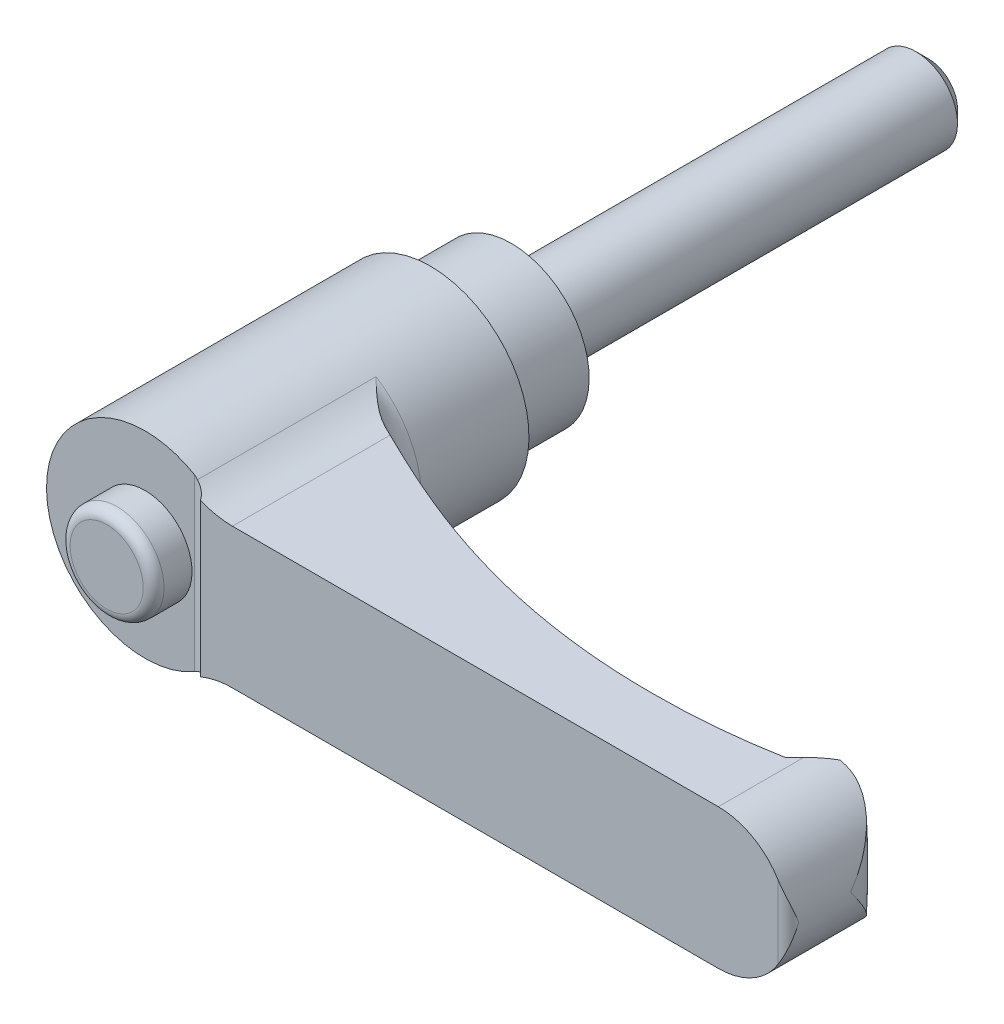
ISO-10303-21;
HEADER;
FILE_DESCRIPTION(('STEP AP214'),'2;1');
FILE_NAME('part.step','',(''),(''),'','','');
FILE_SCHEMA(('AUTOMOTIVE_DESIGN { 1 0 10303 214 1 1 1 1 }'));
ENDSEC;
DATA;
#1=APPLICATION_CONTEXT('core data for automotive mechanical design processes');
#2=APPLICATION_PROTOCOL_DEFINITION('international standard','automotive_design',2000,#1);
#3=PRODUCT_CONTEXT('',#1,'mechanical');
#4=PRODUCT('Part','Part','',(#3));
#5=PRODUCT_RELATED_PRODUCT_CATEGORY('part','',(#4));
#6=PRODUCT_DEFINITION_FORMATION('','',#4);
#7=PRODUCT_DEFINITION_CONTEXT('part definition',#1,'design');
#8=PRODUCT_DEFINITION('design','',#6,#7);
#9=PRODUCT_DEFINITION_SHAPE('','',#8);
#10=(LENGTH_UNIT() NAMED_UNIT(*) SI_UNIT(.MILLI.,.METRE.));
#11=(NAMED_UNIT(*) PLANE_ANGLE_UNIT() SI_UNIT($,.RADIAN.));
#12=(NAMED_UNIT(*) SI_UNIT($,.STERADIAN.) SOLID_ANGLE_UNIT());
#13=UNCERTAINTY_MEASURE_WITH_UNIT(LENGTH_MEASURE(1.E-05),#10,'distance_accuracy_value','');
#14=(GEOMETRIC_REPRESENTATION_CONTEXT(3) GLOBAL_UNCERTAINTY_ASSIGNED_CONTEXT((#13)) GLOBAL_UNIT_ASSIGNED_CONTEXT((#10,
#11,#12)) REPRESENTATION_CONTEXT('',''));
#15=CARTESIAN_POINT('',(0.,0.,0.));
#16=DIRECTION('',(0.,0.,1.));
#17=DIRECTION('',(1.,0.,0.));
#18=AXIS2_PLACEMENT_3D('',#15,#16,#17);
#19=CARTESIAN_POINT('',(6.,0.,0.));
#20=DIRECTION('',(0.,0.,1.));
#21=DIRECTION('',(0.,-1.,0.));
#22=AXIS2_PLACEMENT_3D('',#19,#20,#21);
#23=PLANE('',#22);
#24=CARTESIAN_POINT('',(0.,0.,0.));
#25=DIRECTION('',(0.,0.,-1.));
#26=DIRECTION('',(0.,1.,0.));
#27=AXIS2_PLACEMENT_3D('',#24,#25,#26);
#28=CIRCLE('',#27,4.);
#29=CARTESIAN_POINT('',(0.,4.,0.));
#30=VERTEX_POINT('',#29);
#31=EDGE_CURVE('E423',#30,#30,#28,.T.);
#32=ORIENTED_EDGE('',*,*,#31,.F.);
#33=EDGE_LOOP('',(#32));
#34=FACE_BOUND('',#33,.T.);
#35=CARTESIAN_POINT('',(0.,0.,0.));
#36=DIRECTION('',(0.,0.,-1.));
#37=DIRECTION('',(0.,1.,0.));
#38=AXIS2_PLACEMENT_3D('',#35,#36,#37);
#39=CIRCLE('',#38,6.);
#40=CARTESIAN_POINT('',(0.,6.,0.));
#41=VERTEX_POINT('',#40);
#42=EDGE_CURVE('E347',#41,#41,#39,.T.);
#43=ORIENTED_EDGE('',*,*,#42,.T.);
#44=EDGE_LOOP('',(#43));
#45=FACE_BOUND('',#44,.T.);
#46=ADVANCED_FACE('F14',(#34,#45),#23,.F.);
#47=CARTESIAN_POINT('',(0.,0.,35.5));
#48=DIRECTION('',(0.,0.,-1.));
#49=DIRECTION('',(0.,1.,0.));
#50=AXIS2_PLACEMENT_3D('',#47,#48,#49);
#51=PLANE('',#50);
#52=CARTESIAN_POINT('',(0.,0.,35.5));
#53=DIRECTION('',(0.,0.,-1.));
#54=DIRECTION('',(0.,1.,0.));
#55=AXIS2_PLACEMENT_3D('',#52,#53,#54);
#56=CIRCLE('',#55,9.5);
#57=CARTESIAN_POINT('',(4.75,-8.22724133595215,35.5));
#58=VERTEX_POINT('',#57);
#59=CARTESIAN_POINT('',(4.75,8.22724133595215,35.5));
#60=VERTEX_POINT('',#59);
#61=EDGE_CURVE('E332',#58,#60,#56,.T.);
#62=ORIENTED_EDGE('',*,*,#61,.F.);
#63=DIRECTION('',(0.,1.,0.));
#64=VECTOR('',#63,1.);
#65=CARTESIAN_POINT('',(4.75,-13.5,35.5));
#66=LINE('',#65,#64);
#67=EDGE_CURVE('E383',#58,#60,#66,.T.);
#68=ORIENTED_EDGE('',*,*,#67,.T.);
#69=EDGE_LOOP('',(#62,#68));
#70=FACE_BOUND('',#69,.T.);
#71=CARTESIAN_POINT('',(0.,0.,35.5));
#72=DIRECTION('',(0.,0.,-1.));
#73=DIRECTION('',(0.,1.,0.));
#74=AXIS2_PLACEMENT_3D('',#71,#72,#73);
#75=CIRCLE('',#74,4.52380952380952);
#76=CARTESIAN_POINT('',(0.,4.52380952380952,35.5));
#77=VERTEX_POINT('',#76);
#78=EDGE_CURVE('E183',#77,#77,#75,.F.);
#79=ORIENTED_EDGE('',*,*,#78,.F.);
#80=EDGE_LOOP('',(#79));
#81=FACE_BOUND('',#80,.T.);
#82=ADVANCED_FACE('F158',(#70,#81),#51,.F.);
#83=CARTESIAN_POINT('',(56.25,0.,0.));
#84=DIRECTION('',(0.,0.,1.));
#85=DIRECTION('',(0.,-1.,0.));
#86=AXIS2_PLACEMENT_3D('',#83,#84,#85);
#87=CYLINDRICAL_SURFACE('',#86,6.75);
#88=CARTESIAN_POINT('',(63.,0.,30.5));
#89=CARTESIAN_POINT('',(63.0000000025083,-0.0046874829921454,30.4965903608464));
#90=CARTESIAN_POINT('',(62.9999951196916,-0.0093750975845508,30.4931806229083));
#91=CARTESIAN_POINT('',(62.9990237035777,-0.475524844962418,30.1541065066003));
#92=CARTESIAN_POINT('',(62.9507141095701,-0.938185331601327,29.8175642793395));
#93=CARTESIAN_POINT('',(62.8060463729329,-1.62346497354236,29.3225480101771));
#94=CARTESIAN_POINT('',(62.7456147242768,-1.85084323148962,29.1588881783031));
#95=CARTESIAN_POINT('',(62.6000044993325,-2.30127271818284,28.8365968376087));
#96=CARTESIAN_POINT('',(62.5148384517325,-2.52432607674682,28.6779628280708));
#97=CARTESIAN_POINT('',(62.344804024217,-2.90644000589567,28.4087021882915));
#98=CARTESIAN_POINT('',(62.2657268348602,-3.06692788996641,28.2964051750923));
#99=CARTESIAN_POINT('',(62.0934111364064,-3.38371909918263,28.0768184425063));
#100=CARTESIAN_POINT('',(62.0001726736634,-3.5400224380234,27.9695287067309));
#101=CARTESIAN_POINT('',(61.7993668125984,-3.84715615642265,27.7614384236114));
#102=CARTESIAN_POINT('',(61.6918275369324,-3.99799655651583,27.6606257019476));
#103=CARTESIAN_POINT('',(61.4620426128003,-4.29326696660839,27.4668757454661));
#104=CARTESIAN_POINT('',(61.3398014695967,-4.43769892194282,27.3739361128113));
#105=CARTESIAN_POINT('',(61.0188552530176,-4.78536684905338,27.1560724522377));
#106=CARTESIAN_POINT('',(60.8112818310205,-4.9842025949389,27.0367418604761));
#107=CARTESIAN_POINT('',(60.4758984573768,-5.26551240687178,26.8795376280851));
#108=CARTESIAN_POINT('',(60.3601030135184,-5.35645651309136,26.8307690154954));
#109=CARTESIAN_POINT('',(60.1206554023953,-5.53195453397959,26.7416778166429));
#110=CARTESIAN_POINT('',(59.997005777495,-5.61651049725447,26.7013525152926));
#111=CARTESIAN_POINT('',(59.7699445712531,-5.76076929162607,26.6381973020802));
#112=CARTESIAN_POINT('',(59.667954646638,-5.82188686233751,26.6134697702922));
#113=CARTESIAN_POINT('',(59.4598154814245,-5.93917869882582,26.5707512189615));
#114=CARTESIAN_POINT('',(59.3536672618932,-5.99535416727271,26.5527585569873));
#115=CARTESIAN_POINT('',(59.1377410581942,-6.10229132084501,26.5242546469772));
#116=CARTESIAN_POINT('',(59.0279645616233,-6.15305518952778,26.5137403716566));
#117=CARTESIAN_POINT('',(58.8054681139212,-6.24873887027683,26.5009304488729));
#118=CARTESIAN_POINT('',(58.6927495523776,-6.29366138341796,26.4986309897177));
#119=CARTESIAN_POINT('',(58.4641163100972,-6.37770798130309,26.502966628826));
#120=CARTESIAN_POINT('',(58.3481815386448,-6.41677354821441,26.5096859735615));
#121=CARTESIAN_POINT('',(58.1152313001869,-6.48831686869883,26.5328398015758));
#122=CARTESIAN_POINT('',(57.9982157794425,-6.52079429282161,26.5492747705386));
#123=CARTESIAN_POINT('',(57.7644328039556,-6.57901960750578,26.5923251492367));
#124=CARTESIAN_POINT('',(57.6476652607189,-6.60477054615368,26.618935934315));
#125=CARTESIAN_POINT('',(57.41573023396,-6.64962508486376,26.6826067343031));
#126=CARTESIAN_POINT('',(57.3005622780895,-6.66873068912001,26.7196635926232));
#127=CARTESIAN_POINT('',(57.104290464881,-6.69624244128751,26.7926929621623));
#128=CARTESIAN_POINT('',(57.0224673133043,-6.70614558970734,26.8262017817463));
#129=CARTESIAN_POINT('',(56.8609556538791,-6.72278366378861,26.8986767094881));
#130=CARTESIAN_POINT('',(56.781266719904,-6.72951922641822,26.9376417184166));
#131=CARTESIAN_POINT('',(56.624433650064,-6.74006528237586,27.0209540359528));
#132=CARTESIAN_POINT('',(56.5472927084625,-6.74387222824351,27.0653077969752));
#133=CARTESIAN_POINT('',(56.3961054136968,-6.74884425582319,27.1591719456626));
#134=CARTESIAN_POINT('',(56.3220596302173,-6.75000885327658,27.2086832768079));
#135=CARTESIAN_POINT('',(56.2498,-6.74999999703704,27.2606710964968));
#136=B_SPLINE_CURVE_WITH_KNOTS('',3,(#88,#89,#90,#91,#92,#93,#94,#95,#96,#97,#98,#99,#100,#101,
#102,#103,#104,#105,#106,#107,#108,#109,#110,#111,#112,#113,#114,#115,#116,#117,#118,#119,#120,
#121,#122,#123,#124,#125,#126,#127,#128,#129,#130,#131,#132,#133,#134,#135),.UNSPECIFIED.,.F.,
.F.,(4,2,2,2,2,2,2,2,2,2,2,2,2,2,2,2,2,2,2,2,2,2,2,4),(0.,0.0173896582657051,1.7292315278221,
2.5882674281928,3.44686895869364,4.08007105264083,4.71327107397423,5.34524382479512,
5.97702340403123,6.9068284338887,7.37170994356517,7.83644173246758,8.20045511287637,
8.56437966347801,8.92815681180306,9.29176514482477,9.65879376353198,10.0258407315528,
10.3927210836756,10.7594906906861,11.0261722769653,11.2928002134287,11.5597506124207,
11.8267499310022),.UNSPECIFIED.);
#137=CARTESIAN_POINT('',(58.6622222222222,-6.30425919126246,26.5));
#138=VERTEX_POINT('',#137);
#139=CARTESIAN_POINT('',(63.,0.,30.5));
#140=VERTEX_POINT('',#139);
#141=EDGE_CURVE('E126',#138,#140,#136,.F.);
#142=ORIENTED_EDGE('',*,*,#141,.T.);
#143=CARTESIAN_POINT('',(63.,0.,30.5));
#144=CARTESIAN_POINT('',(63.0000000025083,0.00468748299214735,30.4965903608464));
#145=CARTESIAN_POINT('',(62.9999951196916,0.00937509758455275,30.4931806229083));
#146=CARTESIAN_POINT('',(62.9990237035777,0.47552484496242,30.1541065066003));
#147=CARTESIAN_POINT('',(62.9507141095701,0.938185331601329,29.8175642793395));
#148=CARTESIAN_POINT('',(62.8060463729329,1.62346497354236,29.3225480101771));
#149=CARTESIAN_POINT('',(62.7456147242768,1.85084323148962,29.1588881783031));
#150=CARTESIAN_POINT('',(62.6000044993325,2.30127271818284,28.8365968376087));
#151=CARTESIAN_POINT('',(62.5148384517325,2.52432607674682,28.6779628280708));
#152=CARTESIAN_POINT('',(62.344804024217,2.90644000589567,28.4087021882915));
#153=CARTESIAN_POINT('',(62.2657268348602,3.06692788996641,28.2964051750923));
#154=CARTESIAN_POINT('',(62.0934111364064,3.38371909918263,28.0768184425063));
#155=CARTESIAN_POINT('',(62.0001726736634,3.5400224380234,27.9695287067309));
#156=CARTESIAN_POINT('',(61.7993668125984,3.84715615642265,27.7614384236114));
#157=CARTESIAN_POINT('',(61.6918275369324,3.99799655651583,27.6606257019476));
#158=CARTESIAN_POINT('',(61.4620426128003,4.29326696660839,27.4668757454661));
#159=CARTESIAN_POINT('',(61.3398014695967,4.43769892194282,27.3739361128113));
#160=CARTESIAN_POINT('',(61.0188552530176,4.78536684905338,27.1560724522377));
#161=CARTESIAN_POINT('',(60.8112818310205,4.9842025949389,27.0367418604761));
#162=CARTESIAN_POINT('',(60.4758984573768,5.26551240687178,26.8795376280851));
#163=CARTESIAN_POINT('',(60.3601030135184,5.35645651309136,26.8307690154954));
#164=CARTESIAN_POINT('',(60.1206554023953,5.53195453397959,26.7416778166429));
#165=CARTESIAN_POINT('',(59.997005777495,5.61651049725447,26.7013525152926));
#166=CARTESIAN_POINT('',(59.7699445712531,5.76076929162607,26.6381973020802));
#167=CARTESIAN_POINT('',(59.667954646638,5.82188686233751,26.6134697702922));
#168=CARTESIAN_POINT('',(59.4598154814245,5.93917869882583,26.5707512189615));
#169=CARTESIAN_POINT('',(59.3536672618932,5.99535416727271,26.5527585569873));
#170=CARTESIAN_POINT('',(59.1377410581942,6.10229132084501,26.5242546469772));
#171=CARTESIAN_POINT('',(59.0279645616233,6.15305518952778,26.5137403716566));
#172=CARTESIAN_POINT('',(58.8054681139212,6.24873887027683,26.5009304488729));
#173=CARTESIAN_POINT('',(58.6927495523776,6.29366138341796,26.4986309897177));
#174=CARTESIAN_POINT('',(58.4641163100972,6.37770798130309,26.502966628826));
#175=CARTESIAN_POINT('',(58.3481815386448,6.41677354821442,26.5096859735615));
#176=CARTESIAN_POINT('',(58.1152313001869,6.48831686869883,26.5328398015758));
#177=CARTESIAN_POINT('',(57.9982157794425,6.52079429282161,26.5492747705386));
#178=CARTESIAN_POINT('',(57.7644328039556,6.57901960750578,26.5923251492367));
#179=CARTESIAN_POINT('',(57.6476652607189,6.60477054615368,26.618935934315));
#180=CARTESIAN_POINT('',(57.41573023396,6.64962508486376,26.6826067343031));
#181=CARTESIAN_POINT('',(57.3005622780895,6.66873068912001,26.7196635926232));
#182=CARTESIAN_POINT('',(57.1042904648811,6.69624244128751,26.7926929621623));
#183=CARTESIAN_POINT('',(57.0224673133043,6.70614558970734,26.8262017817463));
#184=CARTESIAN_POINT('',(56.8609556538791,6.72278366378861,26.8986767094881));
#185=CARTESIAN_POINT('',(56.781266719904,6.72951922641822,26.9376417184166));
#186=CARTESIAN_POINT('',(56.624433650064,6.74006528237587,27.0209540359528));
#187=CARTESIAN_POINT('',(56.5472927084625,6.74387222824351,27.0653077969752));
#188=CARTESIAN_POINT('',(56.3961054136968,6.74884425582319,27.1591719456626));
#189=CARTESIAN_POINT('',(56.3220596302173,6.75000885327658,27.2086832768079));
#190=CARTESIAN_POINT('',(56.2498,6.74999999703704,27.2606710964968));
#191=B_SPLINE_CURVE_WITH_KNOTS('',3,(#143,#144,#145,#146,#147,#148,#149,#150,#151,#152,#153,
#154,#155,#156,#157,#158,#159,#160,#161,#162,#163,#164,#165,#166,#167,#168,#169,#170,#171,#172,
#173,#174,#175,#176,#177,#178,#179,#180,#181,#182,#183,#184,#185,#186,#187,#188,#189,#190),
.UNSPECIFIED.,.F.,.F.,(4,2,2,2,2,2,2,2,2,2,2,2,2,2,2,2,2,2,2,2,2,2,2,4),(0.,0.0173896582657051,
1.7292315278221,2.5882674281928,3.44686895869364,4.08007105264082,4.71327107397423,
5.34524382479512,5.97702340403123,6.9068284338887,7.37170994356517,7.83644173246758,
8.20045511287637,8.56437966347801,8.92815681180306,9.29176514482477,9.65879376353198,
10.0258407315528,10.3927210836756,10.7594906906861,11.0261722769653,11.2928002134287,
11.5597506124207,11.8267499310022),.UNSPECIFIED.);
#192=CARTESIAN_POINT('',(58.6622222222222,6.30425919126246,26.5));
#193=VERTEX_POINT('',#192);
#194=EDGE_CURVE('E123',#140,#193,#191,.T.);
#195=ORIENTED_EDGE('',*,*,#194,.T.);
#196=CARTESIAN_POINT('',(56.25,0.,26.5));
#197=DIRECTION('',(0.,0.,-1.));
#198=DIRECTION('',(0.,1.,0.));
#199=AXIS2_PLACEMENT_3D('',#196,#197,#198);
#200=CIRCLE('',#199,6.75);
#201=CARTESIAN_POINT('',(58.,6.51920240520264,26.5));
#202=VERTEX_POINT('',#201);
#203=EDGE_CURVE('E308',#193,#202,#200,.F.);
#204=ORIENTED_EDGE('',*,*,#203,.T.);
#205=CARTESIAN_POINT('',(56.25,0.,28.25));
#206=DIRECTION('',(-0.707106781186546,0.,-0.70710678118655));
#207=DIRECTION('',(-0.70710678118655,0.,0.707106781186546));
#208=AXIS2_PLACEMENT_3D('',#205,#206,#207);
#209=ELLIPSE('',#208,9.54594154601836,6.75);
#210=CARTESIAN_POINT('',(56.25,6.75,28.25));
#211=VERTEX_POINT('',#210);
#212=EDGE_CURVE('E374',#202,#211,#209,.F.);
#213=ORIENTED_EDGE('',*,*,#212,.T.);
#214=DIRECTION('',(0.,0.,1.));
#215=VECTOR('',#214,1.);
#216=CARTESIAN_POINT('',(56.25,6.75,0.));
#217=LINE('',#216,#215);
#218=CARTESIAN_POINT('',(56.25,6.75,36.5));
#219=VERTEX_POINT('',#218);
#220=EDGE_CURVE('E330',#211,#219,#217,.T.);
#221=ORIENTED_EDGE('',*,*,#220,.T.);
#222=CARTESIAN_POINT('',(56.25,0.,36.5));
#223=DIRECTION('',(0.,0.,1.));
#224=DIRECTION('',(0.,-1.,0.));
#225=AXIS2_PLACEMENT_3D('',#222,#223,#224);
#226=CIRCLE('',#225,6.75);
#227=CARTESIAN_POINT('',(62.,3.53553390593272,36.5));
#228=VERTEX_POINT('',#227);
#229=EDGE_CURVE('E322',#228,#219,#226,.T.);
#230=ORIENTED_EDGE('',*,*,#229,.F.);
#231=CARTESIAN_POINT('',(62.,3.53553390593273,36.5));
#232=CARTESIAN_POINT('',(62.0299932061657,3.48675666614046,36.4999933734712));
#233=CARTESIAN_POINT('',(62.0593538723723,3.43761273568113,36.4986515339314));
#234=CARTESIAN_POINT('',(62.1167538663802,3.33870692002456,36.4935798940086));
#235=CARTESIAN_POINT('',(62.1447937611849,3.28894531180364,36.489851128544));
#236=CARTESIAN_POINT('',(62.2267562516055,3.13908056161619,36.4755285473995));
#237=CARTESIAN_POINT('',(62.2786643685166,3.03816514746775,36.4617957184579));
#238=CARTESIAN_POINT('',(62.3766467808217,2.83536966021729,36.4277987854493));
#239=CARTESIAN_POINT('',(62.4227515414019,2.73349792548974,36.4075709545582));
#240=CARTESIAN_POINT('',(62.509502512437,2.52854152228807,36.3618646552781));
#241=CARTESIAN_POINT('',(62.550144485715,2.42545597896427,36.3363821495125));
#242=CARTESIAN_POINT('',(62.6493297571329,2.15471359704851,36.2642737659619));
#243=CARTESIAN_POINT('',(62.7035065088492,1.98634279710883,36.2142841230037));
#244=CARTESIAN_POINT('',(62.7980553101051,1.64812969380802,36.1068184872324));
#245=CARTESIAN_POINT('',(62.8384218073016,1.4782868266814,36.0493394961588));
#246=CARTESIAN_POINT('',(62.9057483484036,1.1374266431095,35.9293690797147));
#247=CARTESIAN_POINT('',(62.9326868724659,0.966407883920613,35.8668697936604));
#248=CARTESIAN_POINT('',(62.9733111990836,0.623942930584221,35.7390768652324));
#249=CARTESIAN_POINT('',(62.9870036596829,0.452496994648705,35.6737846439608));
#250=CARTESIAN_POINT('',(62.997837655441,0.192449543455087,35.5740662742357));
#251=CARTESIAN_POINT('',(62.999781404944,0.103891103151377,35.539987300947));
#252=CARTESIAN_POINT('',(62.9999941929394,0.0102233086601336,35.5039349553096));
#253=CARTESIAN_POINT('',(62.9999999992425,0.00511164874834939,35.5019674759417));
#254=CARTESIAN_POINT('',(63.,0.,35.5));
#255=B_SPLINE_CURVE_WITH_KNOTS('',3,(#231,#232,#233,#234,#235,#236,#237,#238,#239,#240,#241,
#242,#243,#244,#245,#246,#247,#248,#249,#250,#251,#252,#253,#254),.UNSPECIFIED.,.F.,.F.,(4,2,2,
2,2,2,2,2,2,2,2,4),(0.,0.171732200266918,0.343389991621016,0.685890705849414,1.02651095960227,
1.36739390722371,1.91796289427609,2.46875297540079,3.02042294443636,3.57181547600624,
3.85648313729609,3.87291482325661),.UNSPECIFIED.);
#256=CARTESIAN_POINT('',(63.,0.,35.5));
#257=VERTEX_POINT('',#256);
#258=EDGE_CURVE('E169',#257,#228,#255,.F.);
#259=ORIENTED_EDGE('',*,*,#258,.F.);
#260=CARTESIAN_POINT('',(62.,-3.53553390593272,36.5));
#261=CARTESIAN_POINT('',(62.0299932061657,-3.48675666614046,36.4999933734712));
#262=CARTESIAN_POINT('',(62.0593538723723,-3.43761273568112,36.4986515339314));
#263=CARTESIAN_POINT('',(62.1167538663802,-3.33870692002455,36.4935798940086));
#264=CARTESIAN_POINT('',(62.1447937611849,-3.28894531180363,36.489851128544));
#265=CARTESIAN_POINT('',(62.2267562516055,-3.13908056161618,36.4755285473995));
#266=CARTESIAN_POINT('',(62.2786643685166,-3.03816514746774,36.4617957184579));
#267=CARTESIAN_POINT('',(62.3766467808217,-2.83536966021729,36.4277987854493));
#268=CARTESIAN_POINT('',(62.4227515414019,-2.73349792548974,36.4075709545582));
#269=CARTESIAN_POINT('',(62.509502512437,-2.52854152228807,36.3618646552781));
#270=CARTESIAN_POINT('',(62.550144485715,-2.42545597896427,36.3363821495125));
#271=CARTESIAN_POINT('',(62.6493297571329,-2.15471359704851,36.2642737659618));
#272=CARTESIAN_POINT('',(62.7035065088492,-1.98634279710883,36.2142841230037));
#273=CARTESIAN_POINT('',(62.7980553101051,-1.64812969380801,36.1068184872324));
#274=CARTESIAN_POINT('',(62.8384218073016,-1.4782868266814,36.0493394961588));
#275=CARTESIAN_POINT('',(62.9057483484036,-1.1374266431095,35.9293690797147));
#276=CARTESIAN_POINT('',(62.9326868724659,-0.966407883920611,35.8668697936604));
#277=CARTESIAN_POINT('',(62.9733111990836,-0.623942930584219,35.7390768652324));
#278=CARTESIAN_POINT('',(62.9870036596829,-0.452496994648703,35.6737846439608));
#279=CARTESIAN_POINT('',(62.997837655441,-0.192449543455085,35.5740662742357));
#280=CARTESIAN_POINT('',(62.999781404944,-0.103891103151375,35.539987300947));
#281=CARTESIAN_POINT('',(62.9999941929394,-0.0102233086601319,35.5039349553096));
#282=CARTESIAN_POINT('',(62.9999999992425,-0.00511164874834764,35.5019674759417));
#283=CARTESIAN_POINT('',(63.,0.,35.5));
#284=B_SPLINE_CURVE_WITH_KNOTS('',3,(#260,#261,#262,#263,#264,#265,#266,#267,#268,#269,#270,
#271,#272,#273,#274,#275,#276,#277,#278,#279,#280,#281,#282,#283),.UNSPECIFIED.,.F.,.F.,(4,2,2,
2,2,2,2,2,2,2,2,4),(0.,0.171732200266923,0.34338999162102,0.685890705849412,1.02651095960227,
1.36739390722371,1.91796289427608,2.46875297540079,3.02042294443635,3.57181547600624,
3.85648313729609,3.8729148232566),.UNSPECIFIED.);
#285=CARTESIAN_POINT('',(62.,-3.53553390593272,36.5));
#286=VERTEX_POINT('',#285);
#287=EDGE_CURVE('E177',#286,#257,#284,.T.);
#288=ORIENTED_EDGE('',*,*,#287,.F.);
#289=CARTESIAN_POINT('',(56.25,-6.75,36.5));
#290=VERTEX_POINT('',#289);
#291=EDGE_CURVE('E310',#290,#286,#226,.T.);
#292=ORIENTED_EDGE('',*,*,#291,.F.);
#293=DIRECTION('',(0.,0.,1.));
#294=VECTOR('',#293,1.);
#295=CARTESIAN_POINT('',(56.25,-6.75,0.));
#296=LINE('',#295,#294);
#297=CARTESIAN_POINT('',(56.25,-6.75,28.25));
#298=VERTEX_POINT('',#297);
#299=EDGE_CURVE('E355',#298,#290,#296,.T.);
#300=ORIENTED_EDGE('',*,*,#299,.F.);
#301=CARTESIAN_POINT('',(58.,-6.51920240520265,26.5));
#302=VERTEX_POINT('',#301);
#303=EDGE_CURVE('E375',#298,#302,#209,.F.);
#304=ORIENTED_EDGE('',*,*,#303,.T.);
#305=EDGE_CURVE('E134',#302,#138,#200,.F.);
#306=ORIENTED_EDGE('',*,*,#305,.T.);
#307=EDGE_LOOP('',(#142,#195,#204,#213,#221,#230,#259,#288,#292,#300,#304,#306));
#308=FACE_BOUND('',#307,.T.);
#309=ADVANCED_FACE('F132',(#308),#87,.T.);
#310=CARTESIAN_POINT('',(59.,-13.5,26.5));
#311=DIRECTION('',(0.,0.,-1.));
#312=DIRECTION('',(0.,1.,0.));
#313=AXIS2_PLACEMENT_3D('',#310,#311,#312);
#314=PLANE('',#313);
#315=ORIENTED_EDGE('',*,*,#203,.F.);
#316=CARTESIAN_POINT('',(0.,0.,26.5));
#317=DIRECTION('',(0.,0.,-1.));
#318=DIRECTION('',(0.,1.,0.));
#319=AXIS2_PLACEMENT_3D('',#316,#317,#318);
#320=CIRCLE('',#319,59.);
#321=EDGE_CURVE('E37',#193,#138,#320,.T.);
#322=ORIENTED_EDGE('',*,*,#321,.T.);
#323=ORIENTED_EDGE('',*,*,#305,.F.);
#324=DIRECTION('',(0.,1.,0.));
#325=VECTOR('',#324,1.);
#326=CARTESIAN_POINT('',(58.,-13.5,26.5));
#327=LINE('',#326,#325);
#328=EDGE_CURVE('E327',#302,#202,#327,.T.);
#329=ORIENTED_EDGE('',*,*,#328,.T.);
#330=EDGE_LOOP('',(#315,#322,#323,#329));
#331=FACE_BOUND('',#330,.T.);
#332=ADVANCED_FACE('F157',(#331),#314,.T.);
#333=CARTESIAN_POINT('',(0.,0.,36.5));
#334=DIRECTION('',(0.,0.,1.));
#335=DIRECTION('',(0.,-1.,0.));
#336=AXIS2_PLACEMENT_3D('',#333,#334,#335);
#337=PLANE('',#336);
#338=CARTESIAN_POINT('',(9.41740410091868,14.75,36.5));
#339=DIRECTION('',(0.,0.,1.));
#340=DIRECTION('',(1.,0.,0.));
#341=AXIS2_PLACEMENT_3D('',#338,#339,#340);
#342=CIRCLE('',#341,8.);
#343=CARTESIAN_POINT('',(6.33333333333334,7.36836688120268,36.5));
#344=VERTEX_POINT('',#343);
#345=CARTESIAN_POINT('',(9.41740410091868,6.75,36.5));
#346=VERTEX_POINT('',#345);
#347=EDGE_CURVE('E369',#344,#346,#342,.T.);
#348=ORIENTED_EDGE('',*,*,#347,.F.);
#349=DIRECTION('',(0.,1.,0.));
#350=VECTOR('',#349,1.);
#351=CARTESIAN_POINT('',(6.33333333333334,-13.5,36.5));
#352=LINE('',#351,#350);
#353=CARTESIAN_POINT('',(6.33333333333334,-7.36836688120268,36.5));
#354=VERTEX_POINT('',#353);
#355=EDGE_CURVE('E326',#354,#344,#352,.T.);
#356=ORIENTED_EDGE('',*,*,#355,.F.);
#357=CARTESIAN_POINT('',(9.41740410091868,-14.75,36.5));
#358=DIRECTION('',(0.,0.,1.));
#359=DIRECTION('',(1.,0.,0.));
#360=AXIS2_PLACEMENT_3D('',#357,#358,#359);
#361=CIRCLE('',#360,8.);
#362=CARTESIAN_POINT('',(9.41740410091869,-6.75,36.5));
#363=VERTEX_POINT('',#362);
#364=EDGE_CURVE('E361',#363,#354,#361,.T.);
#365=ORIENTED_EDGE('',*,*,#364,.F.);
#366=DIRECTION('',(-1.,0.,0.));
#367=VECTOR('',#366,1.);
#368=CARTESIAN_POINT('',(56.25,-6.75,36.5));
#369=LINE('',#368,#367);
#370=EDGE_CURVE('E364',#290,#363,#369,.T.);
#371=ORIENTED_EDGE('',*,*,#370,.F.);
#372=ORIENTED_EDGE('',*,*,#291,.T.);
#373=DIRECTION('',(0.,1.,0.));
#374=VECTOR('',#373,1.);
#375=CARTESIAN_POINT('',(62.,-13.5,36.5));
#376=LINE('',#375,#374);
#377=EDGE_CURVE('E315',#286,#228,#376,.T.);
#378=ORIENTED_EDGE('',*,*,#377,.T.);
#379=ORIENTED_EDGE('',*,*,#229,.T.);
#380=DIRECTION('',(1.,0.,0.));
#381=VECTOR('',#380,1.);
#382=CARTESIAN_POINT('',(9.41740410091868,6.75,36.5));
#383=LINE('',#382,#381);
#384=EDGE_CURVE('E367',#346,#219,#383,.T.);
#385=ORIENTED_EDGE('',*,*,#384,.F.);
#386=EDGE_LOOP('',(#348,#356,#365,#371,#372,#378,#379,#385));
#387=FACE_BOUND('',#386,.T.);
#388=ADVANCED_FACE('F240',(#387),#337,.T.);
#389=CARTESIAN_POINT('',(0.,0.,0.));
#390=DIRECTION('',(0.,0.,-1.));
#391=DIRECTION('',(0.,1.,0.));
#392=AXIS2_PLACEMENT_3D('',#389,#390,#391);
#393=CYLINDRICAL_SURFACE('',#392,9.5);
#394=CARTESIAN_POINT('',(0.,0.,18.3481601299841));
#395=DIRECTION('',(0.,0.,-1.));
#396=DIRECTION('',(0.,1.,0.));
#397=AXIS2_PLACEMENT_3D('',#394,#395,#396);
#398=CIRCLE('',#397,9.5);
#399=CARTESIAN_POINT('',(5.11230508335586,8.00714285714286,18.3481601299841));
#400=VERTEX_POINT('',#399);
#401=CARTESIAN_POINT('',(5.11230508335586,-8.00714285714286,18.3481601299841));
#402=VERTEX_POINT('',#401);
#403=EDGE_CURVE('E413',#400,#402,#398,.T.);
#404=ORIENTED_EDGE('',*,*,#403,.T.);
#405=DIRECTION('',(0.,0.,1.));
#406=VECTOR('',#405,1.);
#407=CARTESIAN_POINT('',(5.11230508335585,-8.00714285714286,0.));
#408=LINE('',#407,#406);
#409=CARTESIAN_POINT('',(5.11230508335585,-8.00714285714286,35.5614827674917));
#410=VERTEX_POINT('',#409);
#411=EDGE_CURVE('E359',#402,#410,#408,.T.);
#412=ORIENTED_EDGE('',*,*,#411,.T.);
#413=CARTESIAN_POINT('',(4.75,-8.22724133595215,35.5));
#414=CARTESIAN_POINT('',(4.82354897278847,-8.18479174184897,35.5056127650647));
#415=CARTESIAN_POINT('',(4.89626028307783,-8.1414834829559,35.5152432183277));
#416=CARTESIAN_POINT('',(5.03945202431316,-8.05362753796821,35.5421901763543));
#417=CARTESIAN_POINT('',(5.10993308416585,-8.00908020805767,35.5595044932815));
#418=CARTESIAN_POINT('',(5.24861636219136,-7.91889687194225,35.6016146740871));
#419=CARTESIAN_POINT('',(5.31680005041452,-7.87325555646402,35.6264601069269));
#420=CARTESIAN_POINT('',(5.44990684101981,-7.7817124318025,35.6832973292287));
#421=CARTESIAN_POINT('',(5.51483003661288,-7.7358106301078,35.7152889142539));
#422=CARTESIAN_POINT('',(5.69141984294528,-7.6077148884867,35.8145402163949));
#423=CARTESIAN_POINT('',(5.79903338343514,-7.52579740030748,35.8895684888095));
#424=CARTESIAN_POINT('',(5.99917718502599,-7.36722875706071,36.0610902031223));
#425=CARTESIAN_POINT('',(6.09178179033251,-7.29055280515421,36.157471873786));
#426=CARTESIAN_POINT('',(6.20382113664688,-7.19472379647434,36.3011658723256));
#427=CARTESIAN_POINT('',(6.23139044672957,-7.17084441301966,36.33916914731));
#428=CARTESIAN_POINT('',(6.28417716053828,-7.12462925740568,36.4176957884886));
#429=CARTESIAN_POINT('',(6.30939340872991,-7.1022942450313,36.4582203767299));
#430=CARTESIAN_POINT('',(6.33333333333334,-7.08088192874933,36.5));
#431=B_SPLINE_CURVE_WITH_KNOTS('',3,(#413,#414,#415,#416,#417,#418,#419,#420,#421,#422,#423,
#424,#425,#426,#427,#428,#429,#430),.UNSPECIFIED.,.F.,.F.,(4,2,2,2,2,2,2,2,4),(0.,
0.25516766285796,0.510262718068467,0.767074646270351,1.02387922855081,1.48566336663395,
1.94508518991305,2.10299549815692,2.26098294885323),.UNSPECIFIED.);
#432=EDGE_CURVE('E214',#58,#410,#431,.T.);
#433=ORIENTED_EDGE('',*,*,#432,.F.);
#434=ORIENTED_EDGE('',*,*,#61,.T.);
#435=CARTESIAN_POINT('',(6.33333333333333,7.08088192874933,36.5));
#436=CARTESIAN_POINT('',(6.30193651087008,7.10896982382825,36.4452145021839));
#437=CARTESIAN_POINT('',(6.26833956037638,7.13863883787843,36.3925689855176));
#438=CARTESIAN_POINT('',(6.19723055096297,7.20045324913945,36.2916619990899));
#439=CARTESIAN_POINT('',(6.15972345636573,7.23259549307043,36.243395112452));
#440=CARTESIAN_POINT('',(6.08131079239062,7.2986494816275,36.1513438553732));
#441=CARTESIAN_POINT('',(6.04041526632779,7.33255589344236,36.1075470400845));
#442=CARTESIAN_POINT('',(5.95546899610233,7.40171574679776,36.0242830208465));
#443=CARTESIAN_POINT('',(5.91141716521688,7.4369696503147,35.9848173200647));
#444=CARTESIAN_POINT('',(5.7754647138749,7.54368484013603,35.8733623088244));
#445=CARTESIAN_POINT('',(5.67929205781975,7.61650473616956,35.8077657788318));
#446=CARTESIAN_POINT('',(5.47750803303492,7.76289095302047,35.6942705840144));
#447=CARTESIAN_POINT('',(5.37189158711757,7.83645765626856,35.6463815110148));
#448=CARTESIAN_POINT('',(5.1806466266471,7.96370194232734,35.5790108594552));
#449=CARTESIAN_POINT('',(5.09668204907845,8.01772299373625,35.5554125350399));
#450=CARTESIAN_POINT('',(4.92555498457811,8.12398585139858,35.5192948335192));
#451=CARTESIAN_POINT('',(4.83839896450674,8.17623088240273,35.5067542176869));
#452=CARTESIAN_POINT('',(4.75,8.22724133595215,35.5));
#453=B_SPLINE_CURVE_WITH_KNOTS('',3,(#435,#436,#437,#438,#439,#440,#441,#442,#443,#444,#445,
#446,#447,#448,#449,#450,#451,#452),.UNSPECIFIED.,.F.,.F.,(4,2,2,2,2,2,2,2,4),(0.,
0.207163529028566,0.414067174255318,0.620378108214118,0.826760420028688,1.23705708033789,
1.64757566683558,1.9547198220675,2.26127274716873),.UNSPECIFIED.);
#454=CARTESIAN_POINT('',(5.11230508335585,8.00714285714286,35.5614827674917));
#455=VERTEX_POINT('',#454);
#456=EDGE_CURVE('E228',#455,#60,#453,.T.);
#457=ORIENTED_EDGE('',*,*,#456,.F.);
#458=DIRECTION('',(0.,0.,1.));
#459=VECTOR('',#458,1.);
#460=CARTESIAN_POINT('',(5.11230508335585,8.00714285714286,0.));
#461=LINE('',#460,#459);
#462=EDGE_CURVE('E350',#400,#455,#461,.T.);
#463=ORIENTED_EDGE('',*,*,#462,.F.);
#464=EDGE_LOOP('',(#404,#412,#433,#434,#457,#463));
#465=FACE_BOUND('',#464,.T.);
#466=CARTESIAN_POINT('',(0.,0.,8.));
#467=DIRECTION('',(0.,0.,-1.));
#468=DIRECTION('',(0.,1.,0.));
#469=AXIS2_PLACEMENT_3D('',#466,#467,#468);
#470=CIRCLE('',#469,9.5);
#471=CARTESIAN_POINT('',(0.,9.5,8.));
#472=VERTEX_POINT('',#471);
#473=EDGE_CURVE('E333',#472,#472,#470,.T.);
#474=ORIENTED_EDGE('',*,*,#473,.F.);
#475=EDGE_LOOP('',(#474));
#476=FACE_BOUND('',#475,.T.);
#477=ADVANCED_FACE('F238',(#465,#476),#393,.T.);
#478=CARTESIAN_POINT('',(9.41740410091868,14.75,0.));
#479=DIRECTION('',(0.,0.,1.));
#480=DIRECTION('',(0.,-1.,0.));
#481=AXIS2_PLACEMENT_3D('',#478,#479,#480);
#482=CYLINDRICAL_SURFACE('',#481,8.);
#483=DIRECTION('',(0.,0.,1.));
#484=VECTOR('',#483,1.);
#485=CARTESIAN_POINT('',(9.41740410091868,6.75,0.));
#486=LINE('',#485,#484);
#487=CARTESIAN_POINT('',(9.41740410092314,6.75,21.3021638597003));
#488=VERTEX_POINT('',#487);
#489=EDGE_CURVE('E352',#488,#346,#486,.T.);
#490=ORIENTED_EDGE('',*,*,#489,.F.);
#491=CARTESIAN_POINT('',(9.41760410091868,6.7500000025,21.3022609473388));
#492=CARTESIAN_POINT('',(9.34663199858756,6.74999859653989,21.2678090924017));
#493=CARTESIAN_POINT('',(9.27552780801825,6.75094090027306,21.2336266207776));
#494=CARTESIAN_POINT('',(9.13312349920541,6.75473540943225,21.1659081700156));
#495=CARTESIAN_POINT('',(9.06182355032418,6.75758629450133,21.1323717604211));
#496=CARTESIAN_POINT('',(8.91899698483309,6.7652204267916,21.066004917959));
#497=CARTESIAN_POINT('',(8.84747036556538,6.77000369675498,21.0331744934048));
#498=CARTESIAN_POINT('',(8.704162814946,6.78153362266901,20.9682923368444));
#499=CARTESIAN_POINT('',(8.63238174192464,6.78828163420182,20.9362411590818));
#500=CARTESIAN_POINT('',(8.56050869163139,6.79602424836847,20.9046385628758));
#501=B_SPLINE_CURVE_WITH_KNOTS('',3,(#491,#492,#493,#494,#495,#496,#497,#498,#499,#500),
.UNSPECIFIED.,.F.,.F.,(4,2,2,2,4),(0.,0.236671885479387,0.473180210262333,0.709691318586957,
0.946365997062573),.UNSPECIFIED.);
#502=CARTESIAN_POINT('',(8.56096354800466,6.79597525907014,20.9048385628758));
#503=VERTEX_POINT('',#502);
#504=EDGE_CURVE('E246',#488,#503,#501,.T.);
#505=ORIENTED_EDGE('',*,*,#504,.T.);
#506=CARTESIAN_POINT('',(8.56141843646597,6.79592629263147,20.9050385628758));
#507=CARTESIAN_POINT('',(8.47420918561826,6.80531273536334,20.8666951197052));
#508=CARTESIAN_POINT('',(8.38798367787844,6.81604134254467,20.8265142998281));
#509=CARTESIAN_POINT('',(8.21753113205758,6.84002445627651,20.7428900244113));
#510=CARTESIAN_POINT('',(8.13330325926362,6.85327788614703,20.6994479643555));
#511=CARTESIAN_POINT('',(7.88393651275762,6.89653514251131,20.5650030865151));
#512=CARTESIAN_POINT('',(7.72171249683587,6.9300806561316,20.4697011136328));
#513=CARTESIAN_POINT('',(7.40583761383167,7.00533652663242,20.2709379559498));
#514=CARTESIAN_POINT('',(7.25214096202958,7.0469964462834,20.1675294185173));
#515=CARTESIAN_POINT('',(6.95163567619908,7.13786246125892,19.9540740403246));
#516=CARTESIAN_POINT('',(6.80483124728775,7.18707308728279,19.8440232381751));
#517=CARTESIAN_POINT('',(6.52235248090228,7.29074005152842,19.6227797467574));
#518=CARTESIAN_POINT('',(6.38647079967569,7.34497015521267,19.5117441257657));
#519=CARTESIAN_POINT('',(6.12012077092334,7.45966750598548,19.286442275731));
#520=CARTESIAN_POINT('',(5.98965290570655,7.5201353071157,19.1721757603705));
#521=CARTESIAN_POINT('',(5.73356790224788,7.64719834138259,18.9415280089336));
#522=CARTESIAN_POINT('',(5.60795285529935,7.71379617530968,18.825145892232));
#523=CARTESIAN_POINT('',(5.36116691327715,7.853115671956,18.5913699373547));
#524=CARTESIAN_POINT('',(5.23999538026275,7.92583645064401,18.4739762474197));
#525=CARTESIAN_POINT('',(5.11800178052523,8.00350824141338,18.3537764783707));
#526=CARTESIAN_POINT('',(5.11515285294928,8.00532465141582,18.3509683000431));
#527=CARTESIAN_POINT('',(5.11230508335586,8.00714285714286,18.3481601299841));
#528=B_SPLINE_CURVE_WITH_KNOTS('',3,(#506,#507,#508,#509,#510,#511,#512,#513,#514,#515,#516,
#517,#518,#519,#520,#521,#522,#523,#524,#525,#526,#527),.UNSPECIFIED.,.F.,.F.,(4,2,2,2,2,2,2,2,
2,2,4),(0.,0.287104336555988,0.574086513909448,1.14672714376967,1.7159158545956,
2.28544744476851,2.83621563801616,3.38703279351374,3.93808473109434,4.48905724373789,
4.50223731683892),.UNSPECIFIED.);
#529=EDGE_CURVE('E393',#503,#400,#528,.T.);
#530=ORIENTED_EDGE('',*,*,#529,.T.);
#531=ORIENTED_EDGE('',*,*,#462,.T.);
#532=CARTESIAN_POINT('',(6.33333333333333,7.36836688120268,36.5));
#533=CARTESIAN_POINT('',(6.30572631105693,7.37990157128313,36.4517939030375));
#534=CARTESIAN_POINT('',(6.27620115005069,7.39241872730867,36.4049318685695));
#535=CARTESIAN_POINT('',(6.21369042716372,7.41942165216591,36.3142041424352));
#536=CARTESIAN_POINT('',(6.18070621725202,7.433906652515,36.2703372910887));
#537=CARTESIAN_POINT('',(6.11180020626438,7.46478219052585,36.1860768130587));
#538=CARTESIAN_POINT('',(6.07589356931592,7.48116305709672,36.1456672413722));
#539=CARTESIAN_POINT('',(6.001409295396,7.51586753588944,36.0683091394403));
#540=CARTESIAN_POINT('',(5.96283154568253,7.53419123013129,36.0313607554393));
#541=CARTESIAN_POINT('',(5.84377892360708,7.59200134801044,35.9260570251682));
#542=CARTESIAN_POINT('',(5.75985492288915,7.63438377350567,35.8630866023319));
#543=CARTESIAN_POINT('',(5.58613979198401,7.72639161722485,35.7523382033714));
#544=CARTESIAN_POINT('',(5.49634385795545,7.77602300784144,35.7045728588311));
#545=CARTESIAN_POINT('',(5.35683601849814,7.85689272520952,35.6430239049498));
#546=CARTESIAN_POINT('',(5.30809845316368,7.88582630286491,35.6238148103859));
#547=CARTESIAN_POINT('',(5.21035384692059,7.94529574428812,35.5895762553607));
#548=CARTESIAN_POINT('',(5.1613480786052,7.975826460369,35.5745342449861));
#549=CARTESIAN_POINT('',(5.11230508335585,8.00714285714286,35.5614827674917));
#550=B_SPLINE_CURVE_WITH_KNOTS('',3,(#532,#533,#534,#535,#536,#537,#538,#539,#540,#541,#542,
#543,#544,#545,#546,#547,#548,#549),.UNSPECIFIED.,.F.,.F.,(4,2,2,2,2,2,2,2,4),(0.,
0.170139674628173,0.340213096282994,0.50945430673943,0.678702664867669,1.01657399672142,
1.35472528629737,1.53411415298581,1.7129567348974),.UNSPECIFIED.);
#551=EDGE_CURVE('E222',#344,#455,#550,.T.);
#552=ORIENTED_EDGE('',*,*,#551,.F.);
#553=ORIENTED_EDGE('',*,*,#347,.T.);
#554=EDGE_LOOP('',(#490,#505,#530,#531,#552,#553));
#555=FACE_BOUND('',#554,.T.);
#556=ADVANCED_FACE('F234',(#555),#482,.F.);
#557=CARTESIAN_POINT('',(9.41740410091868,6.75,0.));
#558=DIRECTION('',(0.,-1.,0.));
#559=DIRECTION('',(1.,0.,0.));
#560=AXIS2_PLACEMENT_3D('',#557,#558,#559);
#561=PLANE('',#560);
#562=CARTESIAN_POINT('',(43.8904150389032,6.75,-32.7854085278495));
#563=DIRECTION('',(0.,-1.,0.));
#564=DIRECTION('',(1.,0.,0.));
#565=AXIS2_PLACEMENT_3D('',#562,#563,#564);
#566=CIRCLE('',#565,63.);
#567=CARTESIAN_POINT('',(43.630890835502,6.75000000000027,30.2140569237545));
#568=VERTEX_POINT('',#567);
#569=CARTESIAN_POINT('',(55.3333333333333,6.75,29.1666666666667));
#570=VERTEX_POINT('',#569);
#571=EDGE_CURVE('E376',#568,#570,#566,.F.);
#572=ORIENTED_EDGE('',*,*,#571,.F.);
#573=CARTESIAN_POINT('',(31.7211018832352,6.75,29.163677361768));
#574=CARTESIAN_POINT('',(30.4815814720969,6.75,28.9394124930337));
#575=CARTESIAN_POINT('',(29.248337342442,6.75,28.6800208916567));
#576=CARTESIAN_POINT('',(26.798292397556,6.75,28.093381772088));
#577=CARTESIAN_POINT('',(25.5814894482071,6.75,27.7661431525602));
#578=CARTESIAN_POINT('',(23.7726077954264,6.75,27.2275084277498));
#579=CARTESIAN_POINT('',(23.1732161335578,6.75,27.0403034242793));
#580=CARTESIAN_POINT('',(21.9794838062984,6.75,26.6504397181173));
#581=CARTESIAN_POINT('',(21.3851430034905,6.75,26.4477814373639));
#582=CARTESIAN_POINT('',(20.20172109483,6.75,26.027681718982));
#583=CARTESIAN_POINT('',(19.6126399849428,6.75,25.8102402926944));
#584=CARTESIAN_POINT('',(18.4398233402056,6.75,25.3614109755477));
#585=CARTESIAN_POINT('',(17.8560877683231,6.75,25.1300231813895));
#586=CARTESIAN_POINT('',(16.8264520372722,6.75,24.7086305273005));
#587=CARTESIAN_POINT('',(16.3794839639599,6.75,24.5212256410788));
#588=CARTESIAN_POINT('',(15.4885644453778,6.75,24.1393775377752));
#589=CARTESIAN_POINT('',(15.0446130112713,6.75,23.9449342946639));
#590=CARTESIAN_POINT('',(14.1595159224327,6.75,23.5498036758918));
#591=CARTESIAN_POINT('',(13.7183701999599,6.75,23.3491164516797));
#592=CARTESIAN_POINT('',(12.8384969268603,6.75,22.9425083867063));
#593=CARTESIAN_POINT('',(12.3997694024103,6.75,22.7365874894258));
#594=CARTESIAN_POINT('',(11.5213847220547,6.75,22.3195357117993));
#595=CARTESIAN_POINT('',(11.0817393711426,6.75,22.1083800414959));
#596=CARTESIAN_POINT('',(10.2034650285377,6.75,21.6840048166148));
#597=CARTESIAN_POINT('',(9.76483601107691,6.75,21.4707853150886));
#598=CARTESIAN_POINT('',(8.88741279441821,6.75,21.0449308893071));
#599=CARTESIAN_POINT('',(8.4486186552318,6.75,20.832295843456));
#600=CARTESIAN_POINT('',(7.7888040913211,6.75,20.5166390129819));
#601=CARTESIAN_POINT('',(7.56857842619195,6.75,20.4119614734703));
#602=CARTESIAN_POINT('',(7.12729129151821,6.75,20.2043820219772));
#603=CARTESIAN_POINT('',(6.90622982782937,6.75,20.1014800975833));
#604=CARTESIAN_POINT('',(6.48691851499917,6.75,19.9092503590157));
#605=CARTESIAN_POINT('',(6.28878981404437,6.75,19.8196589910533));
#606=CARTESIAN_POINT('',(5.89131318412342,6.75,19.6432260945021));
#607=CARTESIAN_POINT('',(5.69196528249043,6.75,19.5563845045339));
#608=CARTESIAN_POINT('',(5.29178648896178,6.75,19.3863184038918));
#609=CARTESIAN_POINT('',(5.09095599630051,6.75,19.3030929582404));
#610=CARTESIAN_POINT('',(4.68744730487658,6.75,19.1412674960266));
#611=CARTESIAN_POINT('',(4.48476921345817,6.75,19.0626672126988));
#612=CARTESIAN_POINT('',(4.07928382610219,6.75,18.9120884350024));
#613=CARTESIAN_POINT('',(3.87649877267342,6.75,18.8400507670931));
#614=CARTESIAN_POINT('',(3.46854334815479,6.75,18.7031281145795));
#615=CARTESIAN_POINT('',(3.26337283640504,6.75,18.6382435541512));
#616=CARTESIAN_POINT('',(2.64418711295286,6.75,18.4568464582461));
#617=CARTESIAN_POINT('',(2.22603982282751,6.75,18.3534128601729));
#618=CARTESIAN_POINT('',(1.65420364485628,6.75,18.2467177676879));
#619=CARTESIAN_POINT('',(1.50442360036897,6.75,18.2219398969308));
#620=CARTESIAN_POINT('',(1.20392315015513,6.75,18.1790422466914));
#621=CARTESIAN_POINT('',(1.05320291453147,6.75,18.1609212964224));
#622=CARTESIAN_POINT('',(0.751090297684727,6.75,18.1317837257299));
#623=CARTESIAN_POINT('',(0.599697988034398,6.75,18.1207663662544));
#624=CARTESIAN_POINT('',(0.296553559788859,6.75,18.1061196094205));
#625=CARTESIAN_POINT('',(0.144801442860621,6.75,18.1024901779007));
#626=CARTESIAN_POINT('',(-0.159091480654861,6.75,18.1027184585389));
#627=CARTESIAN_POINT('',(-0.311232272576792,6.75,18.1065956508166));
#628=CARTESIAN_POINT('',(-0.615143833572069,6.75,18.121770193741));
#629=CARTESIAN_POINT('',(-0.766914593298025,6.75,18.1330677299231));
#630=CARTESIAN_POINT('',(-1.06969262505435,6.75,18.1627811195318));
#631=CARTESIAN_POINT('',(-1.220700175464,6.75,18.1811941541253));
#632=CARTESIAN_POINT('',(-1.5217232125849,6.75,18.2246820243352));
#633=CARTESIAN_POINT('',(-1.67173881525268,6.75,18.2497560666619));
#634=CARTESIAN_POINT('',(-2.07224275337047,6.75,18.3251477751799));
#635=CARTESIAN_POINT('',(-2.32169003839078,6.75,18.381037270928));
#636=CARTESIAN_POINT('',(-2.81697540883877,6.75,18.507138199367));
#637=CARTESIAN_POINT('',(-3.06281183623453,6.75,18.5773560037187));
#638=CARTESIAN_POINT('',(-3.55135994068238,6.75,18.7293420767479));
#639=CARTESIAN_POINT('',(-3.79406482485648,6.75,18.8111319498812));
#640=CARTESIAN_POINT('',(-4.27623455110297,6.75,18.9835884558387));
#641=CARTESIAN_POINT('',(-4.51569977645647,6.75,19.0742540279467));
#642=CARTESIAN_POINT('',(-4.99367008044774,6.75,19.2630221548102));
#643=CARTESIAN_POINT('',(-5.23215559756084,6.75,19.3611738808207));
#644=CARTESIAN_POINT('',(-5.70695626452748,6.75,19.5625758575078));
#645=CARTESIAN_POINT('',(-5.94327137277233,6.75,19.6658262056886));
#646=CARTESIAN_POINT('',(-6.41402120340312,6.75,19.8759260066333));
#647=CARTESIAN_POINT('',(-6.64845749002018,6.75,19.9827719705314));
#648=CARTESIAN_POINT('',(-7.11612805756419,6.75,20.199046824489));
#649=CARTESIAN_POINT('',(-7.34936235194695,6.75,20.3084756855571));
#650=CARTESIAN_POINT('',(-7.820481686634,6.75,20.5316181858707));
#651=CARTESIAN_POINT('',(-8.05834758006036,6.75,20.6453721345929));
#652=CARTESIAN_POINT('',(-8.53358360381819,6.75,20.8739082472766));
#653=CARTESIAN_POINT('',(-8.77095373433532,6.75,20.9886904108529));
#654=CARTESIAN_POINT('',(-9.48285175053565,6.75,21.3336726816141));
#655=CARTESIAN_POINT('',(-9.95708901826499,6.75,21.5644709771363));
#656=CARTESIAN_POINT('',(-10.904589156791,6.75,22.0230894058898));
#657=CARTESIAN_POINT('',(-11.3778479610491,6.75,22.2509179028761));
#658=CARTESIAN_POINT('',(-12.3264717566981,6.75,22.702156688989));
#659=CARTESIAN_POINT('',(-12.8018367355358,6.75,22.9255670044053));
#660=CARTESIAN_POINT('',(-13.7472574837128,6.75,23.3624658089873));
#661=CARTESIAN_POINT('',(-14.217264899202,6.75,23.5760586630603));
#662=CARTESIAN_POINT('',(-15.160466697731,6.75,23.9960838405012));
#663=CARTESIAN_POINT('',(-15.6336610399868,6.75,24.2025162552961));
#664=CARTESIAN_POINT('',(-16.5835181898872,6.75,24.6072968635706));
#665=CARTESIAN_POINT('',(-17.0601810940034,6.75,24.8056448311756));
#666=CARTESIAN_POINT('',(-18.0170761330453,6.75,25.1935214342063));
#667=CARTESIAN_POINT('',(-18.4973082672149,6.75,25.3830500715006));
#668=CARTESIAN_POINT('',(-19.9446532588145,6.75,25.9379698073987));
#669=CARTESIAN_POINT('',(-20.9172563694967,6.75,26.2891978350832));
#670=CARTESIAN_POINT('',(-22.8764349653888,6.75,26.9503282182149));
#671=CARTESIAN_POINT('',(-23.8630106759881,6.75,27.2602299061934));
#672=CARTESIAN_POINT('',(-25.8434483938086,6.75,27.8346774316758));
#673=CARTESIAN_POINT('',(-26.8372408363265,6.75,28.0994625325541));
#674=CARTESIAN_POINT('',(-28.8357706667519,6.75,28.5839273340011));
#675=CARTESIAN_POINT('',(-29.8405080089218,6.75,28.8036072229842));
#676=CARTESIAN_POINT('',(-31.8589765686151,6.75,29.1964952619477));
#677=CARTESIAN_POINT('',(-32.8727072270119,6.75,29.3697062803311));
#678=CARTESIAN_POINT('',(-34.9071605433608,6.75,29.6686480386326));
#679=CARTESIAN_POINT('',(-35.9278832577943,6.75,29.7943783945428));
#680=CARTESIAN_POINT('',(-37.9963261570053,6.75,29.9997968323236));
#681=CARTESIAN_POINT('',(-39.0441517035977,6.75,30.0784270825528));
#682=CARTESIAN_POINT('',(-41.14239334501,6.75,30.1847467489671));
#683=CARTESIAN_POINT('',(-42.1928094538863,6.75,30.2124358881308));
#684=CARTESIAN_POINT('',(-44.2938118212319,6.75,30.2165051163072));
#685=CARTESIAN_POINT('',(-45.344398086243,6.75,30.1928819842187));
#686=CARTESIAN_POINT('',(-47.4431477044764,6.75,30.0941408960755));
#687=CARTESIAN_POINT('',(-48.4913110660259,6.75,30.0190231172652));
#688=CARTESIAN_POINT('',(-50.5819392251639,6.75,29.8173590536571));
#689=CARTESIAN_POINT('',(-51.6244075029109,6.75,29.6908488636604));
#690=CARTESIAN_POINT('',(-53.7018393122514,6.75,29.3865594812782));
#691=CARTESIAN_POINT('',(-54.7368028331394,6.75,29.2087802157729));
#692=CARTESIAN_POINT('',(-56.796555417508,6.75,28.8022916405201));
#693=CARTESIAN_POINT('',(-57.8213456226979,6.75,28.5735881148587));
#694=CARTESIAN_POINT('',(-59.8583175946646,6.75,28.0657058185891));
#695=CARTESIAN_POINT('',(-60.8704998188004,6.75,27.7865288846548));
#696=CARTESIAN_POINT('',(-62.7386591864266,6.75,27.2210237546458));
#697=CARTESIAN_POINT('',(-63.596613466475,6.75,26.9412039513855));
#698=CARTESIAN_POINT('',(-65.2998711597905,6.75,26.3451620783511));
#699=CARTESIAN_POINT('',(-66.1451735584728,6.75,26.0289371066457));
#700=CARTESIAN_POINT('',(-67.8213142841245,6.75,25.3607166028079));
#701=CARTESIAN_POINT('',(-68.6521555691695,6.75,25.008728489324));
#702=CARTESIAN_POINT('',(-70.2981029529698,6.75,24.2695044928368));
#703=CARTESIAN_POINT('',(-71.1132075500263,6.75,23.8822652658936));
#704=CARTESIAN_POINT('',(-72.7262028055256,6.75,23.0731962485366));
#705=CARTESIAN_POINT('',(-73.524091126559,6.75,22.6513617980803));
#706=CARTESIAN_POINT('',(-75.1011409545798,6.75,21.7738568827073));
#707=CARTESIAN_POINT('',(-75.880300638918,6.75,21.3181831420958));
#708=CARTESIAN_POINT('',(-77.4183136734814,6.75,20.3738879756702));
#709=CARTESIAN_POINT('',(-78.1771685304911,6.75,19.8852690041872));
#710=CARTESIAN_POINT('',(-79.6732930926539,6.75,18.8758914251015));
#711=CARTESIAN_POINT('',(-80.4105607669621,6.75,18.3551298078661));
#712=CARTESIAN_POINT('',(-81.8513021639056,6.75,17.290405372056));
#713=CARTESIAN_POINT('',(-82.5551151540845,6.75,16.746901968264));
#714=CARTESIAN_POINT('',(-83.9391504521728,6.75,15.6306111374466));
#715=CARTESIAN_POINT('',(-84.6193705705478,6.75,15.0578210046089));
#716=CARTESIAN_POINT('',(-86.6226170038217,6.75,13.2971348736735));
#717=CARTESIAN_POINT('',(-87.9086425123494,6.75,12.0666177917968));
#718=CARTESIAN_POINT('',(-90.3715260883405,6.75,9.50168917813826));
#719=CARTESIAN_POINT('',(-91.5484103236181,6.75,8.16730269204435));
#720=CARTESIAN_POINT('',(-93.7851188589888,6.75,5.40369634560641));
#721=CARTESIAN_POINT('',(-94.8449429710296,6.75,3.97447633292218));
#722=CARTESIAN_POINT('',(-96.8361244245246,6.75,1.03692343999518));
#723=CARTESIAN_POINT('',(-97.767942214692,6.75,-0.471097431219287));
#724=CARTESIAN_POINT('',(-99.5010623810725,6.75,-3.56036164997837));
#725=CARTESIAN_POINT('',(-100.302365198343,6.75,-5.14160475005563));
#726=CARTESIAN_POINT('',(-101.768771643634,6.75,-8.36619229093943));
#727=CARTESIAN_POINT('',(-102.433863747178,6.75,-10.0095419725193));
#728=CARTESIAN_POINT('',(-103.622996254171,6.75,-13.3465069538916));
#729=CARTESIAN_POINT('',(-104.147036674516,6.75,-15.0401222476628));
#730=CARTESIAN_POINT('',(-105.049640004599,6.75,-18.4630084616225));
#731=CARTESIAN_POINT('',(-105.428416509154,6.75,-20.1922230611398));
#732=CARTESIAN_POINT('',(-106.038877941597,6.75,-23.6764228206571));
#733=CARTESIAN_POINT('',(-106.270563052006,6.75,-25.4314079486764));
#734=CARTESIAN_POINT('',(-106.585179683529,6.75,-28.9546005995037));
#735=CARTESIAN_POINT('',(-106.668116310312,6.75,-30.7228076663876));
#736=CARTESIAN_POINT('',(-106.684658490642,6.75,-34.2599203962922));
#737=CARTESIAN_POINT('',(-106.618264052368,6.75,-36.0288260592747));
#738=CARTESIAN_POINT('',(-106.336687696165,6.75,-39.5538875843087));
#739=CARTESIAN_POINT('',(-106.121578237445,6.75,-41.3100492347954));
#740=CARTESIAN_POINT('',(-105.544185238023,6.75,-44.7980086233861));
#741=CARTESIAN_POINT('',(-105.181901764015,6.75,-46.5298063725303));
#742=CARTESIAN_POINT('',(-104.312743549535,6.75,-49.9567519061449));
#743=CARTESIAN_POINT('',(-103.805867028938,6.75,-51.651899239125));
#744=CARTESIAN_POINT('',(-102.651145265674,6.75,-54.9934802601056));
#745=CARTESIAN_POINT('',(-102.003299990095,6.75,-56.6399139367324));
#746=CARTESIAN_POINT('',(-100.571184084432,6.75,-59.8725679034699));
#747=CARTESIAN_POINT('',(-99.7868975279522,6.75,-61.4587811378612));
#748=CARTESIAN_POINT('',(-98.0875527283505,6.75,-64.5595376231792));
#749=CARTESIAN_POINT('',(-97.1724945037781,6.75,-66.0740808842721));
#750=CARTESIAN_POINT('',(-95.2181592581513,6.75,-69.02073707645));
#751=CARTESIAN_POINT('',(-94.1788847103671,6.75,-70.452851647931));
#752=CARTESIAN_POINT('',(-91.9835199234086,6.75,-73.2245536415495));
#753=CARTESIAN_POINT('',(-90.8274296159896,6.75,-74.564141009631));
#754=CARTESIAN_POINT('',(-88.4057386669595,6.75,-77.1423361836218));
#755=CARTESIAN_POINT('',(-87.1400537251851,6.75,-78.380864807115));
#756=CARTESIAN_POINT('',(-84.5089879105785,6.75,-80.7470553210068));
#757=CARTESIAN_POINT('',(-83.1436070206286,6.75,-81.8747171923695));
#758=CARTESIAN_POINT('',(-80.3227939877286,6.75,-84.0113309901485));
#759=CARTESIAN_POINT('',(-78.8673570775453,6.75,-85.0202766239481));
#760=CARTESIAN_POINT('',(-75.8769461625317,6.75,-86.9123338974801));
#761=CARTESIAN_POINT('',(-74.3419720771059,6.75,-87.7954454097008));
#762=CARTESIAN_POINT('',(-71.1998351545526,6.75,-89.431561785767));
#763=CARTESIAN_POINT('',(-69.5925280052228,6.75,-90.1842905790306));
#764=CARTESIAN_POINT('',(-67.1388562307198,6.75,-91.2100668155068));
#765=CARTESIAN_POINT('',(-66.3137332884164,6.75,-91.5348094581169));
#766=CARTESIAN_POINT('',(-64.6506068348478,6.75,-92.1493747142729));
#767=CARTESIAN_POINT('',(-63.8126045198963,6.75,-92.4392005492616));
#768=CARTESIAN_POINT('',(-62.1252437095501,6.75,-92.9834437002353));
#769=CARTESIAN_POINT('',(-61.2758857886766,6.75,-93.2378628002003));
#770=CARTESIAN_POINT('',(-59.5673372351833,6.75,-93.7108951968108));
#771=CARTESIAN_POINT('',(-58.7081475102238,6.75,-93.9295117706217));
#772=CARTESIAN_POINT('',(-56.9813119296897,6.75,-94.330650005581));
#773=CARTESIAN_POINT('',(-56.1136653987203,6.75,-94.5131687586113));
#774=CARTESIAN_POINT('',(-54.371590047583,6.75,-94.8418182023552));
#775=CARTESIAN_POINT('',(-53.4971618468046,6.75,-94.9879521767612));
#776=CARTESIAN_POINT('',(-51.7381452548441,6.75,-95.2443772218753));
#777=CARTESIAN_POINT('',(-50.853527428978,6.75,-95.3544663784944));
#778=CARTESIAN_POINT('',(-49.0805458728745,6.75,-95.5375819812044));
#779=CARTESIAN_POINT('',(-48.192182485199,6.75,-95.6106117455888));
#780=CARTESIAN_POINT('',(-46.4130642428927,6.75,-95.7196121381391));
#781=CARTESIAN_POINT('',(-45.5223090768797,6.75,-95.7555776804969));
#782=CARTESIAN_POINT('',(-43.7401549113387,6.75,-95.7905002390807));
#783=CARTESIAN_POINT('',(-42.8487559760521,6.75,-95.7894605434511));
#784=CARTESIAN_POINT('',(-41.0665202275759,6.75,-95.7505392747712));
#785=CARTESIAN_POINT('',(-40.1756836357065,6.75,-95.7126475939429));
#786=CARTESIAN_POINT('',(-38.3964008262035,6.75,-95.6002786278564));
#787=CARTESIAN_POINT('',(-37.5079544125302,6.75,-95.5258044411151));
#788=CARTESIAN_POINT('',(-35.7349776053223,6.75,-95.3406622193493));
#789=CARTESIAN_POINT('',(-34.8504466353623,6.75,-95.2299997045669));
#790=CARTESIAN_POINT('',(-33.0866559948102,6.75,-94.9729961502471));
#791=CARTESIAN_POINT('',(-32.2073960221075,6.75,-94.8266571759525));
#792=CARTESIAN_POINT('',(-30.2088075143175,6.75,-94.4528004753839));
#793=CARTESIAN_POINT('',(-29.0915678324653,6.75,-94.2140271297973));
#794=CARTESIAN_POINT('',(-26.870729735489,6.75,-93.680789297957));
#795=CARTESIAN_POINT('',(-25.7671289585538,6.75,-93.3863346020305));
#796=CARTESIAN_POINT('',(-23.5794007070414,6.75,-92.7452706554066));
#797=CARTESIAN_POINT('',(-22.4952182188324,6.75,-92.3988492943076));
#798=CARTESIAN_POINT('',(-20.8818413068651,6.75,-91.8421742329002));
#799=CARTESIAN_POINT('',(-20.3461750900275,6.75,-91.6504327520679));
#800=CARTESIAN_POINT('',(-19.2791955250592,6.75,-91.2551758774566));
#801=CARTESIAN_POINT('',(-18.7478821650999,6.75,-91.0516605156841));
#802=CARTESIAN_POINT('',(-17.7341015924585,6.75,-90.6511286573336));
#803=CARTESIAN_POINT('',(-17.2512814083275,6.75,-90.4550030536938));
#804=CARTESIAN_POINT('',(-16.2892277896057,6.75,-90.054140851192));
#805=CARTESIAN_POINT('',(-15.8099943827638,6.75,-89.8494041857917));
#806=CARTESIAN_POINT('',(-14.8549276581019,6.75,-89.4321783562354));
#807=CARTESIAN_POINT('',(-14.3790942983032,6.75,-89.2196892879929));
#808=CARTESIAN_POINT('',(-13.4304626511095,6.75,-88.7880630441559));
#809=CARTESIAN_POINT('',(-12.9576643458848,6.75,-88.5689259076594));
#810=CARTESIAN_POINT('',(-12.0107866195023,6.75,-88.1237287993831));
#811=CARTESIAN_POINT('',(-11.5367265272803,6.75,-87.8976278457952));
#812=CARTESIAN_POINT('',(-10.5901348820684,6.75,-87.4422263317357));
#813=CARTESIAN_POINT('',(-10.1176033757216,6.75,-87.2129256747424));
#814=CARTESIAN_POINT('',(-9.40891081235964,6.75,-86.8688571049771));
#815=CARTESIAN_POINT('',(-9.17271619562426,6.75,-86.754157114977));
#816=CARTESIAN_POINT('',(-8.70009930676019,6.75,-86.525227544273));
#817=CARTESIAN_POINT('',(-8.46367703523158,6.75,-86.4109979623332));
#818=CARTESIAN_POINT('',(-7.99032304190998,6.75,-86.1836245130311));
#819=CARTESIAN_POINT('',(-7.75339134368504,6.75,-86.0704805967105));
#820=CARTESIAN_POINT('',(-7.27865658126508,6.75,-85.8460384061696));
#821=CARTESIAN_POINT('',(-7.04085352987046,6.75,-85.7347401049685));
#822=CARTESIAN_POINT('',(-6.59371126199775,6.75,-85.5286626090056));
#823=CARTESIAN_POINT('',(-6.38452366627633,6.75,-85.4335553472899));
#824=CARTESIAN_POINT('',(-5.96482585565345,6.75,-85.2462863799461));
#825=CARTESIAN_POINT('',(-5.75431562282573,6.75,-85.1541247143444));
#826=CARTESIAN_POINT('',(-5.33149356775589,6.75,-84.9736760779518));
#827=CARTESIAN_POINT('',(-5.11918079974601,6.75,-84.8853913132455));
#828=CARTESIAN_POINT('',(-4.69248281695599,6.75,-84.7139542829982));
#829=CARTESIAN_POINT('',(-4.47809761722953,6.75,-84.6308019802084));
#830=CARTESIAN_POINT('',(-4.04974384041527,6.75,-84.4721558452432));
#831=CARTESIAN_POINT('',(-3.83580783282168,6.75,-84.3965746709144));
#832=CARTESIAN_POINT('',(-3.40521230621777,6.75,-84.2535001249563));
#833=CARTESIAN_POINT('',(-3.18855265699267,6.75,-84.1860071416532));
#834=CARTESIAN_POINT('',(-2.7525433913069,6.75,-84.0610936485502));
#835=CARTESIAN_POINT('',(-2.53319651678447,6.75,-84.0036636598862));
#836=CARTESIAN_POINT('',(-2.09168832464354,6.75,-83.9008827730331));
#837=CARTESIAN_POINT('',(-1.86952759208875,6.75,-83.855529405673));
#838=CARTESIAN_POINT('',(-1.49130549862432,6.75,-83.7906550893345));
#839=CARTESIAN_POINT('',(-1.33586865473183,6.75,-83.7674774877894));
#840=CARTESIAN_POINT('',(-1.02408077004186,6.75,-83.7284590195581));
#841=CARTESIAN_POINT('',(-0.867729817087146,6.75,-83.7126174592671));
#842=CARTESIAN_POINT('',(-0.554462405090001,6.75,-83.6887013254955));
#843=CARTESIAN_POINT('',(-0.39754606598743,6.75,-83.680625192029));
#844=CARTESIAN_POINT('',(-0.0835038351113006,6.75,-83.6724647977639));
#845=CARTESIAN_POINT('',(0.0736220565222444,6.75,-83.6723805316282));
#846=CARTESIAN_POINT('',(0.388412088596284,6.75,-83.6802250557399));
#847=CARTESIAN_POINT('',(0.546075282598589,6.75,-83.6881915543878));
#848=CARTESIAN_POINT('',(0.860809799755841,6.75,-83.7119647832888));
#849=CARTESIAN_POINT('',(1.01788109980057,6.75,-83.7277718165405));
#850=CARTESIAN_POINT('',(1.33107186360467,6.75,-83.7667915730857));
#851=CARTESIAN_POINT('',(1.48719146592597,6.75,-83.7900031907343));
#852=CARTESIAN_POINT('',(1.79822732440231,6.75,-83.8432471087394));
#853=CARTESIAN_POINT('',(1.95314372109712,6.75,-83.8732785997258));
#854=CARTESIAN_POINT('',(2.62162776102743,6.75,-84.0167635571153));
#855=CARTESIAN_POINT('',(3.12861672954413,6.75,-84.1613638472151));
#856=CARTESIAN_POINT('',(3.87795406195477,6.75,-84.4106972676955));
#857=CARTESIAN_POINT('',(4.12616139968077,6.75,-84.4993375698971));
#858=CARTESIAN_POINT('',(4.61946607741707,6.75,-84.6849296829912));
#859=CARTESIAN_POINT('',(4.86456379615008,6.75,-84.781880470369));
#860=CARTESIAN_POINT('',(5.35373795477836,6.75,-84.9826129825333));
#861=CARTESIAN_POINT('',(5.59779784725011,6.75,-85.0864344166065));
#862=CARTESIAN_POINT('',(6.08391986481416,6.75,-85.2986549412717));
#863=CARTESIAN_POINT('',(6.32598194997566,6.75,-85.4070541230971));
#864=CARTESIAN_POINT('',(6.80840591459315,6.75,-85.626981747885));
#865=CARTESIAN_POINT('',(7.04876914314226,6.75,-85.738507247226));
#866=CARTESIAN_POINT('',(7.52847328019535,6.75,-85.9637227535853));
#867=CARTESIAN_POINT('',(7.76781419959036,6.75,-86.0774127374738));
#868=CARTESIAN_POINT('',(8.25058393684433,6.75,-86.3083743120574));
#869=CARTESIAN_POINT('',(8.49400009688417,6.75,-86.4256722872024));
#870=CARTESIAN_POINT('',(8.98050911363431,6.75,-86.6609348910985));
#871=CARTESIAN_POINT('',(9.22360197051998,6.75,-86.7788995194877));
#872=CARTESIAN_POINT('',(9.95291032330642,6.75,-87.1329433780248));
#873=CARTESIAN_POINT('',(10.43907279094,6.75,-87.3691324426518));
#874=CARTESIAN_POINT('',(11.4111644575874,6.75,-87.8375363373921));
#875=CARTESIAN_POINT('',(11.8970882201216,6.75,-88.0697623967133));
#876=CARTESIAN_POINT('',(12.8714835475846,6.75,-88.5288181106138));
#877=CARTESIAN_POINT('',(13.3599550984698,6.75,-88.7556477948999));
#878=CARTESIAN_POINT('',(14.3351346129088,6.75,-89.1999837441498));
#879=CARTESIAN_POINT('',(14.8218099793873,6.75,-89.4175613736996));
#880=CARTESIAN_POINT('',(15.7987012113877,6.75,-89.8446134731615));
#881=CARTESIAN_POINT('',(16.2889170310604,6.75,-90.0540880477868));
#882=CARTESIAN_POINT('',(17.2731304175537,6.75,-90.4640285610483));
#883=CARTESIAN_POINT('',(17.7671281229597,6.75,-90.6644941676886));
#884=CARTESIAN_POINT('',(18.7589568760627,6.75,-91.0556890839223));
#885=CARTESIAN_POINT('',(19.2567879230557,6.75,-91.246418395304));
#886=CARTESIAN_POINT('',(20.7571720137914,6.75,-91.8035253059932));
#887=CARTESIAN_POINT('',(21.7655568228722,6.75,-92.1543779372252));
#888=CARTESIAN_POINT('',(23.7968768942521,6.75,-92.8111424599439));
#889=CARTESIAN_POINT('',(24.8198123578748,6.75,-93.1170537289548));
#890=CARTESIAN_POINT('',(26.8755254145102,6.75,-93.6806238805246));
#891=CARTESIAN_POINT('',(27.9082628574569,6.75,-93.938428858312));
#892=CARTESIAN_POINT('',(29.9847437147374,6.75,-94.4051396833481));
#893=CARTESIAN_POINT('',(31.0284871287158,6.75,-94.6140455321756));
#894=CARTESIAN_POINT('',(33.1247380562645,6.75,-94.9815983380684));
#895=CARTESIAN_POINT('',(34.1772450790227,6.75,-95.1402480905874));
#896=CARTESIAN_POINT('',(36.2887235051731,6.75,-95.406294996));
#897=CARTESIAN_POINT('',(37.3476948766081,6.75,-95.513692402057));
#898=CARTESIAN_POINT('',(39.4383732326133,6.75,-95.6741075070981));
#899=CARTESIAN_POINT('',(40.4699645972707,6.75,-95.7286336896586));
#900=CARTESIAN_POINT('',(42.5345754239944,6.75,-95.7882677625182));
#901=CARTESIAN_POINT('',(43.5675948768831,6.75,-95.7933759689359));
#902=CARTESIAN_POINT('',(45.6326882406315,6.75,-95.7539054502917));
#903=CARTESIAN_POINT('',(46.6647621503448,6.75,-95.7093266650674));
#904=CARTESIAN_POINT('',(48.7255562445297,6.75,-95.5703832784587));
#905=CARTESIAN_POINT('',(49.7542764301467,6.75,-95.47601869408));
#906=CARTESIAN_POINT('',(51.8044254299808,6.75,-95.237739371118));
#907=CARTESIAN_POINT('',(52.8258627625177,6.75,-95.0938979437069));
#908=CARTESIAN_POINT('',(54.8605635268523,6.75,-94.756843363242));
#909=CARTESIAN_POINT('',(55.8738269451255,6.75,-94.5636301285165));
#910=CARTESIAN_POINT('',(57.8896776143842,6.75,-94.1282028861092));
#911=CARTESIAN_POINT('',(58.8922657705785,6.75,-93.8859930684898));
#912=CARTESIAN_POINT('',(60.8844423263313,6.75,-93.3530529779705));
#913=CARTESIAN_POINT('',(61.8740311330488,6.75,-93.0623242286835));
#914=CARTESIAN_POINT('',(63.713667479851,6.75,-92.4727675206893));
#915=CARTESIAN_POINT('',(64.565538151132,6.75,-92.1796114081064));
#916=CARTESIAN_POINT('',(66.2560827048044,6.75,-91.5572141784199));
#917=CARTESIAN_POINT('',(67.0947555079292,6.75,-91.2279701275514));
#918=CARTESIAN_POINT('',(68.7571178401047,6.75,-90.5340537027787));
#919=CARTESIAN_POINT('',(69.5808102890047,6.75,-90.1693883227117));
#920=CARTESIAN_POINT('',(71.2119472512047,6.75,-89.4051741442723));
#921=CARTESIAN_POINT('',(72.0193902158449,6.75,-89.0056220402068));
#922=CARTESIAN_POINT('',(73.6167343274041,6.75,-88.1722263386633));
#923=CARTESIAN_POINT('',(74.4066293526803,6.75,-87.73837100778));
#924=CARTESIAN_POINT('',(75.9672090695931,6.75,-86.8372182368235));
#925=CARTESIAN_POINT('',(76.7378918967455,6.75,-86.3699175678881));
#926=CARTESIAN_POINT('',(78.2584875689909,6.75,-85.4027854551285));
#927=CARTESIAN_POINT('',(79.0084019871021,6.75,-84.9029564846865));
#928=CARTESIAN_POINT('',(80.4862020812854,6.75,-83.8715925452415));
#929=CARTESIAN_POINT('',(81.2140856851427,6.75,-83.3400546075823));
#930=CARTESIAN_POINT('',(82.6366380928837,6.75,-82.253731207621));
#931=CARTESIAN_POINT('',(83.3316246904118,6.75,-81.699362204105));
#932=CARTESIAN_POINT('',(84.6975587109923,6.75,-80.5617264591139));
#933=CARTESIAN_POINT('',(85.368503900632,6.75,-79.9784570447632));
#934=CARTESIAN_POINT('',(87.3432818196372,6.75,-78.1869423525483));
#935=CARTESIAN_POINT('',(88.6094629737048,6.75,-76.9366804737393));
#936=CARTESIAN_POINT('',(91.0310464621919,6.75,-74.3340775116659));
#937=CARTESIAN_POINT('',(92.1864789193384,6.75,-72.98176436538));
#938=CARTESIAN_POINT('',(94.3788698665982,6.75,-70.1842028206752));
#939=CARTESIAN_POINT('',(95.4158281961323,6.75,-68.7389542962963));
#940=CARTESIAN_POINT('',(97.360308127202,6.75,-65.7711255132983));
#941=CARTESIAN_POINT('',(98.2682706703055,6.75,-64.2488340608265));
#942=CARTESIAN_POINT('',(99.9525691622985,6.75,-61.1330949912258));
#943=CARTESIAN_POINT('',(100.728905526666,6.75,-59.5396475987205));
#944=CARTESIAN_POINT('',(102.14444719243,6.75,-56.2927997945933));
#945=CARTESIAN_POINT('',(102.783640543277,6.75,-54.6393941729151));
#946=CARTESIAN_POINT('',(103.920229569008,6.75,-51.284541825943));
#947=CARTESIAN_POINT('',(104.417625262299,6.75,-49.5830951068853));
#948=CARTESIAN_POINT('',(105.266449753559,6.75,-46.1467335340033));
#949=CARTESIAN_POINT('',(105.618084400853,6.75,-44.4118695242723));
#950=CARTESIAN_POINT('',(106.173886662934,6.75,-40.918679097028));
#951=CARTESIAN_POINT('',(106.378054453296,6.75,-39.1603527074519));
#952=CARTESIAN_POINT('',(106.63745907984,6.75,-35.6328053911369));
#953=CARTESIAN_POINT('',(106.692700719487,6.75,-33.863584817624));
#954=CARTESIAN_POINT('',(106.653871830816,6.75,-30.3267827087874));
#955=CARTESIAN_POINT('',(106.559801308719,6.75,-28.5592011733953));
#956=CARTESIAN_POINT('',(106.223097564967,6.75,-25.039056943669));
#957=CARTESIAN_POINT('',(105.980531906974,6.75,-23.2864877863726));
#958=CARTESIAN_POINT('',(105.348629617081,6.75,-19.8080128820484));
#959=CARTESIAN_POINT('',(104.959293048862,6.75,-18.0821071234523));
#960=CARTESIAN_POINT('',(104.036625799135,6.75,-14.6692067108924));
#961=CARTESIAN_POINT('',(103.503293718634,6.75,-12.9822124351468));
#962=CARTESIAN_POINT('',(102.296446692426,6.75,-9.65913461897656));
#963=CARTESIAN_POINT('',(101.622931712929,6.75,-8.02305109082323));
#964=CARTESIAN_POINT('',(100.140421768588,6.75,-4.81317579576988));
#965=CARTESIAN_POINT('',(99.331407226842,6.75,-3.23939307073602));
#966=CARTESIAN_POINT('',(97.5837445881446,6.75,-0.165533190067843));
#967=CARTESIAN_POINT('',(96.6450965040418,6.75,1.33454397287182));
#968=CARTESIAN_POINT('',(94.6448869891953,6.75,4.25033983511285));
#969=CARTESIAN_POINT('',(93.5833278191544,6.75,5.66606008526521));
#970=CARTESIAN_POINT('',(91.3448583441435,6.75,8.40316188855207));
#971=CARTESIAN_POINT('',(90.1679479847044,6.75,9.72454339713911));
#972=CARTESIAN_POINT('',(87.7061788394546,6.75,12.2646707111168));
#973=CARTESIAN_POINT('',(86.4212338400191,6.75,13.4833329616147));
#974=CARTESIAN_POINT('',(83.7533888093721,6.75,15.8082511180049));
#975=CARTESIAN_POINT('',(82.3704887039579,6.75,16.9145069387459));
#976=CARTESIAN_POINT('',(79.5164948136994,6.75,19.0069377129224));
#977=CARTESIAN_POINT('',(78.0453946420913,6.75,19.9931039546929));
#978=CARTESIAN_POINT('',(75.0255771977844,6.75,21.8384016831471));
#979=CARTESIAN_POINT('',(73.4768600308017,6.75,22.6975333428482));
#980=CARTESIAN_POINT('',(70.3092725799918,6.75,24.2846363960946));
#981=CARTESIAN_POINT('',(68.6902527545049,6.75,25.0123093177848));
#982=CARTESIAN_POINT('',(65.3968310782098,6.75,26.3291953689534));
#983=CARTESIAN_POINT('',(63.7224285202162,6.75,26.9184067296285));
#984=CARTESIAN_POINT('',(60.3306421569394,6.75,27.9543579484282));
#985=CARTESIAN_POINT('',(58.6132703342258,6.75,28.401137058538));
#986=CARTESIAN_POINT('',(55.1472728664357,6.75,29.1497014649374));
#987=CARTESIAN_POINT('',(53.3986487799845,6.75,29.4514939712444));
#988=CARTESIAN_POINT('',(49.9873848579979,6.75,29.8949635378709));
#989=CARTESIAN_POINT('',(48.325836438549,6.75,30.0451162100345));
#990=CARTESIAN_POINT('',(44.9959240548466,6.75,30.2156585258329));
#991=CARTESIAN_POINT('',(43.3275601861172,6.75,30.2360499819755));
#992=CARTESIAN_POINT('',(40.8278480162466,6.75,30.1700137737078));
#993=CARTESIAN_POINT('',(39.9949434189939,6.75,30.1318832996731));
#994=CARTESIAN_POINT('',(38.3312308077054,6.75,30.0236448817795));
#995=CARTESIAN_POINT('',(37.5004226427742,6.75,29.9535393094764));
#996=CARTESIAN_POINT('',(35.8421572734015,6.75,29.7816602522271));
#997=CARTESIAN_POINT('',(35.0146998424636,6.75,29.6798889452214));
#998=CARTESIAN_POINT('',(33.3642796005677,6.75,29.4450971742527));
#999=CARTESIAN_POINT('',(32.541316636,6.75,29.3120777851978));
#1000=CARTESIAN_POINT('',(31.7211018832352,6.75,29.163677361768));
#1001=B_SPLINE_CURVE_WITH_KNOTS('',3,(#573,#574,#575,#576,#577,#578,#579,#580,#581,#582,#583,
#584,#585,#586,#587,#588,#589,#590,#591,#592,#593,#594,#595,#596,#597,#598,#599,#600,#601,#602,
#603,#604,#605,#606,#607,#608,#609,#610,#611,#612,#613,#614,#615,#616,#617,#618,#619,#620,#621,
#622,#623,#624,#625,#626,#627,#628,#629,#630,#631,#632,#633,#634,#635,#636,#637,#638,#639,#640,
#641,#642,#643,#644,#645,#646,#647,#648,#649,#650,#651,#652,#653,#654,#655,#656,#657,#658,#659,
#660,#661,#662,#663,#664,#665,#666,#667,#668,#669,#670,#671,#672,#673,#674,#675,#676,#677,#678,
#679,#680,#681,#682,#683,#684,#685,#686,#687,#688,#689,#690,#691,#692,#693,#694,#695,#696,#697,
#698,#699,#700,#701,#702,#703,#704,#705,#706,#707,#708,#709,#710,#711,#712,#713,#714,#715,#716,
#717,#718,#719,#720,#721,#722,#723,#724,#725,#726,#727,#728,#729,#730,#731,#732,#733,#734,#735,
#736,#737,#738,#739,#740,#741,#742,#743,#744,#745,#746,#747,#748,#749,#750,#751,#752,#753,#754,
#755,#756,#757,#758,#759,#760,#761,#762,#763,#764,#765,#766,#767,#768,#769,#770,#771,#772,#773,
#774,#775,#776,#777,#778,#779,#780,#781,#782,#783,#784,#785,#786,#787,#788,#789,#790,#791,#792,
#793,#794,#795,#796,#797,#798,#799,#800,#801,#802,#803,#804,#805,#806,#807,#808,#809,#810,#811,
#812,#813,#814,#815,#816,#817,#818,#819,#820,#821,#822,#823,#824,#825,#826,#827,#828,#829,#830,
#831,#832,#833,#834,#835,#836,#837,#838,#839,#840,#841,#842,#843,#844,#845,#846,#847,#848,#849,
#850,#851,#852,#853,#854,#855,#856,#857,#858,#859,#860,#861,#862,#863,#864,#865,#866,#867,#868,
#869,#870,#871,#872,#873,#874,#875,#876,#877,#878,#879,#880,#881,#882,#883,#884,#885,#886,#887,
#888,#889,#890,#891,#892,#893,#894,#895,#896,#897,#898,#899,#900,#901,#902,#903,#904,#905,#906,
#907,#908,#909,#910,#911,#912,#913,#914,#915,#916,#917,#918,#919,#920,#921,#922,#923,#924,#925,
#926,#927,#928,#929,#930,#931,#932,#933,#934,#935,#936,#937,#938,#939,#940,#941,#942,#943,#944,
#945,#946,#947,#948,#949,#950,#951,#952,#953,#954,#955,#956,#957,#958,#959,#960,#961,#962,#963,
#964,#965,#966,#967,#968,#969,#970,#971,#972,#973,#974,#975,#976,#977,#978,#979,#980,#981,#982,
#983,#984,#985,#986,#987,#988,#989,#990,#991,#992,#993,#994,#995,#996,#997,#998,#999,#1000),
.UNSPECIFIED.,.T.,.F.,(4,2,2,2,2,2,2,2,2,2,2,2,2,2,2,2,2,2,2,2,2,2,2,2,2,2,2,2,2,2,2,2,2,2,2,2,
2,2,2,2,2,2,2,2,2,2,2,2,2,2,2,2,2,2,2,2,2,2,2,2,2,2,2,2,2,2,2,2,2,2,2,2,2,2,2,2,2,2,2,2,2,2,2,2,
2,2,2,2,2,2,2,2,2,2,2,2,2,2,2,2,2,2,2,2,2,2,2,2,2,2,2,2,2,2,2,2,2,2,2,2,2,2,2,2,2,2,2,2,2,2,2,2,
2,2,2,2,2,2,2,2,2,2,2,2,2,2,2,2,2,2,2,2,2,2,2,2,2,2,2,2,2,2,2,2,2,2,2,2,2,2,2,2,2,2,2,2,2,2,2,2,
2,2,2,2,2,2,2,2,2,2,2,2,2,2,2,2,2,2,2,2,2,2,2,2,2,2,2,2,2,2,2,2,2,4),(0.,3.77861670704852,
7.5567381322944,9.44040078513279,11.3240120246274,13.2076218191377,15.0912185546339,
16.5451550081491,17.9990968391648,19.4530034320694,20.906925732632,22.370085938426,
23.8332086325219,25.2959995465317,26.027506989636,26.7590093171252,27.411323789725,
28.0636236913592,28.7157539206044,29.3678464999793,30.0133125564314,30.6588168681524,
31.9483552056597,32.4036871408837,32.8589389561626,33.3141433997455,33.7693457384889,
34.2257309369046,34.6821275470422,35.1383435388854,35.5945052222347,36.3608361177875,
37.127508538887,37.8956316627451,38.663663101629,39.4372651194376,40.2108819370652,
40.9837686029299,41.7566465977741,42.5476425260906,43.3386381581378,44.9208898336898,
46.4966058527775,48.0723124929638,49.6210544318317,51.1697765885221,52.7185419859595,
54.2673070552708,57.3686159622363,60.469974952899,63.5543370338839,66.6386862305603,
69.7228449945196,72.8070287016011,75.9581097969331,79.1092080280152,82.2605040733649,
85.4117892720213,88.5608650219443,91.709945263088,94.8586680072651,98.0072761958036,
100.713776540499,103.420492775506,106.126648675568,108.833061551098,111.539839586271,
114.246879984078,116.953718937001,119.660811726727,122.327701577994,124.994838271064,
130.327575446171,135.659030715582,140.990494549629,146.30224829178,151.613984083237,
156.926169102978,162.238353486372,167.542696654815,172.847033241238,178.151187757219,
183.455341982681,188.756913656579,194.058482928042,199.360117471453,204.661753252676,
209.96400829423,215.266262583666,220.568411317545,225.870563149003,231.1768302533,
236.483098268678,241.789647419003,247.096201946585,252.413858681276,255.0734024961,
257.732700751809,260.391864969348,263.05078564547,265.70992044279,268.368815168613,
271.042359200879,273.715663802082,276.389335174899,279.062768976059,281.736936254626,
284.410877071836,287.084410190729,289.757788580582,293.183656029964,296.608921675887,
300.022088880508,301.728823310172,303.435553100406,304.998868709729,306.562196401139,
308.125504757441,309.688803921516,311.26443859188,312.840120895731,313.627836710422,
314.415550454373,315.203228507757,315.990895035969,316.680257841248,317.369630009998,
318.059389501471,318.749143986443,319.429700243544,320.110289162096,320.790233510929,
321.470038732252,321.941350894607,322.412618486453,322.883791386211,323.354963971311,
323.828353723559,324.301761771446,324.775099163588,325.24838041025,326.825981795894,
327.616648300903,328.407217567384,329.202841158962,329.998480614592,330.793394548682,
331.588299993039,332.398910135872,333.209519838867,334.831015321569,336.446685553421,
338.062346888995,339.66157483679,341.260782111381,342.860048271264,344.459314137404,
347.661288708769,350.863307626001,354.055438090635,357.247568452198,360.439521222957,
363.631458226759,366.729382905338,369.82728776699,372.925196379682,376.023103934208,
379.116440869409,382.209782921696,385.302860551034,388.395841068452,391.097749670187,
393.799878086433,396.501474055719,399.20332629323,401.90610672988,404.609148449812,
407.311984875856,410.015074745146,412.681260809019,415.347693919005,420.679032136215,
426.00891613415,431.338807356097,436.650017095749,441.961210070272,447.272865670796,
452.584520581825,457.888648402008,463.192769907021,468.496720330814,473.800670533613,
479.102209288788,484.40374574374,489.70533370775,495.00692294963,500.309278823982,
505.611634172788,510.913892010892,516.216152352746,521.522684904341,526.829221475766,
532.136142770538,537.443056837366,542.761872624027,548.080756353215,553.398173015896,
558.715325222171,563.715371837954,568.715348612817,571.216176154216,573.716818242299,
576.217288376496,578.717672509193),.UNSPECIFIED.);
#1002=EDGE_CURVE('E255',#568,#488,#1001,.T.);
#1003=ORIENTED_EDGE('',*,*,#1002,.T.);
#1004=ORIENTED_EDGE('',*,*,#489,.T.);
#1005=ORIENTED_EDGE('',*,*,#384,.T.);
#1006=ORIENTED_EDGE('',*,*,#220,.F.);
#1007=DIRECTION('',(0.70710678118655,0.,-0.707106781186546));
#1008=VECTOR('',#1007,1.);
#1009=CARTESIAN_POINT('',(46.9587020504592,6.75,37.5412979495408));
#1010=LINE('',#1009,#1008);
#1011=EDGE_CURVE('E372',#570,#211,#1010,.T.);
#1012=ORIENTED_EDGE('',*,*,#1011,.F.);
#1013=EDGE_LOOP('',(#572,#1003,#1004,#1005,#1006,#1012));
#1014=FACE_BOUND('',#1013,.T.);
#1015=ADVANCED_FACE('F162',(#1014),#561,.F.);
#1016=CARTESIAN_POINT('',(56.25,-6.75,0.));
#1017=DIRECTION('',(0.,1.,0.));
#1018=DIRECTION('',(-1.,0.,0.));
#1019=AXIS2_PLACEMENT_3D('',#1016,#1017,#1018);
#1020=PLANE('',#1019);
#1021=DIRECTION('',(0.,0.,1.));
#1022=VECTOR('',#1021,1.);
#1023=CARTESIAN_POINT('',(9.41740410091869,-6.75,0.));
#1024=LINE('',#1023,#1022);
#1025=CARTESIAN_POINT('',(9.4174041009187,-6.75,21.3021638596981));
#1026=VERTEX_POINT('',#1025);
#1027=EDGE_CURVE('E357',#1026,#363,#1024,.T.);
#1028=ORIENTED_EDGE('',*,*,#1027,.F.);
#1029=CARTESIAN_POINT('',(31.7211018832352,-6.75,29.163677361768));
#1030=CARTESIAN_POINT('',(32.6221696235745,-6.75,29.326704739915));
#1031=CARTESIAN_POINT('',(33.5265795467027,-6.75,29.471175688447));
#1032=CARTESIAN_POINT('',(35.3407094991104,-6.75,29.7223484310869));
#1033=CARTESIAN_POINT('',(36.2504299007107,-6.75,29.8290475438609));
#1034=CARTESIAN_POINT('',(38.0737199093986,-6.75,30.0041551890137));
#1035=CARTESIAN_POINT('',(38.9872901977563,-6.75,30.0725566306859));
#1036=CARTESIAN_POINT('',(40.8165927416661,-6.75,30.170661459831));
#1037=CARTESIAN_POINT('',(41.7323251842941,-6.75,30.2003613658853));
#1038=CARTESIAN_POINT('',(43.5625278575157,-6.75,30.2207719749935));
#1039=CARTESIAN_POINT('',(44.476997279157,-6.75,30.2115548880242));
#1040=CARTESIAN_POINT('',(46.3047997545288,-6.75,30.1541435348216));
#1041=CARTESIAN_POINT('',(47.218132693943,-6.75,30.1059456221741));
#1042=CARTESIAN_POINT('',(49.0417644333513,-6.75,29.9705318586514));
#1043=CARTESIAN_POINT('',(49.9520636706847,-6.75,29.8833219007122));
#1044=CARTESIAN_POINT('',(51.7681713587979,-6.75,29.6699256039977));
#1045=CARTESIAN_POINT('',(52.6739793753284,-6.75,29.543735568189));
#1046=CARTESIAN_POINT('',(54.4764363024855,-6.75,29.2529912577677));
#1047=CARTESIAN_POINT('',(55.3731052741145,-6.75,29.088561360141));
#1048=CARTESIAN_POINT('',(57.1586413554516,-6.75,28.7213295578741));
#1049=CARTESIAN_POINT('',(58.0475077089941,-6.75,28.5185239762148));
#1050=CARTESIAN_POINT('',(59.8156260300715,-6.75,28.0748800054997));
#1051=CARTESIAN_POINT('',(60.6948787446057,-6.75,27.8340445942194));
#1052=CARTESIAN_POINT('',(62.4422754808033,-6.75,27.3147013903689));
#1053=CARTESIAN_POINT('',(63.3104184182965,-6.75,27.0361899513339));
#1054=CARTESIAN_POINT('',(65.0345493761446,-6.75,26.441750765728));
#1055=CARTESIAN_POINT('',(65.890527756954,-6.75,26.1257950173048));
#1056=CARTESIAN_POINT('',(67.5880601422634,-6.75,25.457196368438));
#1057=CARTESIAN_POINT('',(68.429612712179,-6.75,25.1045498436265));
#1058=CARTESIAN_POINT('',(70.930037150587,-6.75,23.9925432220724));
#1059=CARTESIAN_POINT('',(72.5651973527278,-6.75,23.1789362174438));
#1060=CARTESIAN_POINT('',(75.7229837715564,-6.75,21.4331598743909));
#1061=CARTESIAN_POINT('',(77.2473091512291,-6.75,20.50405007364));
#1062=CARTESIAN_POINT('',(80.2118464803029,-6.75,18.5200477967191));
#1063=CARTESIAN_POINT('',(81.6520597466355,-6.75,17.4651572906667));
#1064=CARTESIAN_POINT('',(84.4373441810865,-6.75,15.2375248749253));
#1065=CARTESIAN_POINT('',(85.7824510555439,-6.75,14.0648275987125));
#1066=CARTESIAN_POINT('',(88.3684002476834,-6.75,11.6096020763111));
#1067=CARTESIAN_POINT('',(89.6092425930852,-6.75,10.3270738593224));
#1068=CARTESIAN_POINT('',(91.9710228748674,-6.75,7.66884410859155));
#1069=CARTESIAN_POINT('',(93.0925929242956,-6.75,6.29370412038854));
#1070=CARTESIAN_POINT('',(95.2156780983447,-6.75,3.45368029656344));
#1071=CARTESIAN_POINT('',(96.2171937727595,-6.75,1.9887968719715));
#1072=CARTESIAN_POINT('',(98.0930692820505,-6.75,-1.02042751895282));
#1073=CARTESIAN_POINT('',(98.9674174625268,-6.75,-2.56477575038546));
#1074=CARTESIAN_POINT('',(100.582569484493,-6.75,-5.72179634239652));
#1075=CARTESIAN_POINT('',(101.323373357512,-6.75,-7.33446868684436));
#1076=CARTESIAN_POINT('',(102.664699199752,-6.75,-10.6131654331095));
#1077=CARTESIAN_POINT('',(103.265513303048,-6.75,-12.2790703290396));
#1078=CARTESIAN_POINT('',(104.324559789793,-6.75,-15.6555993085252));
#1079=CARTESIAN_POINT('',(104.78279241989,-6.75,-17.3662233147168));
#1080=CARTESIAN_POINT('',(105.553385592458,-6.75,-20.819963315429));
#1081=CARTESIAN_POINT('',(105.865750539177,-6.75,-22.5630783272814));
#1082=CARTESIAN_POINT('',(106.342393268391,-6.75,-26.0694392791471));
#1083=CARTESIAN_POINT('',(106.506671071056,-6.75,-27.8326852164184));
#1084=CARTESIAN_POINT('',(106.685893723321,-6.75,-31.3653673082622));
#1085=CARTESIAN_POINT('',(106.700955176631,-6.75,-33.1347975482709));
#1086=CARTESIAN_POINT('',(106.581941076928,-6.75,-36.6686344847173));
#1087=CARTESIAN_POINT('',(106.447865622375,-6.75,-38.4330411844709));
#1088=CARTESIAN_POINT('',(106.031535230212,-6.75,-41.9442908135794));
#1089=CARTESIAN_POINT('',(105.749279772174,-6.75,-43.6911336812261));
#1090=CARTESIAN_POINT('',(105.038606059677,-6.75,-47.1548299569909));
#1091=CARTESIAN_POINT('',(104.610187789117,-6.75,-48.8716833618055));
#1092=CARTESIAN_POINT('',(103.610305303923,-6.75,-52.2630098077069));
#1093=CARTESIAN_POINT('',(103.038856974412,-6.75,-53.9374875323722));
#1094=CARTESIAN_POINT('',(101.7569725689,-6.75,-57.232368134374));
#1095=CARTESIAN_POINT('',(101.046536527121,-6.75,-58.8527710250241));
#1096=CARTESIAN_POINT('',(99.491754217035,-6.75,-62.0279950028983));
#1097=CARTESIAN_POINT('',(98.6474086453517,-6.75,-63.5828164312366));
#1098=CARTESIAN_POINT('',(96.8308327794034,-6.75,-66.6158648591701));
#1099=CARTESIAN_POINT('',(95.8586024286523,-6.75,-68.0940918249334));
#1100=CARTESIAN_POINT('',(93.7926967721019,-6.75,-70.9641802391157));
#1101=CARTESIAN_POINT('',(92.6989630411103,-6.75,-72.3559996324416));
#1102=CARTESIAN_POINT('',(90.3982440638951,-6.75,-75.042651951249));
#1103=CARTESIAN_POINT('',(89.1912588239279,-6.75,-76.3374848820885));
#1104=CARTESIAN_POINT('',(86.6726051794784,-6.75,-78.8210764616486));
#1105=CARTESIAN_POINT('',(85.3609331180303,-6.75,-80.0098314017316));
#1106=CARTESIAN_POINT('',(82.6423023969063,-6.75,-82.2728625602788));
#1107=CARTESIAN_POINT('',(81.235343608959,-6.75,-83.3471386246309));
#1108=CARTESIAN_POINT('',(78.333931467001,-6.75,-85.3752569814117));
#1109=CARTESIAN_POINT('',(76.8393479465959,-6.75,-86.328913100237));
#1110=CARTESIAN_POINT('',(73.7753858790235,-6.75,-88.1072173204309));
#1111=CARTESIAN_POINT('',(72.2060073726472,-6.75,-88.9318654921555));
#1112=CARTESIAN_POINT('',(69.0036771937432,-6.75,-90.4464325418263));
#1113=CARTESIAN_POINT('',(67.3707387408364,-6.75,-91.1363792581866));
#1114=CARTESIAN_POINT('',(64.8827114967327,-6.75,-92.0667665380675));
#1115=CARTESIAN_POINT('',(64.0468175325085,-6.75,-92.3595058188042));
#1116=CARTESIAN_POINT('',(62.3635248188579,-6.75,-92.9097177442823));
#1117=CARTESIAN_POINT('',(61.5161271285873,-6.75,-93.1671936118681));
#1118=CARTESIAN_POINT('',(59.8084206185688,-6.75,-93.6472831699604));
#1119=CARTESIAN_POINT('',(58.9480777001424,-6.75,-93.8697753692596));
#1120=CARTESIAN_POINT('',(57.218898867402,-6.75,-94.2784901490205));
#1121=CARTESIAN_POINT('',(56.3500637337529,-6.75,-94.4647160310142));
#1122=CARTESIAN_POINT('',(54.6052922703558,-6.75,-94.8006694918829));
#1123=CARTESIAN_POINT('',(53.7293553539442,-6.75,-94.9503940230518));
#1124=CARTESIAN_POINT('',(51.972074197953,-6.75,-95.2131245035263));
#1125=CARTESIAN_POINT('',(51.0907304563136,-6.75,-95.3261337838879));
#1126=CARTESIAN_POINT('',(49.323243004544,-6.75,-95.5154348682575));
#1127=CARTESIAN_POINT('',(48.4370954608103,-6.75,-95.5916908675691));
#1128=CARTESIAN_POINT('',(46.6624770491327,-6.75,-95.707290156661));
#1129=CARTESIAN_POINT('',(45.7740063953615,-6.75,-95.7466367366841));
#1130=CARTESIAN_POINT('',(43.9961083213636,-6.75,-95.7884918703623));
#1131=CARTESIAN_POINT('',(43.1066808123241,-6.75,-95.7909966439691));
#1132=CARTESIAN_POINT('',(41.3285593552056,-6.75,-95.7593135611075));
#1133=CARTESIAN_POINT('',(40.4398653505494,-6.75,-95.7251288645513));
#1134=CARTESIAN_POINT('',(38.653238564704,-6.75,-95.6196524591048));
#1135=CARTESIAN_POINT('',(37.75533356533,-6.75,-95.5478902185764));
#1136=CARTESIAN_POINT('',(35.9633257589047,-6.75,-95.3673754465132));
#1137=CARTESIAN_POINT('',(35.0692226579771,-6.75,-95.2586258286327));
#1138=CARTESIAN_POINT('',(33.2862132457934,-6.75,-95.0046428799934));
#1139=CARTESIAN_POINT('',(32.397306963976,-6.75,-94.8594093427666));
#1140=CARTESIAN_POINT('',(30.6261033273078,-6.75,-94.5331196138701));
#1141=CARTESIAN_POINT('',(29.7438059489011,-6.75,-94.352063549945));
#1142=CARTESIAN_POINT('',(27.9908400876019,-6.75,-93.9558125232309));
#1143=CARTESIAN_POINT('',(27.120138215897,-6.75,-93.7407650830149));
#1144=CARTESIAN_POINT('',(25.3877340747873,-6.75,-93.2770464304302));
#1145=CARTESIAN_POINT('',(24.5260319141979,-6.75,-93.0283748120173));
#1146=CARTESIAN_POINT('',(22.8127176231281,-6.75,-92.4988153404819));
#1147=CARTESIAN_POINT('',(21.9611042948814,-6.75,-92.2179313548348));
#1148=CARTESIAN_POINT('',(20.2685720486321,-6.75,-91.6257191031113));
#1149=CARTESIAN_POINT('',(19.4276527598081,-6.75,-91.3143918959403));
#1150=CARTESIAN_POINT('',(18.092544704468,-6.75,-90.7945361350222));
#1151=CARTESIAN_POINT('',(17.5948346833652,-6.75,-90.5949801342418));
#1152=CARTESIAN_POINT('',(16.6032436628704,-6.75,-90.1865768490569));
#1153=CARTESIAN_POINT('',(16.1093626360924,-6.75,-89.9777296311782));
#1154=CARTESIAN_POINT('',(15.1253228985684,-6.75,-89.5516567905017));
#1155=CARTESIAN_POINT('',(14.6351636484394,-6.75,-89.3344324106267));
#1156=CARTESIAN_POINT('',(13.6581342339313,-6.75,-88.8927212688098));
#1157=CARTESIAN_POINT('',(13.17126407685,-6.75,-88.6682344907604));
#1158=CARTESIAN_POINT('',(12.1958801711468,-6.75,-88.2115032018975));
#1159=CARTESIAN_POINT('',(11.7073905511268,-6.75,-87.9792073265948));
#1160=CARTESIAN_POINT('',(10.7321683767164,-6.75,-87.5109370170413));
#1161=CARTESIAN_POINT('',(10.2454358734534,-6.75,-87.2749624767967));
#1162=CARTESIAN_POINT('',(9.51555044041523,-6.75,-86.9206428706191));
#1163=CARTESIAN_POINT('',(9.27230614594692,-6.75,-86.8024841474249));
#1164=CARTESIAN_POINT('',(8.7856127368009,-6.75,-86.566589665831));
#1165=CARTESIAN_POINT('',(8.54216362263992,-6.75,-86.4488539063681));
#1166=CARTESIAN_POINT('',(8.0547592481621,-6.75,-86.214461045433));
#1167=CARTESIAN_POINT('',(7.81080401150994,-6.75,-86.0978038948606));
#1168=CARTESIAN_POINT('',(7.32199848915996,-6.75,-85.8663828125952));
#1169=CARTESIAN_POINT('',(7.07714821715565,-6.75,-85.7516188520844));
#1170=CARTESIAN_POINT('',(6.61768174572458,-6.75,-85.539594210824));
#1171=CARTESIAN_POINT('',(6.40322858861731,-6.75,-85.4419812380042));
#1172=CARTESIAN_POINT('',(5.97293942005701,-6.75,-85.2498316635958));
#1173=CARTESIAN_POINT('',(5.75710338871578,-6.75,-85.155295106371));
#1174=CARTESIAN_POINT('',(5.32353035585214,-6.75,-84.9702971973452));
#1175=CARTESIAN_POINT('',(5.10579229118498,-6.75,-84.8798383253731));
#1176=CARTESIAN_POINT('',(4.66812465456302,-6.75,-84.7043572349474));
#1177=CARTESIAN_POINT('',(4.44819509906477,-6.75,-84.6193349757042));
#1178=CARTESIAN_POINT('',(4.00923021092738,-6.75,-84.4576048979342));
#1179=CARTESIAN_POINT('',(3.79023580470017,-6.75,-84.3807867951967));
#1180=CARTESIAN_POINT('',(3.34937489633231,-6.75,-84.2357596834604));
#1181=CARTESIAN_POINT('',(3.12750824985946,-6.75,-84.1675511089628));
#1182=CARTESIAN_POINT('',(2.68096607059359,-6.75,-84.0418891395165));
#1183=CARTESIAN_POINT('',(2.45629367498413,-6.75,-83.9844247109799));
#1184=CARTESIAN_POINT('',(2.00403485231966,-6.75,-83.8824032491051));
#1185=CARTESIAN_POINT('',(1.7764490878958,-6.75,-83.8378433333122));
#1186=CARTESIAN_POINT('',(1.38954722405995,-6.75,-83.7751878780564));
#1187=CARTESIAN_POINT('',(1.23086312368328,-6.75,-83.7531694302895));
#1188=CARTESIAN_POINT('',(0.912616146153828,-6.75,-83.7168752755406));
#1189=CARTESIAN_POINT('',(0.753053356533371,-6.75,-83.7025988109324));
#1190=CARTESIAN_POINT('',(0.43344695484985,-6.75,-83.6821990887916));
#1191=CARTESIAN_POINT('',(0.273403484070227,-6.75,-83.676073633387));
#1192=CARTESIAN_POINT('',(-0.0467865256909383,-6.75,-83.6721516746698));
#1193=CARTESIAN_POINT('',(-0.20693306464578,-6.75,-83.6743551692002));
#1194=CARTESIAN_POINT('',(-0.528067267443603,-6.75,-83.687071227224));
#1195=CARTESIAN_POINT('',(-0.689052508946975,-6.75,-83.697644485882));
#1196=CARTESIAN_POINT('',(-1.01028975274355,-6.75,-83.7268606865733));
#1197=CARTESIAN_POINT('',(-1.17054171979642,-6.75,-83.7455040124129));
#1198=CARTESIAN_POINT('',(-1.48997428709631,-6.75,-83.7903410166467));
#1199=CARTESIAN_POINT('',(-1.6491549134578,-6.75,-83.8165345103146));
#1200=CARTESIAN_POINT('',(-1.96618153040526,-6.75,-83.8758044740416));
#1201=CARTESIAN_POINT('',(-2.12402778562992,-6.75,-83.908879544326));
#1202=CARTESIAN_POINT('',(-2.59294502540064,-6.75,-84.01676947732));
#1203=CARTESIAN_POINT('',(-2.90194686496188,-6.75,-84.1006301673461));
#1204=CARTESIAN_POINT('',(-3.5143825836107,-6.75,-84.2868428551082));
#1205=CARTESIAN_POINT('',(-3.81781271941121,-6.75,-84.3892068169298));
#1206=CARTESIAN_POINT('',(-4.42049244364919,-6.75,-84.6076421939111));
#1207=CARTESIAN_POINT('',(-4.71972977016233,-6.75,-84.723747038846));
#1208=CARTESIAN_POINT('',(-5.31422892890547,-6.75,-84.965446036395));
#1209=CARTESIAN_POINT('',(-5.60949157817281,-6.75,-85.0910382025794));
#1210=CARTESIAN_POINT('',(-6.19939618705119,-6.75,-85.3496919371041));
#1211=CARTESIAN_POINT('',(-6.49401618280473,-6.75,-85.4828032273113));
#1212=CARTESIAN_POINT('',(-7.08129088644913,-6.75,-85.753293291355));
#1213=CARTESIAN_POINT('',(-7.37394552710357,-6.75,-85.8906722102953));
#1214=CARTESIAN_POINT('',(-7.95766182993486,-6.75,-86.1677627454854));
#1215=CARTESIAN_POINT('',(-8.24872510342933,-6.75,-86.3074709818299));
#1216=CARTESIAN_POINT('',(-8.8302695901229,-6.75,-86.5880780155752));
#1217=CARTESIAN_POINT('',(-9.12075081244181,-6.75,-86.7289767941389));
#1218=CARTESIAN_POINT('',(-9.70681861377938,-6.75,-87.0134711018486));
#1219=CARTESIAN_POINT('',(-10.0024036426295,-6.75,-87.1570698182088));
#1220=CARTESIAN_POINT('',(-10.593890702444,-6.75,-87.4436157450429));
#1221=CARTESIAN_POINT('',(-10.8897927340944,-6.75,-87.5865629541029));
#1222=CARTESIAN_POINT('',(-11.482317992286,-6.75,-87.871188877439));
#1223=CARTESIAN_POINT('',(-11.778941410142,-6.75,-88.0128671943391));
#1224=CARTESIAN_POINT('',(-12.3730588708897,-6.75,-88.2943857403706));
#1225=CARTESIAN_POINT('',(-12.6705529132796,-6.75,-88.4342259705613));
#1226=CARTESIAN_POINT('',(-13.5623243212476,-6.75,-88.8492520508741));
#1227=CARTESIAN_POINT('',(-14.1581856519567,-6.75,-89.1210541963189));
#1228=CARTESIAN_POINT('',(-15.355068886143,-6.75,-89.6530141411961));
#1229=CARTESIAN_POINT('',(-15.9560905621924,-6.75,-89.9131724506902));
#1230=CARTESIAN_POINT('',(-17.0316803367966,-6.75,-90.3646174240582));
#1231=CARTESIAN_POINT('',(-17.5051495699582,-6.75,-90.5585205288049));
#1232=CARTESIAN_POINT('',(-18.4556070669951,-6.75,-90.9374749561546));
#1233=CARTESIAN_POINT('',(-18.9325952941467,-6.75,-91.1225263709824));
#1234=CARTESIAN_POINT('',(-20.368937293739,-6.75,-91.6635981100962));
#1235=CARTESIAN_POINT('',(-21.3336559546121,-6.75,-92.0055306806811));
#1236=CARTESIAN_POINT('',(-23.2777656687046,-6.75,-92.6488997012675));
#1237=CARTESIAN_POINT('',(-24.2571726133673,-6.75,-92.9502881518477));
#1238=CARTESIAN_POINT('',(-26.2282679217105,-6.75,-93.5098075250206));
#1239=CARTESIAN_POINT('',(-27.219955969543,-6.75,-93.7679395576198));
#1240=CARTESIAN_POINT('',(-29.2151919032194,-6.75,-94.2395212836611));
#1241=CARTESIAN_POINT('',(-30.2187527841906,-6.75,-94.4529160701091));
#1242=CARTESIAN_POINT('',(-32.2346440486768,-6.75,-94.8333270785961));
#1243=CARTESIAN_POINT('',(-33.2469744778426,-6.75,-95.0003430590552));
#1244=CARTESIAN_POINT('',(-35.2781891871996,-6.75,-95.286990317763));
#1245=CARTESIAN_POINT('',(-36.2970725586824,-6.75,-95.4066280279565));
#1246=CARTESIAN_POINT('',(-38.3393421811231,-6.75,-95.5978201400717));
#1247=CARTESIAN_POINT('',(-39.3627283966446,-6.75,-95.6693749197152));
#1248=CARTESIAN_POINT('',(-41.3768642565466,-6.75,-95.7622786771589));
#1249=CARTESIAN_POINT('',(-42.3675391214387,-6.75,-95.785253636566));
#1250=CARTESIAN_POINT('',(-44.3490059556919,-6.75,-95.7855618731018));
#1251=CARTESIAN_POINT('',(-45.3397979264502,-6.75,-95.7628903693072));
#1252=CARTESIAN_POINT('',(-47.3191691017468,-6.75,-95.6717514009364));
#1253=CARTESIAN_POINT('',(-48.3077485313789,-6.75,-95.6032888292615));
#1254=CARTESIAN_POINT('',(-50.2807757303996,-6.75,-95.4205517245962));
#1255=CARTESIAN_POINT('',(-51.265223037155,-6.75,-95.3062721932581));
#1256=CARTESIAN_POINT('',(-53.2244949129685,-6.75,-95.0324731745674));
#1257=CARTESIAN_POINT('',(-54.1993405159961,-6.75,-94.8731042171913));
#1258=CARTESIAN_POINT('',(-56.1405722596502,-6.75,-94.5092149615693));
#1259=CARTESIAN_POINT('',(-57.1069583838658,-6.75,-94.3046945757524));
#1260=CARTESIAN_POINT('',(-59.0290967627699,-6.75,-93.8508755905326));
#1261=CARTESIAN_POINT('',(-59.9848496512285,-6.75,-93.6015796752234));
#1262=CARTESIAN_POINT('',(-61.8836808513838,-6.75,-93.0586732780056));
#1263=CARTESIAN_POINT('',(-62.826759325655,-6.75,-92.7650633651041));
#1264=CARTESIAN_POINT('',(-64.614144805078,-6.75,-92.1624428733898));
#1265=CARTESIAN_POINT('',(-65.4597182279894,-6.75,-91.8571812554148));
#1266=CARTESIAN_POINT('',(-67.1371835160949,-6.75,-91.2109144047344));
#1267=CARTESIAN_POINT('',(-67.9690742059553,-6.75,-90.8699061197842));
#1268=CARTESIAN_POINT('',(-69.617436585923,-6.75,-90.1528142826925));
#1269=CARTESIAN_POINT('',(-70.4339107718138,-6.75,-89.7767364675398));
#1270=CARTESIAN_POINT('',(-72.0501580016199,-6.75,-88.9900806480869));
#1271=CARTESIAN_POINT('',(-72.8499294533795,-6.75,-88.5794993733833));
#1272=CARTESIAN_POINT('',(-74.4320628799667,-6.75,-87.7241332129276));
#1273=CARTESIAN_POINT('',(-75.2144058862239,-6.75,-87.2793132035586));
#1274=CARTESIAN_POINT('',(-76.7593932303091,-6.75,-86.3566434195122));
#1275=CARTESIAN_POINT('',(-77.5220356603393,-6.75,-85.8787904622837));
#1276=CARTESIAN_POINT('',(-79.7781472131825,-6.75,-84.3970019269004));
#1277=CARTESIAN_POINT('',(-81.2402217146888,-6.75,-83.3446089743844));
#1278=CARTESIAN_POINT('',(-84.0513631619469,-6.75,-81.1325241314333));
#1279=CARTESIAN_POINT('',(-85.4016008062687,-6.75,-79.9743145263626));
#1280=CARTESIAN_POINT('',(-87.9993973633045,-6.75,-77.5478912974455));
#1281=CARTESIAN_POINT('',(-89.2469577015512,-6.75,-76.2796792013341));
#1282=CARTESIAN_POINT('',(-91.629803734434,-6.75,-73.6429131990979));
#1283=CARTESIAN_POINT('',(-92.7651405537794,-6.75,-72.274405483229));
#1284=CARTESIAN_POINT('',(-94.9160314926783,-6.75,-69.4462789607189));
#1285=CARTESIAN_POINT('',(-95.9315855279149,-6.75,-67.9866600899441));
#1286=CARTESIAN_POINT('',(-97.8324584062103,-6.75,-64.9916720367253));
#1287=CARTESIAN_POINT('',(-98.718193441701,-6.75,-63.456566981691));
#1288=CARTESIAN_POINT('',(-100.357042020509,-6.75,-60.3171281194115));
#1289=CARTESIAN_POINT('',(-101.110155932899,-6.75,-58.7127945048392));
#1290=CARTESIAN_POINT('',(-102.478457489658,-6.75,-55.4461017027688));
#1291=CARTESIAN_POINT('',(-103.09362695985,-6.75,-53.7837349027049));
#1292=CARTESIAN_POINT('',(-104.181503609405,-6.75,-50.4130213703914));
#1293=CARTESIAN_POINT('',(-104.654210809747,-6.75,-48.7046746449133));
#1294=CARTESIAN_POINT('',(-105.453221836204,-6.75,-45.2565660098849));
#1295=CARTESIAN_POINT('',(-105.779726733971,-6.75,-43.5168506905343));
#1296=CARTESIAN_POINT('',(-106.284952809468,-6.75,-40.0160931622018));
#1297=CARTESIAN_POINT('',(-106.463674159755,-6.75,-38.2550509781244));
#1298=CARTESIAN_POINT('',(-106.672050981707,-6.75,-34.7242454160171));
#1299=CARTESIAN_POINT('',(-106.7017128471,-6.75,-32.9544824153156));
#1300=CARTESIAN_POINT('',(-106.611775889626,-6.75,-29.4187529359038));
#1301=CARTESIAN_POINT('',(-106.492177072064,-6.75,-27.6527864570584));
#1302=CARTESIAN_POINT('',(-106.104656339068,-6.75,-24.1379621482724));
#1303=CARTESIAN_POINT('',(-105.836797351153,-6.75,-22.3890973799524));
#1304=CARTESIAN_POINT('',(-105.154713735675,-6.75,-18.9201479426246));
#1305=CARTESIAN_POINT('',(-104.740489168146,-6.75,-17.2000632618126));
#1306=CARTESIAN_POINT('',(-103.768625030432,-6.75,-13.8008665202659));
#1307=CARTESIAN_POINT('',(-103.210982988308,-6.75,-12.1217551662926));
#1308=CARTESIAN_POINT('',(-101.956270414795,-6.75,-8.81646079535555));
#1309=CARTESIAN_POINT('',(-101.259199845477,-6.75,-7.19027779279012));
#1310=CARTESIAN_POINT('',(-99.7304743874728,-6.75,-4.00210198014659));
#1311=CARTESIAN_POINT('',(-98.898795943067,-6.75,-2.44012046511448));
#1312=CARTESIAN_POINT('',(-97.1068819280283,-6.75,0.608272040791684));
#1313=CARTESIAN_POINT('',(-96.1466463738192,-6.75,2.09468304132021));
#1314=CARTESIAN_POINT('',(-94.1045112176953,-6.75,4.98135485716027));
#1315=CARTESIAN_POINT('',(-93.0226160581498,-6.75,6.38161881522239));
#1316=CARTESIAN_POINT('',(-90.744854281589,-6.75,9.08615819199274));
#1317=CARTESIAN_POINT('',(-89.548987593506,-6.75,10.3904335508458));
#1318=CARTESIAN_POINT('',(-87.0507711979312,-6.75,12.8948425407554));
#1319=CARTESIAN_POINT('',(-85.7483337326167,-6.75,14.0948886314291));
#1320=CARTESIAN_POINT('',(-83.0471443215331,-6.75,16.3811760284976));
#1321=CARTESIAN_POINT('',(-81.6483923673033,-6.75,17.4674173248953));
#1322=CARTESIAN_POINT('',(-78.7643657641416,-6.75,19.5186163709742));
#1323=CARTESIAN_POINT('',(-77.2790813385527,-6.75,20.4835603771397));
#1324=CARTESIAN_POINT('',(-74.2327929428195,-6.75,22.285295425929));
#1325=CARTESIAN_POINT('',(-72.6717888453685,-6.75,23.1220862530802));
#1326=CARTESIAN_POINT('',(-69.4811505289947,-6.75,24.6636681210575));
#1327=CARTESIAN_POINT('',(-67.8513645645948,-6.75,25.3681463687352));
#1328=CARTESIAN_POINT('',(-65.3670865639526,-6.75,26.3202979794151));
#1329=CARTESIAN_POINT('',(-64.5322799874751,-6.75,26.620287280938));
#1330=CARTESIAN_POINT('',(-62.8508377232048,-6.75,27.1849745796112));
#1331=CARTESIAN_POINT('',(-62.0042031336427,-6.75,27.4496758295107));
#1332=CARTESIAN_POINT('',(-60.300813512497,-6.75,27.9432996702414));
#1333=CARTESIAN_POINT('',(-59.4440610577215,-6.75,28.1722311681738));
#1334=CARTESIAN_POINT('',(-57.7218041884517,-6.75,28.5940330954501));
#1335=CARTESIAN_POINT('',(-56.8563005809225,-6.75,28.7869068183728));
#1336=CARTESIAN_POINT('',(-55.1179198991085,-6.75,29.136353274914));
#1337=CARTESIAN_POINT('',(-54.2450421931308,-6.75,29.2929228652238));
#1338=CARTESIAN_POINT('',(-52.4935984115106,-6.75,29.5695250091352));
#1339=CARTESIAN_POINT('',(-51.6150328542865,-6.75,29.689560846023));
#1340=CARTESIAN_POINT('',(-49.848460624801,-6.75,29.8935915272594));
#1341=CARTESIAN_POINT('',(-48.9604288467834,-6.75,29.9773689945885));
#1342=CARTESIAN_POINT('',(-47.1817244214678,-6.75,30.1077969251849));
#1343=CARTESIAN_POINT('',(-46.2910520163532,-6.75,30.1544506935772));
#1344=CARTESIAN_POINT('',(-44.508440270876,-6.75,30.2106906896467));
#1345=CARTESIAN_POINT('',(-43.6165008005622,-6.75,30.2202727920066));
#1346=CARTESIAN_POINT('',(-41.8330711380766,-6.75,30.2024953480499));
#1347=CARTESIAN_POINT('',(-40.9415809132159,-6.75,30.175139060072));
#1348=CARTESIAN_POINT('',(-39.159828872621,-6.75,30.0836929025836));
#1349=CARTESIAN_POINT('',(-38.2695684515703,-6.75,30.0195759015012));
#1350=CARTESIAN_POINT('',(-36.4924961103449,-6.75,29.8549399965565));
#1351=CARTESIAN_POINT('',(-35.6056839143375,-6.75,29.754424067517));
#1352=CARTESIAN_POINT('',(-33.8369505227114,-6.75,29.5174682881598));
#1353=CARTESIAN_POINT('',(-32.9550289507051,-6.75,29.3810312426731));
#1354=CARTESIAN_POINT('',(-31.1974056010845,-6.75,29.0728398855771));
#1355=CARTESIAN_POINT('',(-30.3217035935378,-6.75,28.9010868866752));
#1356=CARTESIAN_POINT('',(-28.7865909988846,-6.75,28.5683104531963));
#1357=CARTESIAN_POINT('',(-28.125591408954,-6.75,28.4145628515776));
#1358=CARTESIAN_POINT('',(-26.8084494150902,-6.75,28.0875182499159));
#1359=CARTESIAN_POINT('',(-26.1523069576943,-6.75,27.9142214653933));
#1360=CARTESIAN_POINT('',(-24.8454648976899,-6.75,27.5486202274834));
#1361=CARTESIAN_POINT('',(-24.1947643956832,-6.75,27.3563189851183));
#1362=CARTESIAN_POINT('',(-22.8990899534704,-6.75,26.9533036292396));
#1363=CARTESIAN_POINT('',(-22.2541160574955,-6.75,26.7425893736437));
#1364=CARTESIAN_POINT('',(-20.972701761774,-6.75,26.304367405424));
#1365=CARTESIAN_POINT('',(-20.3362379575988,-6.75,26.0769280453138));
#1366=CARTESIAN_POINT('',(-19.0694736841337,-6.75,25.6054868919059));
#1367=CARTESIAN_POINT('',(-18.4391732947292,-6.75,25.3614848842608));
#1368=CARTESIAN_POINT('',(-17.1847802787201,-6.75,24.8581631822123));
#1369=CARTESIAN_POINT('',(-16.5606872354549,-6.75,24.5988445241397));
#1370=CARTESIAN_POINT('',(-15.318396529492,-6.75,24.0664879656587));
#1371=CARTESIAN_POINT('',(-14.7001988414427,-6.75,23.7934501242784));
#1372=CARTESIAN_POINT('',(-13.6992886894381,-6.75,23.3402014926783));
#1373=CARTESIAN_POINT('',(-13.3149910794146,-6.75,23.1634723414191));
#1374=CARTESIAN_POINT('',(-12.5481366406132,-6.75,22.8062768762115));
#1375=CARTESIAN_POINT('',(-12.165579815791,-6.75,22.6258105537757));
#1376=CARTESIAN_POINT('',(-11.4017091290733,-6.75,22.2620448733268));
#1377=CARTESIAN_POINT('',(-11.0203955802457,-6.75,22.0787448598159));
#1378=CARTESIAN_POINT('',(-10.2585227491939,-6.75,21.7106025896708));
#1379=CARTESIAN_POINT('',(-9.877963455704,-6.75,21.5257603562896));
#1380=CARTESIAN_POINT('',(-9.11370355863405,-6.75,21.1547167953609));
#1381=CARTESIAN_POINT('',(-8.73000243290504,-6.75,20.9685165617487));
#1382=CARTESIAN_POINT('',(-7.96135236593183,-6.75,20.5985931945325));
#1383=CARTESIAN_POINT('',(-7.57640331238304,-6.75,20.4148702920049));
#1384=CARTESIAN_POINT('',(-6.99697646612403,-6.75,20.1437579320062));
#1385=CARTESIAN_POINT('',(-6.80353952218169,-6.75,20.0541500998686));
#1386=CARTESIAN_POINT('',(-6.41572937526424,-6.75,19.8769871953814));
#1387=CARTESIAN_POINT('',(-6.22135618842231,-6.75,19.7894320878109));
#1388=CARTESIAN_POINT('',(-5.83143353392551,-6.75,19.6170551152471));
#1389=CARTESIAN_POINT('',(-5.63588425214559,-6.75,19.5322328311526));
#1390=CARTESIAN_POINT('',(-5.24329260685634,-6.75,19.3661258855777));
#1391=CARTESIAN_POINT('',(-5.0462503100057,-6.75,19.28484106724));
#1392=CARTESIAN_POINT('',(-4.66241268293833,-6.75,19.1316026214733));
#1393=CARTESIAN_POINT('',(-4.47572430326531,-6.75,19.0593822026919));
#1394=CARTESIAN_POINT('',(-4.10049310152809,-6.75,18.9198935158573));
#1395=CARTESIAN_POINT('',(-3.91195025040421,-6.75,18.8526253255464));
#1396=CARTESIAN_POINT('',(-3.53275773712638,-6.75,18.7241613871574));
#1397=CARTESIAN_POINT('',(-3.34210772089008,-6.75,18.6629666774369));
#1398=CARTESIAN_POINT('',(-2.95858032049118,-6.75,18.5479490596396));
#1399=CARTESIAN_POINT('',(-2.76570295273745,-6.75,18.4941260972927));
#1400=CARTESIAN_POINT('',(-2.3812628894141,-6.75,18.3961640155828));
#1401=CARTESIAN_POINT('',(-2.18974132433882,-6.75,18.3518649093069));
#1402=CARTESIAN_POINT('',(-1.80469589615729,-6.75,18.2730796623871));
#1403=CARTESIAN_POINT('',(-1.61117231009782,-6.75,18.2385921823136));
#1404=CARTESIAN_POINT('',(-1.22261169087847,-6.75,18.1806912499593));
#1405=CARTESIAN_POINT('',(-1.02757597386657,-6.75,18.1572690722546));
#1406=CARTESIAN_POINT('',(-0.636426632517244,-6.75,18.1224205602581));
#1407=CARTESIAN_POINT('',(-0.440313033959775,-6.75,18.1109939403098));
#1408=CARTESIAN_POINT('',(-0.0445844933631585,-6.75,18.100562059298));
#1409=CARTESIAN_POINT('',(0.155035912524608,-6.75,18.101760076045));
#1410=CARTESIAN_POINT('',(0.553781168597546,-6.75,18.1170122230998));
#1411=CARTESIAN_POINT('',(0.752906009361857,-6.75,18.1310665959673));
#1412=CARTESIAN_POINT('',(1.15002945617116,-6.75,18.1714059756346));
#1413=CARTESIAN_POINT('',(1.34802722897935,-6.75,18.1976990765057));
#1414=CARTESIAN_POINT('',(1.74220640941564,-6.75,18.261429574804));
#1415=CARTESIAN_POINT('',(1.93838774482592,-6.75,18.298867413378));
#1416=CARTESIAN_POINT('',(2.33241533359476,-6.75,18.3843665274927));
#1417=CARTESIAN_POINT('',(2.53021921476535,-6.75,18.4326210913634));
#1418=CARTESIAN_POINT('',(2.92348846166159,-6.75,18.5378055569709));
#1419=CARTESIAN_POINT('',(3.11895377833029,-6.75,18.5947356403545));
#1420=CARTESIAN_POINT('',(3.50765250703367,-6.75,18.7158337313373));
#1421=CARTESIAN_POINT('',(3.70088549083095,-6.75,18.7800031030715));
#1422=CARTESIAN_POINT('',(4.08525373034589,-6.75,18.9142636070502));
#1423=CARTESIAN_POINT('',(4.27638912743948,-6.75,18.9843543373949));
#1424=CARTESIAN_POINT('',(4.78536183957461,-6.75,19.1782812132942));
#1425=CARTESIAN_POINT('',(5.10154981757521,-6.75,19.3064333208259));
#1426=CARTESIAN_POINT('',(5.73010115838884,-6.75,19.5718375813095));
#1427=CARTESIAN_POINT('',(6.04246373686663,-6.75,19.7090915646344));
#1428=CARTESIAN_POINT('',(6.66471057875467,-6.75,19.9896151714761));
#1429=CARTESIAN_POINT('',(6.97459305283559,-6.75,20.1328887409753));
#1430=CARTESIAN_POINT('',(7.59264126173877,-6.75,20.4230088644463));
#1431=CARTESIAN_POINT('',(7.90080712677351,-6.75,20.5698551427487));
#1432=CARTESIAN_POINT('',(8.51664288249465,-6.75,20.8655792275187));
#1433=CARTESIAN_POINT('',(8.82431163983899,-6.75,21.014459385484));
#1434=CARTESIAN_POINT('',(9.43939575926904,-6.75,21.3127518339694));
#1435=CARTESIAN_POINT('',(9.74681111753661,-6.75,21.4621641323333));
#1436=CARTESIAN_POINT('',(10.3617605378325,-6.75,21.7604517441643));
#1437=CARTESIAN_POINT('',(10.6692945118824,-6.75,21.9093272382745));
#1438=CARTESIAN_POINT('',(11.2849692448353,-6.75,22.2058172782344));
#1439=CARTESIAN_POINT('',(11.5931100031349,-6.75,22.3534318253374));
#1440=CARTESIAN_POINT('',(12.5138448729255,-6.75,22.7910210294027));
#1441=CARTESIAN_POINT('',(13.1277745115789,-6.75,23.078204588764));
#1442=CARTESIAN_POINT('',(14.3607611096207,-6.75,23.6415471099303));
#1443=CARTESIAN_POINT('',(14.9798185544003,-6.75,23.9177050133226));
#1444=CARTESIAN_POINT('',(16.2234633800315,-6.75,24.4564467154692));
#1445=CARTESIAN_POINT('',(16.8480478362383,-6.75,24.7190372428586));
#1446=CARTESIAN_POINT('',(18.1033505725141,-6.75,25.2290536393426));
#1447=CARTESIAN_POINT('',(18.7340686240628,-6.75,25.4764800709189));
#1448=CARTESIAN_POINT('',(20.3663267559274,-6.75,26.0924581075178));
#1449=CARTESIAN_POINT('',(21.3725066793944,-6.75,26.4488275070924));
#1450=CARTESIAN_POINT('',(23.3995616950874,-6.75,27.1170262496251));
#1451=CARTESIAN_POINT('',(24.4204367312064,-6.75,27.4288557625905));
#1452=CARTESIAN_POINT('',(26.4812779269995,-6.75,28.0070763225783));
#1453=CARTESIAN_POINT('',(27.5213197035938,-6.75,28.273198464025));
#1454=CARTESIAN_POINT('',(29.6130757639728,-6.75,28.7559464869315));
#1455=CARTESIAN_POINT('',(30.6647923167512,-6.75,28.9725625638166));
#1456=CARTESIAN_POINT('',(31.7211018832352,-6.75,29.163677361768));
#1457=B_SPLINE_CURVE_WITH_KNOTS('',3,(#1029,#1030,#1031,#1032,#1033,#1034,#1035,#1036,#1037,
#1038,#1039,#1040,#1041,#1042,#1043,#1044,#1045,#1046,#1047,#1048,#1049,#1050,#1051,#1052,#1053,
#1054,#1055,#1056,#1057,#1058,#1059,#1060,#1061,#1062,#1063,#1064,#1065,#1066,#1067,#1068,#1069,
#1070,#1071,#1072,#1073,#1074,#1075,#1076,#1077,#1078,#1079,#1080,#1081,#1082,#1083,#1084,#1085,
#1086,#1087,#1088,#1089,#1090,#1091,#1092,#1093,#1094,#1095,#1096,#1097,#1098,#1099,#1100,#1101,
#1102,#1103,#1104,#1105,#1106,#1107,#1108,#1109,#1110,#1111,#1112,#1113,#1114,#1115,#1116,#1117,
#1118,#1119,#1120,#1121,#1122,#1123,#1124,#1125,#1126,#1127,#1128,#1129,#1130,#1131,#1132,#1133,
#1134,#1135,#1136,#1137,#1138,#1139,#1140,#1141,#1142,#1143,#1144,#1145,#1146,#1147,#1148,#1149,
#1150,#1151,#1152,#1153,#1154,#1155,#1156,#1157,#1158,#1159,#1160,#1161,#1162,#1163,#1164,#1165,
#1166,#1167,#1168,#1169,#1170,#1171,#1172,#1173,#1174,#1175,#1176,#1177,#1178,#1179,#1180,#1181,
#1182,#1183,#1184,#1185,#1186,#1187,#1188,#1189,#1190,#1191,#1192,#1193,#1194,#1195,#1196,#1197,
#1198,#1199,#1200,#1201,#1202,#1203,#1204,#1205,#1206,#1207,#1208,#1209,#1210,#1211,#1212,#1213,
#1214,#1215,#1216,#1217,#1218,#1219,#1220,#1221,#1222,#1223,#1224,#1225,#1226,#1227,#1228,#1229,
#1230,#1231,#1232,#1233,#1234,#1235,#1236,#1237,#1238,#1239,#1240,#1241,#1242,#1243,#1244,#1245,
#1246,#1247,#1248,#1249,#1250,#1251,#1252,#1253,#1254,#1255,#1256,#1257,#1258,#1259,#1260,#1261,
#1262,#1263,#1264,#1265,#1266,#1267,#1268,#1269,#1270,#1271,#1272,#1273,#1274,#1275,#1276,#1277,
#1278,#1279,#1280,#1281,#1282,#1283,#1284,#1285,#1286,#1287,#1288,#1289,#1290,#1291,#1292,#1293,
#1294,#1295,#1296,#1297,#1298,#1299,#1300,#1301,#1302,#1303,#1304,#1305,#1306,#1307,#1308,#1309,
#1310,#1311,#1312,#1313,#1314,#1315,#1316,#1317,#1318,#1319,#1320,#1321,#1322,#1323,#1324,#1325,
#1326,#1327,#1328,#1329,#1330,#1331,#1332,#1333,#1334,#1335,#1336,#1337,#1338,#1339,#1340,#1341,
#1342,#1343,#1344,#1345,#1346,#1347,#1348,#1349,#1350,#1351,#1352,#1353,#1354,#1355,#1356,#1357,
#1358,#1359,#1360,#1361,#1362,#1363,#1364,#1365,#1366,#1367,#1368,#1369,#1370,#1371,#1372,#1373,
#1374,#1375,#1376,#1377,#1378,#1379,#1380,#1381,#1382,#1383,#1384,#1385,#1386,#1387,#1388,#1389,
#1390,#1391,#1392,#1393,#1394,#1395,#1396,#1397,#1398,#1399,#1400,#1401,#1402,#1403,#1404,#1405,
#1406,#1407,#1408,#1409,#1410,#1411,#1412,#1413,#1414,#1415,#1416,#1417,#1418,#1419,#1420,#1421,
#1422,#1423,#1424,#1425,#1426,#1427,#1428,#1429,#1430,#1431,#1432,#1433,#1434,#1435,#1436,#1437,
#1438,#1439,#1440,#1441,#1442,#1443,#1444,#1445,#1446,#1447,#1448,#1449,#1450,#1451,#1452,#1453,
#1454,#1455,#1456),.UNSPECIFIED.,.T.,.F.,(4,2,2,2,2,2,2,2,2,2,2,2,2,2,2,2,2,2,2,2,2,2,2,2,2,2,2,
2,2,2,2,2,2,2,2,2,2,2,2,2,2,2,2,2,2,2,2,2,2,2,2,2,2,2,2,2,2,2,2,2,2,2,2,2,2,2,2,2,2,2,2,2,2,2,2,
2,2,2,2,2,2,2,2,2,2,2,2,2,2,2,2,2,2,2,2,2,2,2,2,2,2,2,2,2,2,2,2,2,2,2,2,2,2,2,2,2,2,2,2,2,2,2,2,
2,2,2,2,2,2,2,2,2,2,2,2,2,2,2,2,2,2,2,2,2,2,2,2,2,2,2,2,2,2,2,2,2,2,2,2,2,2,2,2,2,2,2,2,2,2,2,2,
2,2,2,2,2,2,2,2,2,2,2,2,2,2,2,2,2,2,2,2,2,2,2,2,2,2,2,2,2,2,2,2,2,2,2,2,2,2,2,2,2,2,4),(0.,
2.74686574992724,5.49392645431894,8.24149560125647,10.9893118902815,13.732031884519,
16.4750084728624,19.217570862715,21.9603934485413,24.6944166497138,27.4287019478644,
30.1627732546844,32.8971093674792,35.6335033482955,38.3701678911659,43.8418472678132,
49.1911196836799,54.5403083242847,59.8874779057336,65.234646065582,70.5518922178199,
75.8691140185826,81.1868228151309,86.5045303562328,91.8110393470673,97.1175391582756,
102.423878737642,107.730217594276,113.032409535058,118.334597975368,123.636805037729,
128.939012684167,134.240631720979,139.542249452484,144.843839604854,150.145432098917,
155.44958500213,160.753737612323,166.058075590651,171.362420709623,176.674855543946,
181.987287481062,187.2986203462,189.955001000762,192.611138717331,195.276306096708,
197.941230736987,200.606377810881,203.27128301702,205.938779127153,208.606037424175,
211.273569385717,213.940871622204,216.642400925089,219.343717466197,222.045049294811,
224.746371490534,227.436276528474,230.126214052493,232.815828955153,235.505350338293,
237.113941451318,238.72252104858,240.330862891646,241.939208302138,243.561911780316,
245.184662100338,245.995935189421,246.807206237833,247.618440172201,248.429661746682,
249.136515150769,249.843378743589,250.550666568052,251.25794908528,251.954038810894,
252.650163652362,253.345569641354,254.040820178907,254.521265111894,255.001663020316,
255.481931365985,255.962199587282,256.445982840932,256.929789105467,257.413583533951,
257.897279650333,258.856953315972,259.81724973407,260.779932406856,261.742414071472,
262.712246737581,263.682112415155,264.650675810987,265.619223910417,266.605083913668,
267.590946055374,268.577106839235,269.563267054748,271.527939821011,273.49252643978,
275.027348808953,276.562155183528,279.631808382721,282.705064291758,285.77824132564,
288.855168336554,291.932111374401,295.008636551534,298.085137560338,301.05692206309,
304.029017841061,307.000796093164,309.972898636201,312.93519365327,315.897494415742,
318.859617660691,321.821702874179,324.517866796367,327.2142611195,329.91021511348,
332.606424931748,335.305438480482,338.004712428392,343.401828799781,348.732427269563,
354.062951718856,359.391036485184,364.719125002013,370.029739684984,375.340339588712,
380.651638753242,385.962937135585,391.266908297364,396.570873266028,401.874610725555,
407.178347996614,412.47983587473,417.781321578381,423.082898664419,428.384477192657,
433.686984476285,438.989491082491,444.291804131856,449.594120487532,454.900847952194,
460.207575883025,465.514904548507,470.822242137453,476.141972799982,478.802548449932,
481.462878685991,484.122545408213,486.781969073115,489.441622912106,492.10103765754,
494.776182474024,497.451089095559,500.126293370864,502.80126168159,505.478206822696,
508.154933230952,510.831450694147,513.507868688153,515.543517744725,517.579144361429,
519.614427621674,521.649726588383,523.677126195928,525.704552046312,527.731840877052,
529.759120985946,531.028061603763,532.297005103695,533.566246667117,534.835469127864,
536.114952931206,537.394555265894,538.034098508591,538.673630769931,539.313064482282,
539.952469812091,540.552926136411,541.153391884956,541.75396011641,542.354523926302,
542.944035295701,543.533466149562,544.122431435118,544.711382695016,545.309831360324,
545.908291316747,546.507147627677,547.106027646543,547.716609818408,548.327204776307,
548.937914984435,549.548583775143,550.571858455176,551.595339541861,552.619502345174,
553.643586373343,554.66897611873,555.694381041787,556.719400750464,557.744419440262,
559.777674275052,561.811123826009,563.843555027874,565.875910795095,569.077167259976,
572.278411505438,575.497888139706,578.71800183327),.UNSPECIFIED.);
#1458=CARTESIAN_POINT('',(43.630890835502,-6.75000000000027,30.2140569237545));
#1459=VERTEX_POINT('',#1458);
#1460=EDGE_CURVE('E287',#1026,#1459,#1457,.T.);
#1461=ORIENTED_EDGE('',*,*,#1460,.T.);
#1462=CARTESIAN_POINT('',(43.8904150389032,-6.75,-32.7854085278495));
#1463=DIRECTION('',(0.,1.,0.));
#1464=DIRECTION('',(-1.,0.,0.));
#1465=AXIS2_PLACEMENT_3D('',#1462,#1463,#1464);
#1466=CIRCLE('',#1465,63.);
#1467=CARTESIAN_POINT('',(55.3333333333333,-6.75,29.1666666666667));
#1468=VERTEX_POINT('',#1467);
#1469=EDGE_CURVE('E304',#1468,#1459,#1466,.F.);
#1470=ORIENTED_EDGE('',*,*,#1469,.F.);
#1471=DIRECTION('',(-0.70710678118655,0.,0.707106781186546));
#1472=VECTOR('',#1471,1.);
#1473=CARTESIAN_POINT('',(70.375,-6.75,14.125));
#1474=LINE('',#1473,#1472);
#1475=EDGE_CURVE('E307',#298,#1468,#1474,.T.);
#1476=ORIENTED_EDGE('',*,*,#1475,.F.);
#1477=ORIENTED_EDGE('',*,*,#299,.T.);
#1478=ORIENTED_EDGE('',*,*,#370,.T.);
#1479=EDGE_LOOP('',(#1028,#1461,#1470,#1476,#1477,#1478));
#1480=FACE_BOUND('',#1479,.T.);
#1481=ADVANCED_FACE('F159',(#1480),#1020,.F.);
#1482=CARTESIAN_POINT('',(9.41740410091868,-14.75,0.));
#1483=DIRECTION('',(0.,0.,1.));
#1484=DIRECTION('',(0.,-1.,0.));
#1485=AXIS2_PLACEMENT_3D('',#1482,#1483,#1484);
#1486=CYLINDRICAL_SURFACE('',#1485,8.);
#1487=CARTESIAN_POINT('',(5.11230508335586,-8.00714285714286,18.3481601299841));
#1488=CARTESIAN_POINT('',(5.11515285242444,-8.00532465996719,18.3509682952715));
#1489=CARTESIAN_POINT('',(5.11800177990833,-8.00350824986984,18.3537764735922));
#1490=CARTESIAN_POINT('',(5.32693843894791,-7.87048031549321,18.5596411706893));
#1491=CARTESIAN_POINT('',(5.5390965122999,-7.74860731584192,18.7627289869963));
#1492=CARTESIAN_POINT('',(5.97792429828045,-7.52290056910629,19.1638675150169));
#1493=CARTESIAN_POINT('',(6.20461026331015,-7.41908752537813,19.361912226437));
#1494=CARTESIAN_POINT('',(6.55694757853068,-7.27780743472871,19.6500680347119));
#1495=CARTESIAN_POINT('',(6.67623412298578,-7.23318355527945,19.7444836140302));
#1496=CARTESIAN_POINT('',(6.91941978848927,-7.14890447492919,19.9295871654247));
#1497=CARTESIAN_POINT('',(7.04331949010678,-7.10924990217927,20.020274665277));
#1498=CARTESIAN_POINT('',(7.2957985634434,-7.0353350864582,20.1966810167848));
#1499=CARTESIAN_POINT('',(7.42436827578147,-7.00106441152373,20.2824092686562));
#1500=CARTESIAN_POINT('',(7.68666300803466,-6.93829660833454,20.4478244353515));
#1501=CARTESIAN_POINT('',(7.82038589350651,-6.90979711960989,20.527513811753));
#1502=CARTESIAN_POINT('',(8.0547262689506,-6.86628064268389,20.6579859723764));
#1503=CARTESIAN_POINT('',(8.15404693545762,-6.8497278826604,20.7105838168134));
#1504=CARTESIAN_POINT('',(8.35558558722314,-6.82012499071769,20.8113334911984));
#1505=CARTESIAN_POINT('',(8.45780717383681,-6.80707944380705,20.8594794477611));
#1506=CARTESIAN_POINT('',(8.56141843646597,-6.79592629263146,20.9050385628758));
#1507=B_SPLINE_CURVE_WITH_KNOTS('',3,(#1487,#1488,#1489,#1490,#1491,#1492,#1493,#1494,#1495,
#1496,#1497,#1498,#1499,#1500,#1501,#1502,#1503,#1504,#1505,#1506),.UNSPECIFIED.,.F.,.F.,(4,2,2,
2,2,2,2,2,2,4),(0.,0.0131800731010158,0.966215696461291,1.9203367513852,2.39580274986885,
2.87132878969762,3.34592176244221,3.82032022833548,4.16095664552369,4.50203623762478),.UNSPECIFIED.);
#1508=CARTESIAN_POINT('',(8.56096354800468,-6.79597525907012,20.9048385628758));
#1509=VERTEX_POINT('',#1508);
#1510=EDGE_CURVE('E399',#402,#1509,#1507,.T.);
#1511=ORIENTED_EDGE('',*,*,#1510,.T.);
#1512=CARTESIAN_POINT('',(8.56050869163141,-6.79602424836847,20.9046385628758));
#1513=CARTESIAN_POINT('',(8.63238174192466,-6.78828163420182,20.9362411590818));
#1514=CARTESIAN_POINT('',(8.70416281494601,-6.78153362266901,20.9682923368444));
#1515=CARTESIAN_POINT('',(8.8474703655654,-6.77000369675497,21.0331744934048));
#1516=CARTESIAN_POINT('',(8.91899698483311,-6.7652204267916,21.066004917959));
#1517=CARTESIAN_POINT('',(9.0618235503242,-6.75758629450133,21.1323717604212));
#1518=CARTESIAN_POINT('',(9.13312349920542,-6.75473540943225,21.1659081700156));
#1519=CARTESIAN_POINT('',(9.27552780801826,-6.75094090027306,21.2336266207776));
#1520=CARTESIAN_POINT('',(9.34663199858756,-6.74999859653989,21.2678090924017));
#1521=CARTESIAN_POINT('',(9.41760410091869,-6.7500000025,21.3022609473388));
#1522=B_SPLINE_CURVE_WITH_KNOTS('',3,(#1512,#1513,#1514,#1515,#1516,#1517,#1518,#1519,#1520,
#1521),.UNSPECIFIED.,.F.,.F.,(4,2,2,2,4),(0.,0.236674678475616,0.473185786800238,
0.709694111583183,0.946365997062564),.UNSPECIFIED.);
#1523=EDGE_CURVE('E254',#1509,#1026,#1522,.T.);
#1524=ORIENTED_EDGE('',*,*,#1523,.T.);
#1525=ORIENTED_EDGE('',*,*,#1027,.T.);
#1526=ORIENTED_EDGE('',*,*,#364,.T.);
#1527=CARTESIAN_POINT('',(5.11230508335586,-8.00714285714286,35.5614827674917));
#1528=CARTESIAN_POINT('',(5.16377998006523,-7.9742735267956,35.5751823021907));
#1529=CARTESIAN_POINT('',(5.21521094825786,-7.94227159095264,35.5910725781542));
#1530=CARTESIAN_POINT('',(5.31763218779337,-7.88010522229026,35.6273910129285));
#1531=CARTESIAN_POINT('',(5.36862210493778,-7.84994216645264,35.6478225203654));
#1532=CARTESIAN_POINT('',(5.5207779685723,-7.76215273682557,35.7163504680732));
#1533=CARTESIAN_POINT('',(5.62062061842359,-7.7075490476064,35.7715498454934));
#1534=CARTESIAN_POINT('',(5.81286065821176,-7.60723469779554,35.9012652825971));
#1535=CARTESIAN_POINT('',(5.90522051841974,-7.56156741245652,35.9758716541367));
#1536=CARTESIAN_POINT('',(6.03399380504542,-7.50053065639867,36.1008803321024));
#1537=CARTESIAN_POINT('',(6.07523145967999,-7.4814540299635,36.1446515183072));
#1538=CARTESIAN_POINT('',(6.15400935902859,-7.4457466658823,36.2363047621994));
#1539=CARTESIAN_POINT('',(6.19155226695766,-7.42911416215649,36.2841838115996));
#1540=CARTESIAN_POINT('',(6.24596616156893,-7.40545020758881,36.3605770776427));
#1541=CARTESIAN_POINT('',(6.26434450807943,-7.39754542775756,36.3877656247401));
#1542=CARTESIAN_POINT('',(6.29981673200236,-7.38243464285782,36.4431445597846));
#1543=CARTESIAN_POINT('',(6.31691096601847,-7.37522844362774,36.4713346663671));
#1544=CARTESIAN_POINT('',(6.33333333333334,-7.36836688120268,36.5));
#1545=B_SPLINE_CURVE_WITH_KNOTS('',3,(#1527,#1528,#1529,#1530,#1531,#1532,#1533,#1534,#1535,
#1536,#1537,#1538,#1539,#1540,#1541,#1542,#1543,#1544),.UNSPECIFIED.,.F.,.F.,(4,2,2,2,2,2,2,2,
4),(0.,0.187697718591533,0.375534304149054,0.753037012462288,1.13232890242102,1.32136254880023,
1.5102589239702,1.61148640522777,1.71268567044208),.UNSPECIFIED.);
#1546=EDGE_CURVE('E204',#410,#354,#1545,.T.);
#1547=ORIENTED_EDGE('',*,*,#1546,.F.);
#1548=ORIENTED_EDGE('',*,*,#411,.F.);
#1549=EDGE_LOOP('',(#1511,#1524,#1525,#1526,#1547,#1548));
#1550=FACE_BOUND('',#1549,.T.);
#1551=ADVANCED_FACE('F199',(#1550),#1486,.F.);
#1552=CARTESIAN_POINT('',(9.5,0.,8.));
#1553=DIRECTION('',(0.,0.,1.));
#1554=DIRECTION('',(0.,-1.,0.));
#1555=AXIS2_PLACEMENT_3D('',#1552,#1553,#1554);
#1556=PLANE('',#1555);
#1557=CARTESIAN_POINT('',(0.,0.,8.));
#1558=DIRECTION('',(0.,0.,-1.));
#1559=DIRECTION('',(0.,1.,0.));
#1560=AXIS2_PLACEMENT_3D('',#1557,#1558,#1559);
#1561=CIRCLE('',#1560,7.5);
#1562=CARTESIAN_POINT('',(0.,7.5,8.));
#1563=VERTEX_POINT('',#1562);
#1564=EDGE_CURVE('E338',#1563,#1563,#1561,.T.);
#1565=ORIENTED_EDGE('',*,*,#1564,.F.);
#1566=EDGE_LOOP('',(#1565));
#1567=FACE_BOUND('',#1566,.T.);
#1568=ORIENTED_EDGE('',*,*,#473,.T.);
#1569=EDGE_LOOP('',(#1568));
#1570=FACE_BOUND('',#1569,.T.);
#1571=ADVANCED_FACE('F447',(#1567,#1570),#1556,.F.);
#1572=CARTESIAN_POINT('',(0.,0.,0.));
#1573=DIRECTION('',(0.,0.,-1.));
#1574=DIRECTION('',(0.,1.,0.));
#1575=AXIS2_PLACEMENT_3D('',#1572,#1573,#1574);
#1576=CYLINDRICAL_SURFACE('',#1575,7.5);
#1577=CARTESIAN_POINT('',(0.,0.,0.2));
#1578=DIRECTION('',(0.,0.,-1.));
#1579=DIRECTION('',(0.,1.,0.));
#1580=AXIS2_PLACEMENT_3D('',#1577,#1578,#1579);
#1581=CIRCLE('',#1580,7.5);
#1582=CARTESIAN_POINT('',(0.,7.5,0.2));
#1583=VERTEX_POINT('',#1582);
#1584=EDGE_CURVE('E341',#1583,#1583,#1581,.T.);
#1585=ORIENTED_EDGE('',*,*,#1584,.F.);
#1586=EDGE_LOOP('',(#1585));
#1587=FACE_BOUND('',#1586,.T.);
#1588=ORIENTED_EDGE('',*,*,#1564,.T.);
#1589=EDGE_LOOP('',(#1588));
#1590=FACE_BOUND('',#1589,.T.);
#1591=ADVANCED_FACE('F441',(#1587,#1590),#1576,.T.);
#1592=CARTESIAN_POINT('',(7.5,0.,0.2));
#1593=DIRECTION('',(0.,0.,1.));
#1594=DIRECTION('',(0.,-1.,0.));
#1595=AXIS2_PLACEMENT_3D('',#1592,#1593,#1594);
#1596=PLANE('',#1595);
#1597=CARTESIAN_POINT('',(0.,0.,0.200000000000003));
#1598=DIRECTION('',(0.,0.,-1.));
#1599=DIRECTION('',(0.,1.,0.));
#1600=AXIS2_PLACEMENT_3D('',#1597,#1598,#1599);
#1601=CIRCLE('',#1600,6.);
#1602=CARTESIAN_POINT('',(0.,6.,0.200000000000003));
#1603=VERTEX_POINT('',#1602);
#1604=EDGE_CURVE('E344',#1603,#1603,#1601,.T.);
#1605=ORIENTED_EDGE('',*,*,#1604,.F.);
#1606=EDGE_LOOP('',(#1605));
#1607=FACE_BOUND('',#1606,.T.);
#1608=ORIENTED_EDGE('',*,*,#1584,.T.);
#1609=EDGE_LOOP('',(#1608));
#1610=FACE_BOUND('',#1609,.T.);
#1611=ADVANCED_FACE('F435',(#1607,#1610),#1596,.F.);
#1612=CARTESIAN_POINT('',(0.,0.,0.));
#1613=DIRECTION('',(0.,0.,-1.));
#1614=DIRECTION('',(0.,1.,0.));
#1615=AXIS2_PLACEMENT_3D('',#1612,#1613,#1614);
#1616=CYLINDRICAL_SURFACE('',#1615,6.);
#1617=ORIENTED_EDGE('',*,*,#42,.F.);
#1618=EDGE_LOOP('',(#1617));
#1619=FACE_BOUND('',#1618,.T.);
#1620=ORIENTED_EDGE('',*,*,#1604,.T.);
#1621=EDGE_LOOP('',(#1620));
#1622=FACE_BOUND('',#1621,.T.);
#1623=ADVANCED_FACE('F197',(#1619,#1622),#1616,.T.);
#1624=CARTESIAN_POINT('',(4.59795375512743,-13.5,37.4942121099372));
#1625=DIRECTION('',(0.,1.,0.));
#1626=DIRECTION('',(-1.,0.,0.));
#1627=AXIS2_PLACEMENT_3D('',#1624,#1625,#1626);
#1628=CYLINDRICAL_SURFACE('',#1627,1.99999999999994);
#1629=ORIENTED_EDGE('',*,*,#456,.T.);
#1630=ORIENTED_EDGE('',*,*,#67,.F.);
#1631=ORIENTED_EDGE('',*,*,#432,.T.);
#1632=ORIENTED_EDGE('',*,*,#1546,.T.);
#1633=ORIENTED_EDGE('',*,*,#355,.T.);
#1634=ORIENTED_EDGE('',*,*,#551,.T.);
#1635=EDGE_LOOP('',(#1629,#1630,#1631,#1632,#1633,#1634));
#1636=FACE_BOUND('',#1635,.T.);
#1637=ADVANCED_FACE('F192',(#1636),#1628,.F.);
#1638=CARTESIAN_POINT('',(43.8904150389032,-13.5,-32.7854085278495));
#1639=DIRECTION('',(0.,1.,0.));
#1640=DIRECTION('',(-1.,0.,0.));
#1641=AXIS2_PLACEMENT_3D('',#1638,#1639,#1640);
#1642=CYLINDRICAL_SURFACE('',#1641,63.);
#1643=ORIENTED_EDGE('',*,*,#571,.T.);
#1644=DIRECTION('',(0.,1.,0.));
#1645=VECTOR('',#1644,1.);
#1646=CARTESIAN_POINT('',(55.3333333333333,-13.5,29.1666666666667));
#1647=LINE('',#1646,#1645);
#1648=EDGE_CURVE('E305',#1468,#570,#1647,.T.);
#1649=ORIENTED_EDGE('',*,*,#1648,.F.);
#1650=ORIENTED_EDGE('',*,*,#1469,.T.);
#1651=CARTESIAN_POINT('',(43.8904150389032,0.,-95.7854085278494));
#1652=CARTESIAN_POINT('',(43.8904150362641,-0.0987597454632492,-95.7854085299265));
#1653=CARTESIAN_POINT('',(43.8902483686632,-0.197519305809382,-95.7854085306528));
#1654=CARTESIAN_POINT('',(43.8894468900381,-0.434981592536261,-95.7854085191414));
#1655=CARTESIAN_POINT('',(43.8886499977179,-0.573683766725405,-95.7854085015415));
#1656=CARTESIAN_POINT('',(43.8830216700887,-1.26720709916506,-95.7854083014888));
#1657=CARTESIAN_POINT('',(43.8732587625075,-1.82199555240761,-95.7854077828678));
#1658=CARTESIAN_POINT('',(43.8390417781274,-3.08576917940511,-95.785390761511));
#1659=CARTESIAN_POINT('',(43.8112533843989,-3.79466650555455,-95.7853698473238));
#1660=CARTESIAN_POINT('',(43.741530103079,-5.15384076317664,-95.7852409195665));
#1661=CARTESIAN_POINT('',(43.7009321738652,-5.80418828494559,-95.7851401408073));
#1662=CARTESIAN_POINT('',(43.5574950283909,-7.7549786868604,-95.7846046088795));
#1663=CARTESIAN_POINT('',(43.4330487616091,-9.053925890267,-95.7839364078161));
#1664=CARTESIAN_POINT('',(43.2039182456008,-10.9973973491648,-95.7817129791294));
#1665=CARTESIAN_POINT('',(43.1204446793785,-11.6445186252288,-95.7807680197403));
#1666=CARTESIAN_POINT('',(42.9394948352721,-12.9368728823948,-95.7782966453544));
#1667=CARTESIAN_POINT('',(42.8420171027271,-13.5821056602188,-95.7767701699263));
#1668=CARTESIAN_POINT('',(42.525851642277,-15.5329344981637,-95.7709868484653));
#1669=CARTESIAN_POINT('',(42.2856223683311,-16.8350966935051,-95.765536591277));
#1670=CARTESIAN_POINT('',(41.7500214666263,-19.4281385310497,-95.7496077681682));
#1671=CARTESIAN_POINT('',(41.4546414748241,-20.7190164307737,-95.7391284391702));
#1672=CARTESIAN_POINT('',(40.8106663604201,-23.2881248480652,-95.7109125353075));
#1673=CARTESIAN_POINT('',(40.4620410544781,-24.5663477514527,-95.6931718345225));
#1674=CARTESIAN_POINT('',(39.7140602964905,-27.1076070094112,-95.6479441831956));
#1675=CARTESIAN_POINT('',(39.3147067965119,-28.3706439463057,-95.6204576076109));
#1676=CARTESIAN_POINT('',(38.4666573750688,-30.8834333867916,-95.5529497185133));
#1677=CARTESIAN_POINT('',(38.01783363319,-32.1331418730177,-95.5128954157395));
#1678=CARTESIAN_POINT('',(37.0744038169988,-34.6145979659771,-95.417403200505));
#1679=CARTESIAN_POINT('',(36.5797936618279,-35.8463439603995,-95.3619639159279));
#1680=CARTESIAN_POINT('',(35.0316977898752,-39.5122682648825,-95.1681382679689));
#1681=CARTESIAN_POINT('',(33.9136131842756,-41.9181102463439,-95.0022224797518));
#1682=CARTESIAN_POINT('',(31.533239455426,-46.6368465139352,-94.573406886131));
#1683=CARTESIAN_POINT('',(30.2714944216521,-48.9500494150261,-94.3108651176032));
#1684=CARTESIAN_POINT('',(27.6240895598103,-53.4872818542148,-93.6644946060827));
#1685=CARTESIAN_POINT('',(26.238420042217,-55.7113043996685,-93.2806563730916));
#1686=CARTESIAN_POINT('',(23.3695555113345,-60.0616606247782,-92.3686066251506));
#1687=CARTESIAN_POINT('',(21.8864613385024,-62.1880915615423,-91.8405426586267));
#1688=CARTESIAN_POINT('',(18.8478891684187,-66.3386220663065,-90.6175224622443));
#1689=CARTESIAN_POINT('',(17.2924245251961,-68.3627403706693,-89.9225969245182));
#1690=CARTESIAN_POINT('',(14.3950562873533,-71.9789376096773,-88.4738349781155));
#1691=CARTESIAN_POINT('',(13.05978596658,-73.5875695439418,-87.7481777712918));
#1692=CARTESIAN_POINT('',(11.0475013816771,-75.9379409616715,-86.5529833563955));
#1693=CARTESIAN_POINT('',(10.3751016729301,-76.7110508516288,-86.1367484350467));
#1694=CARTESIAN_POINT('',(9.02958280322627,-78.2355827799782,-85.2674410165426));
#1695=CARTESIAN_POINT('',(8.35646370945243,-78.987006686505,-84.8143717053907));
#1696=CARTESIAN_POINT('',(7.01257518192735,-80.4666497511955,-83.8706174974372));
#1697=CARTESIAN_POINT('',(6.3418042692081,-81.1948875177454,-83.3799638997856));
#1698=CARTESIAN_POINT('',(5.00475241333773,-82.6277478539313,-82.3597198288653));
#1699=CARTESIAN_POINT('',(4.33847117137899,-83.3323720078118,-81.8301319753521));
#1700=CARTESIAN_POINT('',(3.01332125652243,-84.7167599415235,-80.7312511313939));
#1701=CARTESIAN_POINT('',(2.35445053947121,-85.396530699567,-80.1619694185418));
#1702=CARTESIAN_POINT('',(1.04672335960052,-86.7303557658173,-78.9827415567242));
#1703=CARTESIAN_POINT('',(0.397869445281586,-87.3844035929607,-78.3727852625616));
#1704=CARTESIAN_POINT('',(-1.26057712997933,-89.0382481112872,-76.7446528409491));
#1705=CARTESIAN_POINT('',(-2.26032628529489,-90.0177172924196,-75.6955080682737));
#1706=CARTESIAN_POINT('',(-4.21385465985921,-91.9029589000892,-73.4934463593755));
#1707=CARTESIAN_POINT('',(-5.16764392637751,-92.8087474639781,-72.3405522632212));
#1708=CARTESIAN_POINT('',(-6.55368814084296,-94.1075882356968,-70.5341730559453));
#1709=CARTESIAN_POINT('',(-7.0083405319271,-94.5306320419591,-69.919089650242));
#1710=CARTESIAN_POINT('',(-7.90100584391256,-95.3559544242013,-68.6635597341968));
#1711=CARTESIAN_POINT('',(-8.33902150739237,-95.7582364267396,-68.0231174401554));
#1712=CARTESIAN_POINT('',(-9.19673274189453,-96.5412923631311,-66.7171803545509));
#1713=CARTESIAN_POINT('',(-9.61642641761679,-96.9220640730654,-66.0516829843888));
#1714=CARTESIAN_POINT('',(-10.4356862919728,-97.6612366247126,-64.6962500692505));
#1715=CARTESIAN_POINT('',(-10.8352515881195,-98.0196364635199,-64.0063134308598));
#1716=CARTESIAN_POINT('',(-11.6160313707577,-98.7163936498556,-62.5963093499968));
#1717=CARTESIAN_POINT('',(-11.997042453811,-99.0545354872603,-61.8760225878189));
#1718=CARTESIAN_POINT('',(-12.7348904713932,-99.7062627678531,-60.4123240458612));
#1719=CARTESIAN_POINT('',(-13.0917277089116,-100.019848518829,-59.6689125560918));
#1720=CARTESIAN_POINT('',(-13.7794632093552,-100.621618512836,-58.1600529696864));
#1721=CARTESIAN_POINT('',(-14.1103598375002,-100.909801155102,-57.3946034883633));
#1722=CARTESIAN_POINT('',(-14.7444500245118,-101.459893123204,-55.8430521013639));
#1723=CARTESIAN_POINT('',(-15.0476436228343,-101.72180248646,-55.056950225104));
#1724=CARTESIAN_POINT('',(-15.6244345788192,-102.218332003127,-53.4662651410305));
#1725=CARTESIAN_POINT('',(-15.898055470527,-102.452973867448,-52.6616972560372));
#1726=CARTESIAN_POINT('',(-16.4144164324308,-102.894436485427,-51.035210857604));
#1727=CARTESIAN_POINT('',(-16.657157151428,-103.101257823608,-50.2132927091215));
#1728=CARTESIAN_POINT('',(-17.1102976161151,-103.486344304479,-48.5541273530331));
#1729=CARTESIAN_POINT('',(-17.3207022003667,-103.664613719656,-47.7168824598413));
#1730=CARTESIAN_POINT('',(-17.707925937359,-103.9919891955,-46.0290472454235));
#1731=CARTESIAN_POINT('',(-17.884746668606,-104.141096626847,-45.1784575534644));
#1732=CARTESIAN_POINT('',(-18.1795258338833,-104.389246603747,-43.5959789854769));
#1733=CARTESIAN_POINT('',(-18.3023439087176,-104.49245203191,-42.8656413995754));
#1734=CARTESIAN_POINT('',(-18.5224666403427,-104.677207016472,-41.3983381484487));
#1735=CARTESIAN_POINT('',(-18.6197693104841,-104.758754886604,-40.661371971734));
#1736=CARTESIAN_POINT('',(-18.7883734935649,-104.899938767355,-39.1825340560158));
#1737=CARTESIAN_POINT('',(-18.8596802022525,-104.959579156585,-38.4406633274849));
#1738=CARTESIAN_POINT('',(-18.9759894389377,-105.056807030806,-36.9533404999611));
#1739=CARTESIAN_POINT('',(-19.0209891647,-105.094392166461,-36.2078880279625));
#1740=CARTESIAN_POINT('',(-19.0844413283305,-105.147377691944,-34.7154424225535));
#1741=CARTESIAN_POINT('',(-19.1029071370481,-105.162789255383,-33.9684502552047));
#1742=CARTESIAN_POINT('',(-19.1132468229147,-105.171419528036,-32.4741542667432));
#1743=CARTESIAN_POINT('',(-19.1051206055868,-105.164638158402,-31.7268504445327));
#1744=CARTESIAN_POINT('',(-19.062312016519,-105.128899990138,-30.2335479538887));
#1745=CARTESIAN_POINT('',(-19.0276305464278,-105.09994394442,-29.487549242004));
#1746=CARTESIAN_POINT('',(-18.9318925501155,-105.019951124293,-27.9984930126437));
#1747=CARTESIAN_POINT('',(-18.8708363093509,-104.968914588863,-27.2554354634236));
#1748=CARTESIAN_POINT('',(-18.661097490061,-104.7934196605,-25.1589606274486));
#1749=CARTESIAN_POINT('',(-18.4817404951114,-104.643175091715,-23.8105552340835));
#1750=CARTESIAN_POINT('',(-18.038391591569,-104.270602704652,-21.1381667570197));
#1751=CARTESIAN_POINT('',(-17.7744061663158,-104.048280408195,-19.8141818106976));
#1752=CARTESIAN_POINT('',(-17.1658037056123,-103.533556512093,-17.1988630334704));
#1753=CARTESIAN_POINT('',(-16.8211910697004,-103.241158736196,-15.9075274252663));
#1754=CARTESIAN_POINT('',(-16.056315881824,-102.588761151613,-13.3650017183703));
#1755=CARTESIAN_POINT('',(-15.6360501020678,-102.228758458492,-12.1138133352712));
#1756=CARTESIAN_POINT('',(-14.7109472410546,-101.431338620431,-9.61845706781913));
#1757=CARTESIAN_POINT('',(-14.20381847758,-100.991798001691,-8.37581898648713));
#1758=CARTESIAN_POINT('',(-13.1220851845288,-100.04714981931,-5.94619469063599));
#1759=CARTESIAN_POINT('',(-12.5474799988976,-99.5420416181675,-4.75920901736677));
#1760=CARTESIAN_POINT('',(-11.3380201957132,-98.4697071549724,-2.44525914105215));
#1761=CARTESIAN_POINT('',(-10.7031527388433,-97.9024676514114,-1.31830780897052));
#1762=CARTESIAN_POINT('',(-9.38078808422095,-96.709547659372,0.871919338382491));
#1763=CARTESIAN_POINT('',(-8.69328807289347,-96.0838640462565,1.93519174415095));
#1764=CARTESIAN_POINT('',(-7.18429056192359,-94.6958290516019,4.12470226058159));
#1765=CARTESIAN_POINT('',(-6.35678997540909,-93.9261728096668,5.24217386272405));
#1766=CARTESIAN_POINT('',(-4.65515659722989,-92.3221768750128,7.39178695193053));
#1767=CARTESIAN_POINT('',(-3.78102131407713,-91.4878337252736,8.42392387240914));
#1768=CARTESIAN_POINT('',(-1.99584596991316,-89.75865407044,10.4028731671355));
#1769=CARTESIAN_POINT('',(-1.08479094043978,-88.8637929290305,11.3496504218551));
#1770=CARTESIAN_POINT('',(0.764469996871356,-87.0178964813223,13.1583157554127));
#1771=CARTESIAN_POINT('',(1.7026790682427,-86.066854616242,14.0201938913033));
#1772=CARTESIAN_POINT('',(3.3644929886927,-84.352485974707,15.4592137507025));
#1773=CARTESIAN_POINT('',(4.08424252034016,-83.6003884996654,16.0543157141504));
#1774=CARTESIAN_POINT('',(5.53046030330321,-82.0678043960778,17.1982275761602));
#1775=CARTESIAN_POINT('',(6.25692915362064,-81.2873152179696,17.7470333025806));
#1776=CARTESIAN_POINT('',(7.71322703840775,-79.6991714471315,18.7996526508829));
#1777=CARTESIAN_POINT('',(8.4430569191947,-78.8915096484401,19.3034542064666));
#1778=CARTESIAN_POINT('',(9.90268027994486,-77.2503500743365,20.2673849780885));
#1779=CARTESIAN_POINT('',(10.6324737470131,-76.4168494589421,20.7275093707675));
#1780=CARTESIAN_POINT('',(12.0901650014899,-74.7236419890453,21.6064081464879));
#1781=CARTESIAN_POINT('',(12.8180568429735,-73.8638898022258,22.0251050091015));
#1782=CARTESIAN_POINT('',(14.2676336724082,-72.1206262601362,22.8219208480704));
#1783=CARTESIAN_POINT('',(14.9893180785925,-71.2371127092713,23.2000360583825));
#1784=CARTESIAN_POINT('',(17.140438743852,-68.5526878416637,24.2760380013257));
#1785=CARTESIAN_POINT('',(18.5564133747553,-66.7173484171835,24.9158604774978));
#1786=CARTESIAN_POINT('',(21.4843703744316,-62.7534482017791,26.1191362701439));
#1787=CARTESIAN_POINT('',(22.9895635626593,-60.6149529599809,26.6662295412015));
#1788=CARTESIAN_POINT('',(25.9016582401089,-56.2398645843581,27.6111839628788));
#1789=CARTESIAN_POINT('',(27.3085395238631,-54.0032514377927,28.0090145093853));
#1790=CARTESIAN_POINT('',(29.9960911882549,-49.4419240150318,28.6789156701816));
#1791=CARTESIAN_POINT('',(31.2769468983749,-47.1173462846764,28.9511731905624));
#1792=CARTESIAN_POINT('',(33.6899289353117,-42.3841138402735,29.395415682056));
#1793=CARTESIAN_POINT('',(34.8221129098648,-39.9754921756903,29.5674396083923));
#1794=CARTESIAN_POINT('',(36.8686919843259,-35.188295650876,29.8301919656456));
#1795=CARTESIAN_POINT('',(37.7904917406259,-32.8130832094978,29.9241721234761));
#1796=CARTESIAN_POINT('',(39.040465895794,-29.2046651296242,30.0290180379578));
#1797=CARTESIAN_POINT('',(39.4349111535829,-27.9946043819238,30.0579429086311));
#1798=CARTESIAN_POINT('',(40.1775266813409,-25.560162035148,30.1061889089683));
#1799=CARTESIAN_POINT('',(40.5256987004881,-24.3357809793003,30.1255104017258));
#1800=CARTESIAN_POINT('',(41.2419983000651,-21.6143949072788,30.1601264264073));
#1801=CARTESIAN_POINT('',(41.5988327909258,-20.1143821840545,30.1737107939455));
#1802=CARTESIAN_POINT('',(42.2380572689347,-17.0986439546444,30.1937321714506));
#1803=CARTESIAN_POINT('',(42.5204562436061,-15.5829203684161,30.2001700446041));
#1804=CARTESIAN_POINT('',(42.9166265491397,-13.1097474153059,30.207247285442));
#1805=CARTESIAN_POINT('',(43.0539267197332,-12.1560156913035,30.2091556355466));
#1806=CARTESIAN_POINT('',(43.2978057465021,-10.2446427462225,30.2119226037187));
#1807=CARTESIAN_POINT('',(43.4043852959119,-9.28700161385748,30.212781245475));
#1808=CARTESIAN_POINT('',(43.6073517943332,-7.14757381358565,30.2140564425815));
#1809=CARTESIAN_POINT('',(43.6957235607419,-5.96501300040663,30.2143254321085));
#1810=CARTESIAN_POINT('',(43.7986098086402,-4.07613001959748,30.2145352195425));
#1811=CARTESIAN_POINT('',(43.8285399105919,-3.37061148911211,30.2145647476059));
#1812=CARTESIAN_POINT('',(43.8622804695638,-2.25918239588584,30.2145863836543));
#1813=CARTESIAN_POINT('',(43.8717858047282,-1.853441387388,30.2145890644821));
#1814=CARTESIAN_POINT('',(43.884806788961,-1.06389151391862,30.2145915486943));
#1815=CARTESIAN_POINT('',(43.8886195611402,-0.680087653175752,30.2145915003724));
#1816=CARTESIAN_POINT('',(43.8902483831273,-0.197519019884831,30.2145914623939));
#1817=CARTESIAN_POINT('',(43.8904150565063,-0.0987593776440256,30.2145914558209));
#1818=CARTESIAN_POINT('',(43.8904150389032,0.,30.2145914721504));
#1819=B_SPLINE_CURVE_WITH_KNOTS('',3,(#1651,#1652,#1653,#1654,#1655,#1656,#1657,#1658,#1659,
#1660,#1661,#1662,#1663,#1664,#1665,#1666,#1667,#1668,#1669,#1670,#1671,#1672,#1673,#1674,#1675,
#1676,#1677,#1678,#1679,#1680,#1681,#1682,#1683,#1684,#1685,#1686,#1687,#1688,#1689,#1690,#1691,
#1692,#1693,#1694,#1695,#1696,#1697,#1698,#1699,#1700,#1701,#1702,#1703,#1704,#1705,#1706,#1707,
#1708,#1709,#1710,#1711,#1712,#1713,#1714,#1715,#1716,#1717,#1718,#1719,#1720,#1721,#1722,#1723,
#1724,#1725,#1726,#1727,#1728,#1729,#1730,#1731,#1732,#1733,#1734,#1735,#1736,#1737,#1738,#1739,
#1740,#1741,#1742,#1743,#1744,#1745,#1746,#1747,#1748,#1749,#1750,#1751,#1752,#1753,#1754,#1755,
#1756,#1757,#1758,#1759,#1760,#1761,#1762,#1763,#1764,#1765,#1766,#1767,#1768,#1769,#1770,#1771,
#1772,#1773,#1774,#1775,#1776,#1777,#1778,#1779,#1780,#1781,#1782,#1783,#1784,#1785,#1786,#1787,
#1788,#1789,#1790,#1791,#1792,#1793,#1794,#1795,#1796,#1797,#1798,#1799,#1800,#1801,#1802,#1803,
#1804,#1805,#1806,#1807,#1808,#1809,#1810,#1811,#1812,#1813,#1814,#1815,#1816,#1817,#1818),
.UNSPECIFIED.,.F.,.F.,(4,2,2,2,2,2,2,2,2,2,2,2,2,2,2,2,2,2,2,2,2,2,2,2,2,2,2,2,2,2,2,2,2,2,2,2,
2,2,2,2,2,2,2,2,2,2,2,2,2,2,2,2,2,2,2,2,2,2,2,2,2,2,2,2,2,2,2,2,2,2,2,2,2,2,2,2,2,2,2,2,2,2,2,
4),(0.,0.296278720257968,0.71239105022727,2.37691045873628,4.50500920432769,6.45973152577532,
10.3729051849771,12.3302351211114,14.2877685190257,18.2588667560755,22.2305677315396,
26.2045285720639,30.1783365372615,34.1626639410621,38.1473468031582,46.1136219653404,
54.0506713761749,61.9883419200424,69.9179221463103,77.8460449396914,84.4787413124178,
87.7958243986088,91.1126208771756,94.4266846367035,97.740525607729,101.053428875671,
104.36716157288,109.609579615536,114.850846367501,117.472421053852,120.093561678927,
122.71497280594,125.336501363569,127.982225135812,130.627915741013,133.273772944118,
135.919626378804,138.563358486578,141.207035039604,143.850315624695,146.493471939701,
148.735971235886,150.978645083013,153.220870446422,155.463334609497,157.704668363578,
159.946010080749,162.187275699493,164.428517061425,168.528974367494,172.629117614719,
176.729037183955,180.829131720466,185.061551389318,189.294012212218,193.52737682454,
197.760967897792,202.524249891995,207.287786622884,212.053274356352,216.819319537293,
220.41540603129,224.011816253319,227.609187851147,231.206956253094,234.811334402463,
238.41604675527,245.623162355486,253.630261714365,261.639001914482,269.635782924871,
277.629453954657,285.270465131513,289.088833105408,292.907056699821,297.531008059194,
302.154400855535,305.044646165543,307.934826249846,311.49134824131,313.609617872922,
314.827138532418,315.978570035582,316.274848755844),.UNSPECIFIED.);
#1820=CARTESIAN_POINT('',(43.8904150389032,0.,30.2145914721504));
#1821=VERTEX_POINT('',#1820);
#1822=EDGE_CURVE('E130',#1821,#1459,#1819,.F.);
#1823=ORIENTED_EDGE('',*,*,#1822,.F.);
#1824=CARTESIAN_POINT('',(43.8904150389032,0.,-95.7854085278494));
#1825=CARTESIAN_POINT('',(43.8904150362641,0.0987597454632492,-95.7854085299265));
#1826=CARTESIAN_POINT('',(43.8902483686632,0.197519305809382,-95.7854085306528));
#1827=CARTESIAN_POINT('',(43.8894468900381,0.434981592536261,-95.7854085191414));
#1828=CARTESIAN_POINT('',(43.8886499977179,0.573683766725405,-95.7854085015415));
#1829=CARTESIAN_POINT('',(43.8830216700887,1.26720709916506,-95.7854083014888));
#1830=CARTESIAN_POINT('',(43.8732587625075,1.82199555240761,-95.7854077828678));
#1831=CARTESIAN_POINT('',(43.8390417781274,3.08576917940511,-95.785390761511));
#1832=CARTESIAN_POINT('',(43.8112533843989,3.79466650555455,-95.7853698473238));
#1833=CARTESIAN_POINT('',(43.741530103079,5.15384076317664,-95.7852409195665));
#1834=CARTESIAN_POINT('',(43.7009321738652,5.80418828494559,-95.7851401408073));
#1835=CARTESIAN_POINT('',(43.5574950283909,7.7549786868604,-95.7846046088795));
#1836=CARTESIAN_POINT('',(43.4330487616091,9.053925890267,-95.7839364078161));
#1837=CARTESIAN_POINT('',(43.2039182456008,10.9973973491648,-95.7817129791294));
#1838=CARTESIAN_POINT('',(43.1204446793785,11.6445186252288,-95.7807680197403));
#1839=CARTESIAN_POINT('',(42.9394948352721,12.9368728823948,-95.7782966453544));
#1840=CARTESIAN_POINT('',(42.8420171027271,13.5821056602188,-95.7767701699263));
#1841=CARTESIAN_POINT('',(42.525851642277,15.5329344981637,-95.7709868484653));
#1842=CARTESIAN_POINT('',(42.2856223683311,16.8350966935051,-95.765536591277));
#1843=CARTESIAN_POINT('',(41.7500214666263,19.4281385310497,-95.7496077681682));
#1844=CARTESIAN_POINT('',(41.4546414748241,20.7190164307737,-95.7391284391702));
#1845=CARTESIAN_POINT('',(40.8106663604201,23.2881248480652,-95.7109125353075));
#1846=CARTESIAN_POINT('',(40.4620410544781,24.5663477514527,-95.6931718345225));
#1847=CARTESIAN_POINT('',(39.7140602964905,27.1076070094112,-95.6479441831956));
#1848=CARTESIAN_POINT('',(39.3147067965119,28.3706439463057,-95.6204576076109));
#1849=CARTESIAN_POINT('',(38.4666573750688,30.8834333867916,-95.5529497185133));
#1850=CARTESIAN_POINT('',(38.01783363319,32.1331418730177,-95.5128954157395));
#1851=CARTESIAN_POINT('',(37.0744038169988,34.6145979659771,-95.417403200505));
#1852=CARTESIAN_POINT('',(36.5797936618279,35.8463439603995,-95.3619639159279));
#1853=CARTESIAN_POINT('',(35.0316977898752,39.5122682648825,-95.1681382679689));
#1854=CARTESIAN_POINT('',(33.9136131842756,41.9181102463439,-95.0022224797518));
#1855=CARTESIAN_POINT('',(31.533239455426,46.6368465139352,-94.573406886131));
#1856=CARTESIAN_POINT('',(30.2714944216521,48.9500494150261,-94.3108651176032));
#1857=CARTESIAN_POINT('',(27.6240895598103,53.4872818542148,-93.6644946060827));
#1858=CARTESIAN_POINT('',(26.238420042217,55.7113043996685,-93.2806563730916));
#1859=CARTESIAN_POINT('',(23.3695555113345,60.0616606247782,-92.3686066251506));
#1860=CARTESIAN_POINT('',(21.8864613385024,62.1880915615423,-91.8405426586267));
#1861=CARTESIAN_POINT('',(18.8478891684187,66.3386220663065,-90.6175224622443));
#1862=CARTESIAN_POINT('',(17.2924245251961,68.3627403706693,-89.9225969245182));
#1863=CARTESIAN_POINT('',(14.3950562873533,71.9789376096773,-88.4738349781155));
#1864=CARTESIAN_POINT('',(13.05978596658,73.5875695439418,-87.7481777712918));
#1865=CARTESIAN_POINT('',(11.0475013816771,75.9379409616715,-86.5529833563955));
#1866=CARTESIAN_POINT('',(10.3751016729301,76.7110508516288,-86.1367484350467));
#1867=CARTESIAN_POINT('',(9.02958280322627,78.2355827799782,-85.2674410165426));
#1868=CARTESIAN_POINT('',(8.35646370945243,78.987006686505,-84.8143717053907));
#1869=CARTESIAN_POINT('',(7.01257518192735,80.4666497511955,-83.8706174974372));
#1870=CARTESIAN_POINT('',(6.3418042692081,81.1948875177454,-83.3799638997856));
#1871=CARTESIAN_POINT('',(5.00475241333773,82.6277478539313,-82.3597198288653));
#1872=CARTESIAN_POINT('',(4.33847117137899,83.3323720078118,-81.8301319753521));
#1873=CARTESIAN_POINT('',(3.01332125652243,84.7167599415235,-80.7312511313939));
#1874=CARTESIAN_POINT('',(2.35445053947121,85.396530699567,-80.1619694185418));
#1875=CARTESIAN_POINT('',(1.04672335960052,86.7303557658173,-78.9827415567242));
#1876=CARTESIAN_POINT('',(0.397869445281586,87.3844035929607,-78.3727852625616));
#1877=CARTESIAN_POINT('',(-1.26057712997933,89.0382481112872,-76.7446528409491));
#1878=CARTESIAN_POINT('',(-2.26032628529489,90.0177172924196,-75.6955080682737));
#1879=CARTESIAN_POINT('',(-4.21385465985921,91.9029589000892,-73.4934463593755));
#1880=CARTESIAN_POINT('',(-5.16764392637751,92.8087474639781,-72.3405522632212));
#1881=CARTESIAN_POINT('',(-6.55368814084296,94.1075882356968,-70.5341730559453));
#1882=CARTESIAN_POINT('',(-7.0083405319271,94.5306320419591,-69.919089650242));
#1883=CARTESIAN_POINT('',(-7.90100584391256,95.3559544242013,-68.6635597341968));
#1884=CARTESIAN_POINT('',(-8.33902150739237,95.7582364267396,-68.0231174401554));
#1885=CARTESIAN_POINT('',(-9.19673274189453,96.5412923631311,-66.7171803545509));
#1886=CARTESIAN_POINT('',(-9.61642641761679,96.9220640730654,-66.0516829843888));
#1887=CARTESIAN_POINT('',(-10.4356862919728,97.6612366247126,-64.6962500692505));
#1888=CARTESIAN_POINT('',(-10.8352515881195,98.0196364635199,-64.0063134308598));
#1889=CARTESIAN_POINT('',(-11.6160313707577,98.7163936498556,-62.5963093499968));
#1890=CARTESIAN_POINT('',(-11.997042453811,99.0545354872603,-61.8760225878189));
#1891=CARTESIAN_POINT('',(-12.7348904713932,99.7062627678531,-60.4123240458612));
#1892=CARTESIAN_POINT('',(-13.0917277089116,100.019848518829,-59.6689125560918));
#1893=CARTESIAN_POINT('',(-13.7794632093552,100.621618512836,-58.1600529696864));
#1894=CARTESIAN_POINT('',(-14.1103598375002,100.909801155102,-57.3946034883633));
#1895=CARTESIAN_POINT('',(-14.7444500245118,101.459893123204,-55.8430521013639));
#1896=CARTESIAN_POINT('',(-15.0476436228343,101.72180248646,-55.056950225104));
#1897=CARTESIAN_POINT('',(-15.6244345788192,102.218332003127,-53.4662651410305));
#1898=CARTESIAN_POINT('',(-15.898055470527,102.452973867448,-52.6616972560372));
#1899=CARTESIAN_POINT('',(-16.4144164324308,102.894436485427,-51.035210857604));
#1900=CARTESIAN_POINT('',(-16.657157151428,103.101257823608,-50.2132927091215));
#1901=CARTESIAN_POINT('',(-17.1102976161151,103.486344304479,-48.5541273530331));
#1902=CARTESIAN_POINT('',(-17.3207022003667,103.664613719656,-47.7168824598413));
#1903=CARTESIAN_POINT('',(-17.707925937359,103.9919891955,-46.0290472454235));
#1904=CARTESIAN_POINT('',(-17.884746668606,104.141096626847,-45.1784575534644));
#1905=CARTESIAN_POINT('',(-18.1795258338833,104.389246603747,-43.5959789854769));
#1906=CARTESIAN_POINT('',(-18.3023439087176,104.49245203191,-42.8656413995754));
#1907=CARTESIAN_POINT('',(-18.5224666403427,104.677207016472,-41.3983381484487));
#1908=CARTESIAN_POINT('',(-18.6197693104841,104.758754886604,-40.661371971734));
#1909=CARTESIAN_POINT('',(-18.7883734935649,104.899938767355,-39.1825340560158));
#1910=CARTESIAN_POINT('',(-18.8596802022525,104.959579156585,-38.4406633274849));
#1911=CARTESIAN_POINT('',(-18.9759894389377,105.056807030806,-36.9533404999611));
#1912=CARTESIAN_POINT('',(-19.0209891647,105.094392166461,-36.2078880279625));
#1913=CARTESIAN_POINT('',(-19.0844413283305,105.147377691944,-34.7154424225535));
#1914=CARTESIAN_POINT('',(-19.1029071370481,105.162789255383,-33.9684502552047));
#1915=CARTESIAN_POINT('',(-19.1132468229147,105.171419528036,-32.4741542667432));
#1916=CARTESIAN_POINT('',(-19.1051206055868,105.164638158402,-31.7268504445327));
#1917=CARTESIAN_POINT('',(-19.062312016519,105.128899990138,-30.2335479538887));
#1918=CARTESIAN_POINT('',(-19.0276305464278,105.09994394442,-29.487549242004));
#1919=CARTESIAN_POINT('',(-18.9318925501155,105.019951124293,-27.9984930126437));
#1920=CARTESIAN_POINT('',(-18.8708363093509,104.968914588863,-27.2554354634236));
#1921=CARTESIAN_POINT('',(-18.661097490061,104.7934196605,-25.1589606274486));
#1922=CARTESIAN_POINT('',(-18.4817404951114,104.643175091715,-23.8105552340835));
#1923=CARTESIAN_POINT('',(-18.038391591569,104.270602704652,-21.1381667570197));
#1924=CARTESIAN_POINT('',(-17.7744061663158,104.048280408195,-19.8141818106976));
#1925=CARTESIAN_POINT('',(-17.1658037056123,103.533556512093,-17.1988630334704));
#1926=CARTESIAN_POINT('',(-16.8211910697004,103.241158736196,-15.9075274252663));
#1927=CARTESIAN_POINT('',(-16.056315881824,102.588761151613,-13.3650017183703));
#1928=CARTESIAN_POINT('',(-15.6360501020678,102.228758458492,-12.1138133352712));
#1929=CARTESIAN_POINT('',(-14.7109472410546,101.431338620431,-9.61845706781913));
#1930=CARTESIAN_POINT('',(-14.20381847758,100.991798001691,-8.37581898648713));
#1931=CARTESIAN_POINT('',(-13.1220851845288,100.04714981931,-5.94619469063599));
#1932=CARTESIAN_POINT('',(-12.5474799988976,99.5420416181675,-4.75920901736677));
#1933=CARTESIAN_POINT('',(-11.3380201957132,98.4697071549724,-2.44525914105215));
#1934=CARTESIAN_POINT('',(-10.7031527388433,97.9024676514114,-1.31830780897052));
#1935=CARTESIAN_POINT('',(-9.38078808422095,96.709547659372,0.871919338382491));
#1936=CARTESIAN_POINT('',(-8.69328807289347,96.0838640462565,1.93519174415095));
#1937=CARTESIAN_POINT('',(-7.18429056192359,94.6958290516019,4.12470226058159));
#1938=CARTESIAN_POINT('',(-6.35678997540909,93.9261728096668,5.24217386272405));
#1939=CARTESIAN_POINT('',(-4.65515659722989,92.3221768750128,7.39178695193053));
#1940=CARTESIAN_POINT('',(-3.78102131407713,91.4878337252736,8.42392387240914));
#1941=CARTESIAN_POINT('',(-1.99584596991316,89.75865407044,10.4028731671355));
#1942=CARTESIAN_POINT('',(-1.08479094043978,88.8637929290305,11.3496504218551));
#1943=CARTESIAN_POINT('',(0.764469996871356,87.0178964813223,13.1583157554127));
#1944=CARTESIAN_POINT('',(1.7026790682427,86.066854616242,14.0201938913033));
#1945=CARTESIAN_POINT('',(3.3644929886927,84.352485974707,15.4592137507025));
#1946=CARTESIAN_POINT('',(4.08424252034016,83.6003884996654,16.0543157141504));
#1947=CARTESIAN_POINT('',(5.53046030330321,82.0678043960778,17.1982275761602));
#1948=CARTESIAN_POINT('',(6.25692915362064,81.2873152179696,17.7470333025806));
#1949=CARTESIAN_POINT('',(7.71322703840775,79.6991714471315,18.7996526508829));
#1950=CARTESIAN_POINT('',(8.4430569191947,78.8915096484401,19.3034542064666));
#1951=CARTESIAN_POINT('',(9.90268027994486,77.2503500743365,20.2673849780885));
#1952=CARTESIAN_POINT('',(10.6324737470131,76.4168494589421,20.7275093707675));
#1953=CARTESIAN_POINT('',(12.0901650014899,74.7236419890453,21.6064081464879));
#1954=CARTESIAN_POINT('',(12.8180568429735,73.8638898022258,22.0251050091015));
#1955=CARTESIAN_POINT('',(14.2676336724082,72.1206262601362,22.8219208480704));
#1956=CARTESIAN_POINT('',(14.9893180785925,71.2371127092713,23.2000360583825));
#1957=CARTESIAN_POINT('',(17.140438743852,68.5526878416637,24.2760380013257));
#1958=CARTESIAN_POINT('',(18.5564133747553,66.7173484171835,24.9158604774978));
#1959=CARTESIAN_POINT('',(21.4843703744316,62.7534482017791,26.1191362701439));
#1960=CARTESIAN_POINT('',(22.9895635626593,60.6149529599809,26.6662295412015));
#1961=CARTESIAN_POINT('',(25.9016582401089,56.2398645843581,27.6111839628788));
#1962=CARTESIAN_POINT('',(27.3085395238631,54.0032514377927,28.0090145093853));
#1963=CARTESIAN_POINT('',(29.9960911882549,49.4419240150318,28.6789156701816));
#1964=CARTESIAN_POINT('',(31.2769468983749,47.1173462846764,28.9511731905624));
#1965=CARTESIAN_POINT('',(33.6899289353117,42.3841138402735,29.395415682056));
#1966=CARTESIAN_POINT('',(34.8221129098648,39.9754921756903,29.5674396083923));
#1967=CARTESIAN_POINT('',(36.8686919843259,35.188295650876,29.8301919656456));
#1968=CARTESIAN_POINT('',(37.7904917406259,32.8130832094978,29.9241721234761));
#1969=CARTESIAN_POINT('',(39.040465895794,29.2046651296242,30.0290180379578));
#1970=CARTESIAN_POINT('',(39.4349111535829,27.9946043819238,30.0579429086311));
#1971=CARTESIAN_POINT('',(40.1775266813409,25.560162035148,30.1061889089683));
#1972=CARTESIAN_POINT('',(40.5256987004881,24.3357809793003,30.1255104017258));
#1973=CARTESIAN_POINT('',(41.2419983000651,21.6143949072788,30.1601264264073));
#1974=CARTESIAN_POINT('',(41.5988327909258,20.1143821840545,30.1737107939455));
#1975=CARTESIAN_POINT('',(42.2380572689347,17.0986439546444,30.1937321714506));
#1976=CARTESIAN_POINT('',(42.5204562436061,15.5829203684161,30.2001700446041));
#1977=CARTESIAN_POINT('',(42.9166265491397,13.1097474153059,30.207247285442));
#1978=CARTESIAN_POINT('',(43.0539267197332,12.1560156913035,30.2091556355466));
#1979=CARTESIAN_POINT('',(43.2978057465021,10.2446427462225,30.2119226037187));
#1980=CARTESIAN_POINT('',(43.4043852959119,9.28700161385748,30.212781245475));
#1981=CARTESIAN_POINT('',(43.6073517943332,7.14757381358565,30.2140564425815));
#1982=CARTESIAN_POINT('',(43.6957235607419,5.96501300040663,30.2143254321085));
#1983=CARTESIAN_POINT('',(43.7986098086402,4.07613001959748,30.2145352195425));
#1984=CARTESIAN_POINT('',(43.8285399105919,3.37061148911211,30.2145647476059));
#1985=CARTESIAN_POINT('',(43.8622804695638,2.25918239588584,30.2145863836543));
#1986=CARTESIAN_POINT('',(43.8717858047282,1.853441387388,30.2145890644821));
#1987=CARTESIAN_POINT('',(43.884806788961,1.06389151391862,30.2145915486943));
#1988=CARTESIAN_POINT('',(43.8886195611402,0.680087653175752,30.2145915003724));
#1989=CARTESIAN_POINT('',(43.8902483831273,0.197519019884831,30.2145914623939));
#1990=CARTESIAN_POINT('',(43.8904150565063,0.0987593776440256,30.2145914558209));
#1991=CARTESIAN_POINT('',(43.8904150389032,0.,30.2145914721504));
#1992=B_SPLINE_CURVE_WITH_KNOTS('',3,(#1824,#1825,#1826,#1827,#1828,#1829,#1830,#1831,#1832,
#1833,#1834,#1835,#1836,#1837,#1838,#1839,#1840,#1841,#1842,#1843,#1844,#1845,#1846,#1847,#1848,
#1849,#1850,#1851,#1852,#1853,#1854,#1855,#1856,#1857,#1858,#1859,#1860,#1861,#1862,#1863,#1864,
#1865,#1866,#1867,#1868,#1869,#1870,#1871,#1872,#1873,#1874,#1875,#1876,#1877,#1878,#1879,#1880,
#1881,#1882,#1883,#1884,#1885,#1886,#1887,#1888,#1889,#1890,#1891,#1892,#1893,#1894,#1895,#1896,
#1897,#1898,#1899,#1900,#1901,#1902,#1903,#1904,#1905,#1906,#1907,#1908,#1909,#1910,#1911,#1912,
#1913,#1914,#1915,#1916,#1917,#1918,#1919,#1920,#1921,#1922,#1923,#1924,#1925,#1926,#1927,#1928,
#1929,#1930,#1931,#1932,#1933,#1934,#1935,#1936,#1937,#1938,#1939,#1940,#1941,#1942,#1943,#1944,
#1945,#1946,#1947,#1948,#1949,#1950,#1951,#1952,#1953,#1954,#1955,#1956,#1957,#1958,#1959,#1960,
#1961,#1962,#1963,#1964,#1965,#1966,#1967,#1968,#1969,#1970,#1971,#1972,#1973,#1974,#1975,#1976,
#1977,#1978,#1979,#1980,#1981,#1982,#1983,#1984,#1985,#1986,#1987,#1988,#1989,#1990,#1991),
.UNSPECIFIED.,.F.,.F.,(4,2,2,2,2,2,2,2,2,2,2,2,2,2,2,2,2,2,2,2,2,2,2,2,2,2,2,2,2,2,2,2,2,2,2,2,
2,2,2,2,2,2,2,2,2,2,2,2,2,2,2,2,2,2,2,2,2,2,2,2,2,2,2,2,2,2,2,2,2,2,2,2,2,2,2,2,2,2,2,2,2,2,2,
4),(0.,0.296278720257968,0.71239105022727,2.37691045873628,4.50500920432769,6.45973152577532,
10.3729051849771,12.3302351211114,14.2877685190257,18.2588667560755,22.2305677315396,
26.2045285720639,30.1783365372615,34.1626639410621,38.1473468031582,46.1136219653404,
54.0506713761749,61.9883419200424,69.9179221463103,77.8460449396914,84.4787413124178,
87.7958243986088,91.1126208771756,94.4266846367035,97.740525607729,101.053428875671,
104.36716157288,109.609579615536,114.850846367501,117.472421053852,120.093561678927,
122.71497280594,125.336501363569,127.982225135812,130.627915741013,133.273772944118,
135.919626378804,138.563358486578,141.207035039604,143.850315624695,146.493471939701,
148.735971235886,150.978645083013,153.220870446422,155.463334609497,157.704668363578,
159.946010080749,162.187275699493,164.428517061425,168.528974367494,172.629117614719,
176.729037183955,180.829131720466,185.061551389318,189.294012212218,193.52737682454,
197.760967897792,202.524249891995,207.287786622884,212.053274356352,216.819319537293,
220.41540603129,224.011816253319,227.609187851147,231.206956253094,234.811334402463,
238.41604675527,245.623162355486,253.630261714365,261.639001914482,269.635782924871,
277.629453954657,285.270465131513,289.088833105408,292.907056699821,297.531008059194,
302.154400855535,305.044646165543,307.934826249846,311.49134824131,313.609617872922,
314.827138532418,315.978570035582,316.274848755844),.UNSPECIFIED.);
#1993=EDGE_CURVE('E29',#568,#1821,#1992,.T.);
#1994=ORIENTED_EDGE('',*,*,#1993,.F.);
#1995=EDGE_LOOP('',(#1643,#1649,#1650,#1823,#1994));
#1996=FACE_BOUND('',#1995,.T.);
#1997=ADVANCED_FACE('F196',(#1996),#1642,.F.);
#1998=CARTESIAN_POINT('',(58.,-13.5,26.5));
#1999=DIRECTION('',(-0.707106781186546,0.,-0.70710678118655));
#2000=DIRECTION('',(0.70710678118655,0.,-0.707106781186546));
#2001=AXIS2_PLACEMENT_3D('',#1998,#1999,#2000);
#2002=PLANE('',#2001);
#2003=ORIENTED_EDGE('',*,*,#212,.F.);
#2004=ORIENTED_EDGE('',*,*,#328,.F.);
#2005=ORIENTED_EDGE('',*,*,#303,.F.);
#2006=ORIENTED_EDGE('',*,*,#1475,.T.);
#2007=ORIENTED_EDGE('',*,*,#1648,.T.);
#2008=ORIENTED_EDGE('',*,*,#1011,.T.);
#2009=EDGE_LOOP('',(#2003,#2004,#2005,#2006,#2007,#2008));
#2010=FACE_BOUND('',#2009,.T.);
#2011=ADVANCED_FACE('F189',(#2010),#2002,.T.);
#2012=CARTESIAN_POINT('',(62.,-13.5,35.5));
#2013=DIRECTION('',(0.,1.,0.));
#2014=DIRECTION('',(-1.,0.,0.));
#2015=AXIS2_PLACEMENT_3D('',#2012,#2013,#2014);
#2016=CYLINDRICAL_SURFACE('',#2015,1.);
#2017=ORIENTED_EDGE('',*,*,#287,.T.);
#2018=ORIENTED_EDGE('',*,*,#258,.T.);
#2019=ORIENTED_EDGE('',*,*,#377,.F.);
#2020=EDGE_LOOP('',(#2017,#2018,#2019));
#2021=FACE_BOUND('',#2020,.T.);
#2022=ADVANCED_FACE('F184',(#2021),#2016,.T.);
#2023=CARTESIAN_POINT('',(0.,0.,30.5));
#2024=DIRECTION('',(0.,0.,-1.));
#2025=DIRECTION('',(0.,1.,0.));
#2026=AXIS2_PLACEMENT_3D('',#2023,#2024,#2025);
#2027=TOROIDAL_SURFACE('',#2026,59.,4.);
#2028=ORIENTED_EDGE('',*,*,#194,.F.);
#2029=ORIENTED_EDGE('',*,*,#141,.F.);
#2030=ORIENTED_EDGE('',*,*,#321,.F.);
#2031=EDGE_LOOP('',(#2028,#2029,#2030));
#2032=FACE_BOUND('',#2031,.T.);
#2033=ADVANCED_FACE('F125',(#2032),#2027,.T.);
#2034=CARTESIAN_POINT('',(0.,0.,18.3481601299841));
#2035=DIRECTION('',(0.,0.,-1.));
#2036=DIRECTION('',(0.,1.,0.));
#2037=AXIS2_PLACEMENT_3D('',#2034,#2035,#2036);
#2038=TOROIDAL_SURFACE('',#2037,12.5,3.);
#2039=CARTESIAN_POINT('',(0.,0.,20.9048385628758));
#2040=DIRECTION('',(0.,0.,-1.));
#2041=DIRECTION('',(0.,1.,0.));
#2042=AXIS2_PLACEMENT_3D('',#2039,#2040,#2041);
#2043=CIRCLE('',#2042,10.9304792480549);
#2044=EDGE_CURVE('E136',#503,#1509,#2043,.T.);
#2045=ORIENTED_EDGE('',*,*,#2044,.T.);
#2046=ORIENTED_EDGE('',*,*,#1510,.F.);
#2047=ORIENTED_EDGE('',*,*,#403,.F.);
#2048=ORIENTED_EDGE('',*,*,#529,.F.);
#2049=EDGE_LOOP('',(#2045,#2046,#2047,#2048));
#2050=FACE_BOUND('',#2049,.T.);
#2051=ADVANCED_FACE('F270',(#2050),#2038,.F.);
#2052=CARTESIAN_POINT('',(0.,0.,-32.7854085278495));
#2053=DIRECTION('',(0.,0.,-1.));
#2054=DIRECTION('',(0.,1.,0.));
#2055=AXIS2_PLACEMENT_3D('',#2052,#2053,#2054);
#2056=DEGENERATE_TOROIDAL_SURFACE('',#2055,43.8904150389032,63.,.T.);
#2057=ORIENTED_EDGE('',*,*,#2044,.F.);
#2058=ORIENTED_EDGE('',*,*,#504,.F.);
#2059=ORIENTED_EDGE('',*,*,#1002,.F.);
#2060=ORIENTED_EDGE('',*,*,#1993,.T.);
#2061=ORIENTED_EDGE('',*,*,#1822,.T.);
#2062=ORIENTED_EDGE('',*,*,#1460,.F.);
#2063=ORIENTED_EDGE('',*,*,#1523,.F.);
#2064=EDGE_LOOP('',(#2057,#2058,#2059,#2060,#2061,#2062,#2063));
#2065=FACE_BOUND('',#2064,.T.);
#2066=ADVANCED_FACE('F265',(#2065),#2056,.F.);
#2067=CARTESIAN_POINT('',(0.,0.,39.2));
#2068=DIRECTION('',(0.,0.,-1.));
#2069=DIRECTION('',(0.,1.,0.));
#2070=AXIS2_PLACEMENT_3D('',#2067,#2068,#2069);
#2071=PLANE('',#2070);
#2072=CARTESIAN_POINT('',(0.,0.,39.2));
#2073=DIRECTION('',(0.,0.,-1.));
#2074=DIRECTION('',(0.,1.,0.));
#2075=AXIS2_PLACEMENT_3D('',#2072,#2073,#2074);
#2076=CIRCLE('',#2075,3.52380952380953);
#2077=CARTESIAN_POINT('',(0.,3.52380952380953,39.2));
#2078=VERTEX_POINT('',#2077);
#2079=EDGE_CURVE('E415',#2078,#2078,#2076,.T.);
#2080=ORIENTED_EDGE('',*,*,#2079,.F.);
#2081=EDGE_LOOP('',(#2080));
#2082=FACE_BOUND('',#2081,.T.);
#2083=ADVANCED_FACE('F269',(#2082),#2071,.F.);
#2084=CARTESIAN_POINT('',(0.,0.,38.2));
#2085=DIRECTION('',(0.,0.,-1.));
#2086=DIRECTION('',(0.,1.,0.));
#2087=AXIS2_PLACEMENT_3D('',#2084,#2085,#2086);
#2088=TOROIDAL_SURFACE('',#2087,3.52380952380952,1.);
#2089=ORIENTED_EDGE('',*,*,#2079,.T.);
#2090=EDGE_LOOP('',(#2089));
#2091=FACE_BOUND('',#2090,.T.);
#2092=CARTESIAN_POINT('',(0.,0.,38.2));
#2093=DIRECTION('',(0.,0.,-1.));
#2094=DIRECTION('',(0.,1.,0.));
#2095=AXIS2_PLACEMENT_3D('',#2092,#2093,#2094);
#2096=CIRCLE('',#2095,4.52380952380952);
#2097=CARTESIAN_POINT('',(0.,4.52380952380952,38.2));
#2098=VERTEX_POINT('',#2097);
#2099=EDGE_CURVE('E420',#2098,#2098,#2096,.T.);
#2100=ORIENTED_EDGE('',*,*,#2099,.F.);
#2101=EDGE_LOOP('',(#2100));
#2102=FACE_BOUND('',#2101,.T.);
#2103=ADVANCED_FACE('F579',(#2091,#2102),#2088,.T.);
#2104=CARTESIAN_POINT('',(0.,0.,35.5));
#2105=DIRECTION('',(0.,0.,-1.));
#2106=DIRECTION('',(0.,1.,0.));
#2107=AXIS2_PLACEMENT_3D('',#2104,#2105,#2106);
#2108=CYLINDRICAL_SURFACE('',#2107,4.52380952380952);
#2109=ORIENTED_EDGE('',*,*,#78,.T.);
#2110=EDGE_LOOP('',(#2109));
#2111=FACE_BOUND('',#2110,.T.);
#2112=ORIENTED_EDGE('',*,*,#2099,.T.);
#2113=EDGE_LOOP('',(#2112));
#2114=FACE_BOUND('',#2113,.T.);
#2115=ADVANCED_FACE('F588',(#2111,#2114),#2108,.T.);
#2116=CARTESIAN_POINT('',(0.,0.,-16.));
#2117=DIRECTION('',(0.,0.,-1.));
#2118=DIRECTION('',(0.,1.,0.));
#2119=AXIS2_PLACEMENT_3D('',#2116,#2117,#2118);
#2120=CYLINDRICAL_SURFACE('',#2119,4.);
#2121=CARTESIAN_POINT('',(0.,0.,-38.8));
#2122=DIRECTION('',(0.,0.,-1.));
#2123=DIRECTION('',(0.,1.,0.));
#2124=AXIS2_PLACEMENT_3D('',#2121,#2122,#2123);
#2125=CIRCLE('',#2124,4.);
#2126=CARTESIAN_POINT('',(0.,4.,-38.8));
#2127=VERTEX_POINT('',#2126);
#2128=EDGE_CURVE('E9',#2127,#2127,#2125,.F.);
#2129=ORIENTED_EDGE('',*,*,#2128,.T.);
#2130=EDGE_LOOP('',(#2129));
#2131=FACE_BOUND('',#2130,.T.);
#2132=ORIENTED_EDGE('',*,*,#31,.T.);
#2133=EDGE_LOOP('',(#2132));
#2134=FACE_BOUND('',#2133,.T.);
#2135=ADVANCED_FACE('F427',(#2131,#2134),#2120,.T.);
#2136=CARTESIAN_POINT('',(0.,0.,-40.));
#2137=DIRECTION('',(0.,0.,-1.));
#2138=DIRECTION('',(0.,1.,0.));
#2139=AXIS2_PLACEMENT_3D('',#2136,#2137,#2138);
#2140=PLANE('',#2139);
#2141=CARTESIAN_POINT('',(0.,0.,-40.));
#2142=DIRECTION('',(0.,0.,-1.));
#2143=DIRECTION('',(0.,1.,0.));
#2144=AXIS2_PLACEMENT_3D('',#2141,#2142,#2143);
#2145=CIRCLE('',#2144,2.8);
#2146=CARTESIAN_POINT('',(0.,2.8,-40.));
#2147=VERTEX_POINT('',#2146);
#2148=EDGE_CURVE('E22',#2147,#2147,#2145,.T.);
#2149=ORIENTED_EDGE('',*,*,#2148,.T.);
#2150=EDGE_LOOP('',(#2149));
#2151=FACE_BOUND('',#2150,.T.);
#2152=ADVANCED_FACE('F607',(#2151),#2140,.T.);
#2153=CARTESIAN_POINT('',(0.,0.,-40.));
#2154=DIRECTION('',(0.,0.,1.));
#2155=DIRECTION('',(0.,-1.,0.));
#2156=AXIS2_PLACEMENT_3D('',#2153,#2154,#2155);
#2157=CONICAL_SURFACE('',#2156,2.8,0.785398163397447);
#2158=ORIENTED_EDGE('',*,*,#2128,.F.);
#2159=EDGE_LOOP('',(#2158));
#2160=FACE_BOUND('',#2159,.T.);
#2161=ORIENTED_EDGE('',*,*,#2148,.F.);
#2162=EDGE_LOOP('',(#2161));
#2163=FACE_BOUND('',#2162,.T.);
#2164=ADVANCED_FACE('F16',(#2160,#2163),#2157,.T.);
#2165=CLOSED_SHELL('',(#46,#82,#309,#332,#388,#477,#556,#1015,#1481,#1551,#1571,#1591,#1611,
#1623,#1637,#1997,#2011,#2022,#2033,#2051,#2066,#2083,#2103,#2115,#2135,#2152,#2164));
#2166=MANIFOLD_SOLID_BREP('B1',#2165);
#2167=ADVANCED_BREP_SHAPE_REPRESENTATION('',(#18,#2166),#14);
#2168=SHAPE_DEFINITION_REPRESENTATION(#9,#2167);
ENDSEC;
END-ISO-10303-21;
